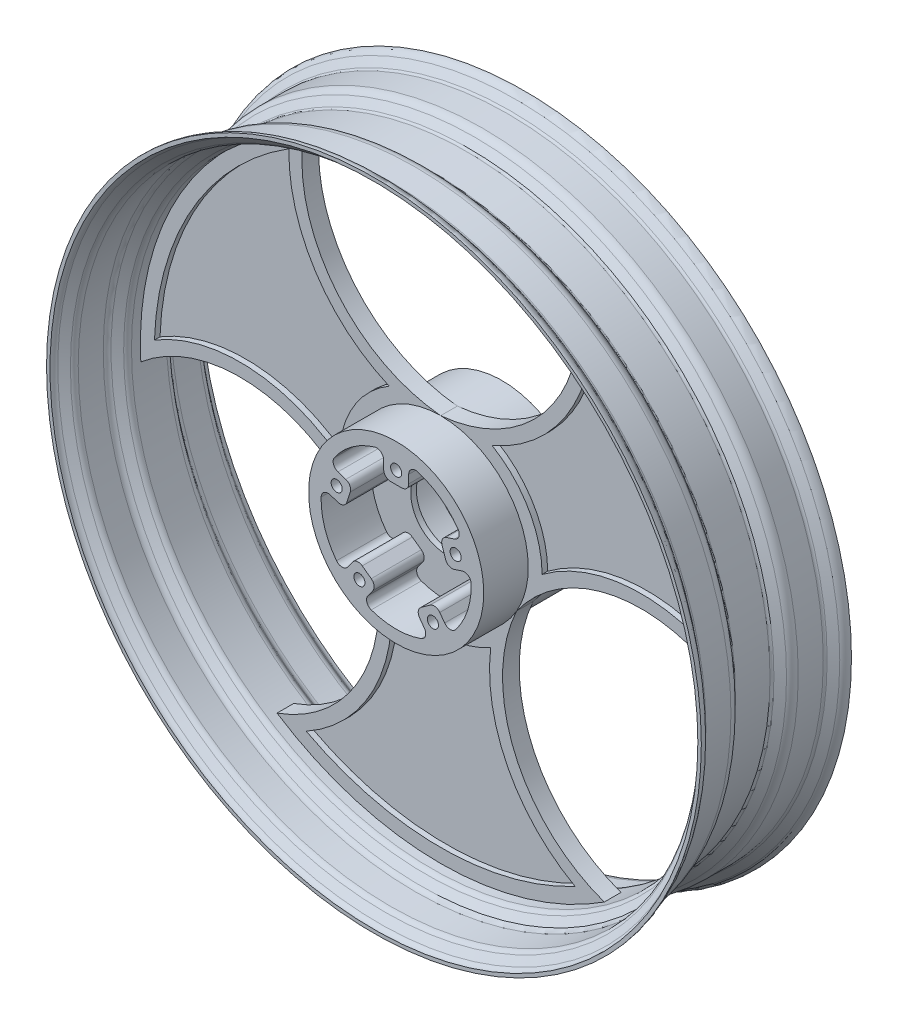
ISO-10303-21;
HEADER;
FILE_DESCRIPTION(('STEP AP214'),'2;1');
FILE_NAME('part.step','',(''),(''),'','','');
FILE_SCHEMA(('AUTOMOTIVE_DESIGN { 1 0 10303 214 1 1 1 1 }'));
ENDSEC;
DATA;
#1=APPLICATION_CONTEXT('core data for automotive mechanical design processes');
#2=APPLICATION_PROTOCOL_DEFINITION('international standard','automotive_design',2000,#1);
#3=PRODUCT_CONTEXT('',#1,'mechanical');
#4=PRODUCT('Part','Part','',(#3));
#5=PRODUCT_RELATED_PRODUCT_CATEGORY('part','',(#4));
#6=PRODUCT_DEFINITION_FORMATION('','',#4);
#7=PRODUCT_DEFINITION_CONTEXT('part definition',#1,'design');
#8=PRODUCT_DEFINITION('design','',#6,#7);
#9=PRODUCT_DEFINITION_SHAPE('','',#8);
#10=(LENGTH_UNIT() NAMED_UNIT(*) SI_UNIT(.MILLI.,.METRE.));
#11=(NAMED_UNIT(*) PLANE_ANGLE_UNIT() SI_UNIT($,.RADIAN.));
#12=(NAMED_UNIT(*) SI_UNIT($,.STERADIAN.) SOLID_ANGLE_UNIT());
#13=UNCERTAINTY_MEASURE_WITH_UNIT(LENGTH_MEASURE(1.E-05),#10,'distance_accuracy_value','');
#14=(GEOMETRIC_REPRESENTATION_CONTEXT(3) GLOBAL_UNCERTAINTY_ASSIGNED_CONTEXT((#13)) GLOBAL_UNIT_ASSIGNED_CONTEXT((#10,
#11,#12)) REPRESENTATION_CONTEXT('',''));
#15=CARTESIAN_POINT('',(0.,0.,0.));
#16=DIRECTION('',(0.,0.,1.));
#17=DIRECTION('',(1.,0.,0.));
#18=AXIS2_PLACEMENT_3D('',#15,#16,#17);
#19=CARTESIAN_POINT('',(0.,0.,-150.735064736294));
#20=DIRECTION('',(0.,0.,1.));
#21=DIRECTION('',(1.,0.,0.));
#22=AXIS2_PLACEMENT_3D('',#19,#20,#21);
#23=CYLINDRICAL_SURFACE('',#22,54.);
#24=CARTESIAN_POINT('',(0.,0.,2.00000000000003));
#25=DIRECTION('',(0.,0.,-1.));
#26=DIRECTION('',(-1.,0.,0.));
#27=AXIS2_PLACEMENT_3D('',#24,#25,#26);
#28=CIRCLE('',#27,54.);
#29=CARTESIAN_POINT('',(-53.9839161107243,1.31787759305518,2.00000000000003));
#30=VERTEX_POINT('',#29);
#31=CARTESIAN_POINT('',(-42.8992765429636,-32.7971351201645,2.00000000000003));
#32=VERTEX_POINT('',#31);
#33=EDGE_CURVE('E1193',#30,#32,#28,.F.);
#34=ORIENTED_EDGE('',*,*,#33,.F.);
#35=DIRECTION('',(0.,0.,1.));
#36=VECTOR('',#35,1.);
#37=CARTESIAN_POINT('',(-53.9839161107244,1.31787759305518,-150.735064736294));
#38=LINE('',#37,#36);
#39=CARTESIAN_POINT('',(-53.9839161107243,1.31787759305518,38.));
#40=VERTEX_POINT('',#39);
#41=EDGE_CURVE('E879',#30,#40,#38,.T.);
#42=ORIENTED_EDGE('',*,*,#41,.T.);
#43=CARTESIAN_POINT('',(0.,0.,38.));
#44=DIRECTION('',(0.,0.,1.));
#45=DIRECTION('',(1.,0.,0.));
#46=AXIS2_PLACEMENT_3D('',#43,#44,#45);
#47=CIRCLE('',#46,54.);
#48=CARTESIAN_POINT('',(-42.8992765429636,-32.7971351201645,38.));
#49=VERTEX_POINT('',#48);
#50=EDGE_CURVE('E1063',#40,#49,#47,.T.);
#51=ORIENTED_EDGE('',*,*,#50,.T.);
#52=DIRECTION('',(0.,0.,1.));
#53=VECTOR('',#52,1.);
#54=CARTESIAN_POINT('',(-42.8992765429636,-32.7971351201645,-150.735064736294));
#55=LINE('',#54,#53);
#56=EDGE_CURVE('E871',#49,#32,#55,.F.);
#57=ORIENTED_EDGE('',*,*,#56,.T.);
#58=EDGE_LOOP('',(#34,#42,#51,#57));
#59=FACE_BOUND('',#58,.T.);
#60=ADVANCED_FACE('F36',(#59),#23,.F.);
#61=CARTESIAN_POINT('',(-17.9353235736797,-50.9345086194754,38.));
#62=VERTEX_POINT('',#61);
#63=CARTESIAN_POINT('',(17.935323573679,-50.9345086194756,38.));
#64=VERTEX_POINT('',#63);
#65=EDGE_CURVE('E1171',#62,#64,#47,.T.);
#66=ORIENTED_EDGE('',*,*,#65,.T.);
#67=DIRECTION('',(0.,0.,1.));
#68=VECTOR('',#67,1.);
#69=CARTESIAN_POINT('',(17.935323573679,-50.9345086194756,-150.735064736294));
#70=LINE('',#69,#68);
#71=CARTESIAN_POINT('',(17.935323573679,-50.9345086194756,2.00000000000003));
#72=VERTEX_POINT('',#71);
#73=EDGE_CURVE('E915',#64,#72,#70,.F.);
#74=ORIENTED_EDGE('',*,*,#73,.T.);
#75=CARTESIAN_POINT('',(-17.9353235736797,-50.9345086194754,2.00000000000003));
#76=VERTEX_POINT('',#75);
#77=EDGE_CURVE('E1221',#76,#72,#28,.F.);
#78=ORIENTED_EDGE('',*,*,#77,.F.);
#79=DIRECTION('',(0.,0.,1.));
#80=VECTOR('',#79,1.);
#81=CARTESIAN_POINT('',(-17.9353235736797,-50.9345086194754,-150.735064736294));
#82=LINE('',#81,#80);
#83=EDGE_CURVE('E912',#76,#62,#82,.T.);
#84=ORIENTED_EDGE('',*,*,#83,.T.);
#85=EDGE_LOOP('',(#66,#74,#78,#84));
#86=FACE_BOUND('',#85,.T.);
#87=ADVANCED_FACE('F1223',(#86),#23,.F.);
#88=CARTESIAN_POINT('',(42.8992765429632,-32.7971351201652,2.00000000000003));
#89=VERTEX_POINT('',#88);
#90=CARTESIAN_POINT('',(53.9839161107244,1.31787759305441,2.00000000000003));
#91=VERTEX_POINT('',#90);
#92=EDGE_CURVE('E1224',#89,#91,#28,.F.);
#93=ORIENTED_EDGE('',*,*,#92,.F.);
#94=DIRECTION('',(0.,0.,1.));
#95=VECTOR('',#94,1.);
#96=CARTESIAN_POINT('',(42.8992765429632,-32.7971351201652,-150.735064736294));
#97=LINE('',#96,#95);
#98=CARTESIAN_POINT('',(42.8992765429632,-32.7971351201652,38.));
#99=VERTEX_POINT('',#98);
#100=EDGE_CURVE('E934',#89,#99,#97,.T.);
#101=ORIENTED_EDGE('',*,*,#100,.T.);
#102=CARTESIAN_POINT('',(53.9839161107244,1.31787759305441,38.));
#103=VERTEX_POINT('',#102);
#104=EDGE_CURVE('E1064',#99,#103,#47,.T.);
#105=ORIENTED_EDGE('',*,*,#104,.T.);
#106=DIRECTION('',(0.,0.,1.));
#107=VECTOR('',#106,1.);
#108=CARTESIAN_POINT('',(53.9839161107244,1.31787759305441,-150.735064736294));
#109=LINE('',#108,#107);
#110=EDGE_CURVE('E932',#103,#91,#109,.F.);
#111=ORIENTED_EDGE('',*,*,#110,.T.);
#112=EDGE_LOOP('',(#93,#101,#105,#111));
#113=FACE_BOUND('',#112,.T.);
#114=ADVANCED_FACE('F1277',(#113),#23,.F.);
#115=CARTESIAN_POINT('',(44.4485345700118,30.6647643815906,38.));
#116=VERTEX_POINT('',#115);
#117=CARTESIAN_POINT('',(15.4285714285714,51.7490017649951,38.));
#118=VERTEX_POINT('',#117);
#119=EDGE_CURVE('E1167',#116,#118,#47,.T.);
#120=ORIENTED_EDGE('',*,*,#119,.T.);
#121=DIRECTION('',(0.,0.,1.));
#122=VECTOR('',#121,1.);
#123=CARTESIAN_POINT('',(15.4285714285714,51.7490017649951,-150.735064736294));
#124=LINE('',#123,#122);
#125=CARTESIAN_POINT('',(15.4285714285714,51.7490017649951,2.00000000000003));
#126=VERTEX_POINT('',#125);
#127=EDGE_CURVE('E925',#118,#126,#124,.F.);
#128=ORIENTED_EDGE('',*,*,#127,.T.);
#129=CARTESIAN_POINT('',(44.4485345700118,30.6647643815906,2.00000000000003));
#130=VERTEX_POINT('',#129);
#131=EDGE_CURVE('E1062',#130,#126,#28,.F.);
#132=ORIENTED_EDGE('',*,*,#131,.F.);
#133=DIRECTION('',(0.,0.,1.));
#134=VECTOR('',#133,1.);
#135=CARTESIAN_POINT('',(44.4485345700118,30.6647643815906,-150.735064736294));
#136=LINE('',#135,#134);
#137=EDGE_CURVE('E922',#130,#116,#136,.T.);
#138=ORIENTED_EDGE('',*,*,#137,.T.);
#139=EDGE_LOOP('',(#120,#128,#132,#138));
#140=FACE_BOUND('',#139,.T.);
#141=ADVANCED_FACE('F1282',(#140),#23,.F.);
#142=CARTESIAN_POINT('',(0.,63.,6.00000000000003));
#143=DIRECTION('',(0.,0.,-1.));
#144=DIRECTION('',(-1.,0.,0.));
#145=AXIS2_PLACEMENT_3D('',#142,#143,#144);
#146=PLANE('',#145);
#147=CARTESIAN_POINT('',(0.,0.,6.00000000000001));
#148=DIRECTION('',(0.,0.,1.));
#149=DIRECTION('',(1.,0.,0.));
#150=AXIS2_PLACEMENT_3D('',#147,#148,#149);
#151=CIRCLE('',#150,63.);
#152=CARTESIAN_POINT('',(54.5596004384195,-31.5000000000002,6.00000000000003));
#153=VERTEX_POINT('',#152);
#154=CARTESIAN_POINT('',(0.,63.,6.00000000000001));
#155=VERTEX_POINT('',#154);
#156=EDGE_CURVE('E866',#153,#155,#151,.T.);
#157=ORIENTED_EDGE('',*,*,#156,.F.);
#158=CARTESIAN_POINT('',(144.327145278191,-95.0750571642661,6.00000000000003));
#159=DIRECTION('',(0.,0.,1.));
#160=DIRECTION('',(0.500000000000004,0.866025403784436,0.));
#161=AXIS2_PLACEMENT_3D('',#158,#159,#160);
#162=CIRCLE('',#161,110.);
#163=CARTESIAN_POINT('',(215.700329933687,-11.3739907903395,6.00000000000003));
#164=VERTEX_POINT('',#163);
#165=EDGE_CURVE('E698',#164,#153,#162,.T.);
#166=ORIENTED_EDGE('',*,*,#165,.F.);
#167=CARTESIAN_POINT('',(0.,0.,6.00000000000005));
#168=DIRECTION('',(0.,0.,1.));
#169=DIRECTION('',(1.,0.,0.));
#170=AXIS2_PLACEMENT_3D('',#167,#168,#169);
#171=CIRCLE('',#170,216.);
#172=CARTESIAN_POINT('',(98.,192.488960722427,6.00000000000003));
#173=VERTEX_POINT('',#172);
#174=EDGE_CURVE('E862',#164,#173,#171,.T.);
#175=ORIENTED_EDGE('',*,*,#174,.T.);
#176=CARTESIAN_POINT('',(-10.173842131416,172.528502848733,6.00000000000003));
#177=DIRECTION('',(0.,0.,1.));
#178=DIRECTION('',(1.,0.,0.));
#179=AXIS2_PLACEMENT_3D('',#176,#177,#178);
#180=CIRCLE('',#179,110.);
#181=EDGE_CURVE('E736',#155,#173,#180,.T.);
#182=ORIENTED_EDGE('',*,*,#181,.F.);
#183=EDGE_LOOP('',(#157,#166,#175,#182));
#184=FACE_BOUND('',#183,.T.);
#185=CARTESIAN_POINT('',(0.,0.,6.00000000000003));
#186=DIRECTION('',(0.,0.,-1.));
#187=DIRECTION('',(0.500000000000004,0.866025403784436,0.));
#188=AXIS2_PLACEMENT_3D('',#185,#186,#187);
#189=CIRCLE('',#188,73.);
#190=CARTESIAN_POINT('',(37.0382810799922,62.9060071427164,6.00000000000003));
#191=VERTEX_POINT('',#190);
#192=CARTESIAN_POINT('',(72.997340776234,0.623088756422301,6.00000000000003));
#193=VERTEX_POINT('',#192);
#194=EDGE_CURVE('E615',#191,#193,#189,.T.);
#195=ORIENTED_EDGE('',*,*,#194,.F.);
#196=CARTESIAN_POINT('',(-10.1738421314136,172.528502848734,6.00000000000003));
#197=DIRECTION('',(0.,0.,-1.));
#198=DIRECTION('',(0.500000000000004,0.866025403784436,0.));
#199=AXIS2_PLACEMENT_3D('',#196,#197,#198);
#200=CIRCLE('',#199,119.356927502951);
#201=CARTESIAN_POINT('',(109.163368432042,174.697907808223,6.00000000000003));
#202=VERTEX_POINT('',#201);
#203=EDGE_CURVE('E613',#202,#191,#200,.T.);
#204=ORIENTED_EDGE('',*,*,#203,.F.);
#205=CARTESIAN_POINT('',(0.,0.,6.00000000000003));
#206=DIRECTION('',(0.,0.,1.));
#207=DIRECTION('',(0.500000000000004,0.866025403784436,0.));
#208=AXIS2_PLACEMENT_3D('',#205,#206,#207);
#209=CIRCLE('',#208,206.);
#210=CARTESIAN_POINT('',(205.874510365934,7.18929632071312,6.00000000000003));
#211=VERTEX_POINT('',#210);
#212=EDGE_CURVE('E603',#211,#202,#209,.T.);
#213=ORIENTED_EDGE('',*,*,#212,.F.);
#214=CARTESIAN_POINT('',(144.327145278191,-95.0750571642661,6.00000000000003));
#215=DIRECTION('',(0.,0.,-1.));
#216=DIRECTION('',(-0.500000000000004,-0.866025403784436,0.));
#217=AXIS2_PLACEMENT_3D('',#214,#215,#216);
#218=CIRCLE('',#217,119.356927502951);
#219=EDGE_CURVE('E619',#193,#211,#218,.T.);
#220=ORIENTED_EDGE('',*,*,#219,.F.);
#221=EDGE_LOOP('',(#195,#204,#213,#220));
#222=FACE_BOUND('',#221,.T.);
#223=ADVANCED_FACE('F1291',(#184,#222),#146,.F.);
#224=CARTESIAN_POINT('',(-117.700329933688,-181.114969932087,6.00000000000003));
#225=VERTEX_POINT('',#224);
#226=CARTESIAN_POINT('',(117.700329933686,-181.114969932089,6.00000000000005));
#227=VERTEX_POINT('',#226);
#228=EDGE_CURVE('E867',#225,#227,#171,.T.);
#229=ORIENTED_EDGE('',*,*,#228,.T.);
#230=CARTESIAN_POINT('',(154.500987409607,-77.4534456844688,6.00000000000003));
#231=DIRECTION('',(0.,0.,1.));
#232=DIRECTION('',(-0.500000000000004,-0.866025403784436,0.));
#233=AXIS2_PLACEMENT_3D('',#230,#231,#232);
#234=CIRCLE('',#233,110.);
#235=EDGE_CURVE('E702',#153,#227,#234,.T.);
#236=ORIENTED_EDGE('',*,*,#235,.F.);
#237=CARTESIAN_POINT('',(-54.5596004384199,-31.4999999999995,6.00000000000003));
#238=VERTEX_POINT('',#237);
#239=EDGE_CURVE('E872',#238,#153,#151,.T.);
#240=ORIENTED_EDGE('',*,*,#239,.F.);
#241=CARTESIAN_POINT('',(-154.500987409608,-77.4534456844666,6.00000000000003));
#242=DIRECTION('',(0.,0.,1.));
#243=DIRECTION('',(0.499999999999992,-0.866025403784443,0.));
#244=AXIS2_PLACEMENT_3D('',#241,#242,#243);
#245=CIRCLE('',#244,110.);
#246=EDGE_CURVE('E717',#225,#238,#245,.T.);
#247=ORIENTED_EDGE('',*,*,#246,.F.);
#248=EDGE_LOOP('',(#229,#236,#240,#247));
#249=FACE_BOUND('',#248,.T.);
#250=CARTESIAN_POINT('',(0.,0.,6.00000000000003));
#251=DIRECTION('',(0.,0.,-1.));
#252=DIRECTION('',(0.499999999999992,-0.866025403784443,0.));
#253=AXIS2_PLACEMENT_3D('',#250,#251,#252);
#254=CIRCLE('',#253,73.);
#255=CARTESIAN_POINT('',(35.9590596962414,-63.5290958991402,6.00000000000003));
#256=VERTEX_POINT('',#255);
#257=CARTESIAN_POINT('',(-35.9590596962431,-63.5290958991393,6.00000000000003));
#258=VERTEX_POINT('',#257);
#259=EDGE_CURVE('E648',#256,#258,#254,.T.);
#260=ORIENTED_EDGE('',*,*,#259,.F.);
#261=CARTESIAN_POINT('',(154.500987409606,-77.4534456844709,6.00000000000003));
#262=DIRECTION('',(0.,0.,-1.));
#263=DIRECTION('',(0.499999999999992,-0.866025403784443,0.));
#264=AXIS2_PLACEMENT_3D('',#261,#262,#263);
#265=CIRCLE('',#264,119.356927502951);
#266=CARTESIAN_POINT('',(96.7111419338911,-181.88720412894,6.00000000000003));
#267=VERTEX_POINT('',#266);
#268=EDGE_CURVE('E592',#267,#256,#265,.T.);
#269=ORIENTED_EDGE('',*,*,#268,.F.);
#270=CARTESIAN_POINT('',(0.,0.,6.00000000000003));
#271=DIRECTION('',(0.,0.,1.));
#272=DIRECTION('',(0.499999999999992,-0.866025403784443,0.));
#273=AXIS2_PLACEMENT_3D('',#270,#271,#272);
#274=CIRCLE('',#273,206.);
#275=CARTESIAN_POINT('',(-96.7111419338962,-181.887204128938,6.00000000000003));
#276=VERTEX_POINT('',#275);
#277=EDGE_CURVE('E637',#276,#267,#274,.T.);
#278=ORIENTED_EDGE('',*,*,#277,.F.);
#279=CARTESIAN_POINT('',(-154.500987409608,-77.4534456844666,6.00000000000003));
#280=DIRECTION('',(0.,0.,-1.));
#281=DIRECTION('',(-0.499999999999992,0.866025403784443,0.));
#282=AXIS2_PLACEMENT_3D('',#279,#280,#281);
#283=CIRCLE('',#282,119.356927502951);
#284=EDGE_CURVE('E651',#258,#276,#283,.T.);
#285=ORIENTED_EDGE('',*,*,#284,.F.);
#286=EDGE_LOOP('',(#260,#269,#278,#285));
#287=FACE_BOUND('',#286,.T.);
#288=ADVANCED_FACE('F1296',(#249,#287),#146,.F.);
#289=CARTESIAN_POINT('',(-98.,192.488960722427,6.00000000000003));
#290=VERTEX_POINT('',#289);
#291=CARTESIAN_POINT('',(-215.700329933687,-11.3739907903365,6.00000000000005));
#292=VERTEX_POINT('',#291);
#293=EDGE_CURVE('E863',#290,#292,#171,.T.);
#294=ORIENTED_EDGE('',*,*,#293,.T.);
#295=CARTESIAN_POINT('',(-144.327145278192,-95.0750571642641,6.00000000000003));
#296=DIRECTION('',(0.,0.,1.));
#297=DIRECTION('',(-0.499999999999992,0.866025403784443,0.));
#298=AXIS2_PLACEMENT_3D('',#295,#296,#297);
#299=CIRCLE('',#298,110.);
#300=EDGE_CURVE('E720',#238,#292,#299,.T.);
#301=ORIENTED_EDGE('',*,*,#300,.F.);
#302=EDGE_CURVE('E868',#155,#238,#151,.T.);
#303=ORIENTED_EDGE('',*,*,#302,.F.);
#304=CARTESIAN_POINT('',(10.173842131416,172.528502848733,6.00000000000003));
#305=DIRECTION('',(0.,0.,1.));
#306=DIRECTION('',(-1.,0.,0.));
#307=AXIS2_PLACEMENT_3D('',#304,#305,#306);
#308=CIRCLE('',#307,110.);
#309=EDGE_CURVE('E733',#290,#155,#308,.T.);
#310=ORIENTED_EDGE('',*,*,#309,.F.);
#311=EDGE_LOOP('',(#294,#301,#303,#310));
#312=FACE_BOUND('',#311,.T.);
#313=CARTESIAN_POINT('',(0.,0.,6.00000000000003));
#314=DIRECTION('',(0.,0.,-1.));
#315=DIRECTION('',(-1.,0.,0.));
#316=AXIS2_PLACEMENT_3D('',#313,#314,#315);
#317=CIRCLE('',#316,73.);
#318=CARTESIAN_POINT('',(-72.9973407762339,0.623088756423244,6.00000000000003));
#319=VERTEX_POINT('',#318);
#320=CARTESIAN_POINT('',(-37.0382810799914,62.906007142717,6.00000000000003));
#321=VERTEX_POINT('',#320);
#322=EDGE_CURVE('E678',#319,#321,#317,.T.);
#323=ORIENTED_EDGE('',*,*,#322,.F.);
#324=CARTESIAN_POINT('',(-144.327145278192,-95.0750571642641,6.00000000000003));
#325=DIRECTION('',(0.,0.,-1.));
#326=DIRECTION('',(-1.,0.,0.));
#327=AXIS2_PLACEMENT_3D('',#324,#325,#326);
#328=CIRCLE('',#327,119.356927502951);
#329=CARTESIAN_POINT('',(-205.874510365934,7.18929632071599,6.00000000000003));
#330=VERTEX_POINT('',#329);
#331=EDGE_CURVE('E626',#330,#319,#328,.T.);
#332=ORIENTED_EDGE('',*,*,#331,.F.);
#333=CARTESIAN_POINT('',(0.,0.,6.00000000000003));
#334=DIRECTION('',(0.,0.,1.));
#335=DIRECTION('',(-1.,0.,0.));
#336=AXIS2_PLACEMENT_3D('',#333,#334,#335);
#337=CIRCLE('',#336,206.);
#338=CARTESIAN_POINT('',(-109.163368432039,174.697907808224,6.00000000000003));
#339=VERTEX_POINT('',#338);
#340=EDGE_CURVE('E667',#339,#330,#337,.T.);
#341=ORIENTED_EDGE('',*,*,#340,.F.);
#342=CARTESIAN_POINT('',(10.173842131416,172.528502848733,6.00000000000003));
#343=DIRECTION('',(0.,0.,-1.));
#344=DIRECTION('',(1.,0.,0.));
#345=AXIS2_PLACEMENT_3D('',#342,#343,#344);
#346=CIRCLE('',#345,119.356927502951);
#347=EDGE_CURVE('E681',#321,#339,#346,.T.);
#348=ORIENTED_EDGE('',*,*,#347,.F.);
#349=EDGE_LOOP('',(#323,#332,#341,#348));
#350=FACE_BOUND('',#349,.T.);
#351=ADVANCED_FACE('F1299',(#312,#350),#146,.F.);
#352=CARTESIAN_POINT('',(0.,63.,-6.00000000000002));
#353=DIRECTION('',(0.,0.,1.));
#354=DIRECTION('',(1.,0.,0.));
#355=AXIS2_PLACEMENT_3D('',#352,#353,#354);
#356=PLANE('',#355);
#357=CARTESIAN_POINT('',(-10.1738421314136,172.528502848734,-6.00000000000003));
#358=DIRECTION('',(0.,0.,-1.));
#359=DIRECTION('',(0.500000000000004,0.866025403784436,0.));
#360=AXIS2_PLACEMENT_3D('',#357,#358,#359);
#361=CIRCLE('',#360,119.356927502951);
#362=CARTESIAN_POINT('',(109.163368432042,174.697907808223,-6.00000000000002));
#363=VERTEX_POINT('',#362);
#364=CARTESIAN_POINT('',(37.0382810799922,62.9060071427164,-6.00000000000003));
#365=VERTEX_POINT('',#364);
#366=EDGE_CURVE('E511',#363,#365,#361,.T.);
#367=ORIENTED_EDGE('',*,*,#366,.T.);
#368=CARTESIAN_POINT('',(0.,0.,-6.00000000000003));
#369=DIRECTION('',(0.,0.,-1.));
#370=DIRECTION('',(0.500000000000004,0.866025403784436,0.));
#371=AXIS2_PLACEMENT_3D('',#368,#369,#370);
#372=CIRCLE('',#371,73.);
#373=CARTESIAN_POINT('',(72.997340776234,0.623088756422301,-6.00000000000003));
#374=VERTEX_POINT('',#373);
#375=EDGE_CURVE('E515',#365,#374,#372,.T.);
#376=ORIENTED_EDGE('',*,*,#375,.T.);
#377=CARTESIAN_POINT('',(144.327145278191,-95.0750571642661,-6.00000000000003));
#378=DIRECTION('',(0.,0.,-1.));
#379=DIRECTION('',(-0.500000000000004,-0.866025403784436,0.));
#380=AXIS2_PLACEMENT_3D('',#377,#378,#379);
#381=CIRCLE('',#380,119.356927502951);
#382=CARTESIAN_POINT('',(205.874510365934,7.18929632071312,-6.00000000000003));
#383=VERTEX_POINT('',#382);
#384=EDGE_CURVE('E518',#374,#383,#381,.T.);
#385=ORIENTED_EDGE('',*,*,#384,.T.);
#386=CARTESIAN_POINT('',(0.,0.,-6.00000000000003));
#387=DIRECTION('',(0.,0.,1.));
#388=DIRECTION('',(0.500000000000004,0.866025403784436,0.));
#389=AXIS2_PLACEMENT_3D('',#386,#387,#388);
#390=CIRCLE('',#389,206.);
#391=EDGE_CURVE('E527',#383,#363,#390,.T.);
#392=ORIENTED_EDGE('',*,*,#391,.T.);
#393=EDGE_LOOP('',(#367,#376,#385,#392));
#394=FACE_BOUND('',#393,.T.);
#395=CARTESIAN_POINT('',(0.,0.,-6.00000000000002));
#396=DIRECTION('',(0.,0.,1.));
#397=DIRECTION('',(1.,0.,0.));
#398=AXIS2_PLACEMENT_3D('',#395,#396,#397);
#399=CIRCLE('',#398,216.);
#400=CARTESIAN_POINT('',(215.700329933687,-11.3739907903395,-6.00000000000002));
#401=VERTEX_POINT('',#400);
#402=CARTESIAN_POINT('',(98.,192.488960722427,-6.00000000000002));
#403=VERTEX_POINT('',#402);
#404=EDGE_CURVE('E760',#401,#403,#399,.T.);
#405=ORIENTED_EDGE('',*,*,#404,.F.);
#406=CARTESIAN_POINT('',(144.327145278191,-95.0750571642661,-6.00000000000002));
#407=DIRECTION('',(0.,0.,1.));
#408=DIRECTION('',(1.,0.,0.));
#409=AXIS2_PLACEMENT_3D('',#406,#407,#408);
#410=CIRCLE('',#409,110.);
#411=CARTESIAN_POINT('',(54.5596004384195,-31.5000000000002,-6.00000000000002));
#412=VERTEX_POINT('',#411);
#413=EDGE_CURVE('E695',#412,#401,#410,.F.);
#414=ORIENTED_EDGE('',*,*,#413,.F.);
#415=CARTESIAN_POINT('',(0.,0.,-6.00000000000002));
#416=DIRECTION('',(0.,0.,1.));
#417=DIRECTION('',(1.,0.,0.));
#418=AXIS2_PLACEMENT_3D('',#415,#416,#417);
#419=CIRCLE('',#418,63.);
#420=CARTESIAN_POINT('',(0.,63.,-6.00000000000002));
#421=VERTEX_POINT('',#420);
#422=EDGE_CURVE('E756',#412,#421,#419,.T.);
#423=ORIENTED_EDGE('',*,*,#422,.T.);
#424=CARTESIAN_POINT('',(-10.173842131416,172.528502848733,-6.00000000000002));
#425=DIRECTION('',(0.,0.,1.));
#426=DIRECTION('',(1.,0.,0.));
#427=AXIS2_PLACEMENT_3D('',#424,#425,#426);
#428=CIRCLE('',#427,110.);
#429=EDGE_CURVE('E742',#403,#421,#428,.F.);
#430=ORIENTED_EDGE('',*,*,#429,.F.);
#431=EDGE_LOOP('',(#405,#414,#423,#430));
#432=FACE_BOUND('',#431,.T.);
#433=ADVANCED_FACE('F1445',(#394,#432),#356,.F.);
#434=CARTESIAN_POINT('',(154.500987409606,-77.4534456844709,-6.00000000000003));
#435=DIRECTION('',(0.,0.,-1.));
#436=DIRECTION('',(0.499999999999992,-0.866025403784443,0.));
#437=AXIS2_PLACEMENT_3D('',#434,#435,#436);
#438=CIRCLE('',#437,119.356927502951);
#439=CARTESIAN_POINT('',(96.7111419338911,-181.88720412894,-6.00000000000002));
#440=VERTEX_POINT('',#439);
#441=CARTESIAN_POINT('',(35.9590596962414,-63.5290958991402,-6.00000000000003));
#442=VERTEX_POINT('',#441);
#443=EDGE_CURVE('E549',#440,#442,#438,.T.);
#444=ORIENTED_EDGE('',*,*,#443,.T.);
#445=CARTESIAN_POINT('',(0.,0.,-6.00000000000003));
#446=DIRECTION('',(0.,0.,-1.));
#447=DIRECTION('',(0.499999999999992,-0.866025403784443,0.));
#448=AXIS2_PLACEMENT_3D('',#445,#446,#447);
#449=CIRCLE('',#448,73.);
#450=CARTESIAN_POINT('',(-35.9590596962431,-63.5290958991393,-6.00000000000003));
#451=VERTEX_POINT('',#450);
#452=EDGE_CURVE('E542',#442,#451,#449,.T.);
#453=ORIENTED_EDGE('',*,*,#452,.T.);
#454=CARTESIAN_POINT('',(-154.500987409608,-77.4534456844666,-6.00000000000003));
#455=DIRECTION('',(0.,0.,-1.));
#456=DIRECTION('',(-0.499999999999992,0.866025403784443,0.));
#457=AXIS2_PLACEMENT_3D('',#454,#455,#456);
#458=CIRCLE('',#457,119.356927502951);
#459=CARTESIAN_POINT('',(-96.7111419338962,-181.887204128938,-6.00000000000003));
#460=VERTEX_POINT('',#459);
#461=EDGE_CURVE('E555',#451,#460,#458,.T.);
#462=ORIENTED_EDGE('',*,*,#461,.T.);
#463=CARTESIAN_POINT('',(0.,0.,-6.00000000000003));
#464=DIRECTION('',(0.,0.,1.));
#465=DIRECTION('',(0.499999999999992,-0.866025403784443,0.));
#466=AXIS2_PLACEMENT_3D('',#463,#464,#465);
#467=CIRCLE('',#466,206.);
#468=EDGE_CURVE('E552',#460,#440,#467,.T.);
#469=ORIENTED_EDGE('',*,*,#468,.T.);
#470=EDGE_LOOP('',(#444,#453,#462,#469));
#471=FACE_BOUND('',#470,.T.);
#472=CARTESIAN_POINT('',(-54.5596004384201,-31.4999999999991,-6.00000000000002));
#473=VERTEX_POINT('',#472);
#474=EDGE_CURVE('E761',#473,#412,#419,.T.);
#475=ORIENTED_EDGE('',*,*,#474,.T.);
#476=CARTESIAN_POINT('',(154.500987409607,-77.4534456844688,-6.00000000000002));
#477=DIRECTION('',(0.,0.,1.));
#478=DIRECTION('',(1.,0.,0.));
#479=AXIS2_PLACEMENT_3D('',#476,#477,#478);
#480=CIRCLE('',#479,110.);
#481=CARTESIAN_POINT('',(117.700329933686,-181.114969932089,-6.00000000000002));
#482=VERTEX_POINT('',#481);
#483=EDGE_CURVE('E707',#482,#412,#480,.F.);
#484=ORIENTED_EDGE('',*,*,#483,.F.);
#485=CARTESIAN_POINT('',(-117.700329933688,-181.114969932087,-6.00000000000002));
#486=VERTEX_POINT('',#485);
#487=EDGE_CURVE('E766',#486,#482,#399,.T.);
#488=ORIENTED_EDGE('',*,*,#487,.F.);
#489=CARTESIAN_POINT('',(-154.500987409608,-77.4534456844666,-6.00000000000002));
#490=DIRECTION('',(0.,0.,1.));
#491=DIRECTION('',(1.,0.,0.));
#492=AXIS2_PLACEMENT_3D('',#489,#490,#491);
#493=CIRCLE('',#492,110.);
#494=EDGE_CURVE('E688',#473,#486,#493,.F.);
#495=ORIENTED_EDGE('',*,*,#494,.F.);
#496=EDGE_LOOP('',(#475,#484,#488,#495));
#497=FACE_BOUND('',#496,.T.);
#498=ADVANCED_FACE('F1446',(#471,#497),#356,.F.);
#499=CARTESIAN_POINT('',(0.,0.,108.105691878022));
#500=DIRECTION('',(0.,0.,1.));
#501=DIRECTION('',(1.,0.,0.));
#502=AXIS2_PLACEMENT_3D('',#499,#500,#501);
#503=CYLINDRICAL_SURFACE('',#502,63.);
#504=CARTESIAN_POINT('',(0.,0.,38.));
#505=DIRECTION('',(0.,0.,1.));
#506=DIRECTION('',(1.,0.,0.));
#507=AXIS2_PLACEMENT_3D('',#504,#505,#506);
#508=CIRCLE('',#507,63.);
#509=CARTESIAN_POINT('',(63.,0.,38.));
#510=VERTEX_POINT('',#509);
#511=EDGE_CURVE('E750',#510,#510,#508,.T.);
#512=ORIENTED_EDGE('',*,*,#511,.F.);
#513=EDGE_LOOP('',(#512));
#514=FACE_BOUND('',#513,.T.);
#515=ORIENTED_EDGE('',*,*,#302,.T.);
#516=ORIENTED_EDGE('',*,*,#239,.T.);
#517=ORIENTED_EDGE('',*,*,#156,.T.);
#518=EDGE_LOOP('',(#515,#516,#517));
#519=FACE_BOUND('',#518,.T.);
#520=ADVANCED_FACE('F1575',(#514,#519),#503,.T.);
#521=CARTESIAN_POINT('',(0.,0.,12.4091531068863));
#522=DIRECTION('',(0.,0.,1.));
#523=DIRECTION('',(1.,0.,0.));
#524=AXIS2_PLACEMENT_3D('',#521,#522,#523);
#525=TOROIDAL_SURFACE('',#524,221.,5.00000000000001);
#526=CARTESIAN_POINT('',(0.,0.,12.4091531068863));
#527=DIRECTION('',(0.,0.,1.));
#528=DIRECTION('',(1.,0.,0.));
#529=AXIS2_PLACEMENT_3D('',#526,#527,#528);
#530=CIRCLE('',#529,216.);
#531=CARTESIAN_POINT('',(216.,0.,12.4091531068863));
#532=VERTEX_POINT('',#531);
#533=EDGE_CURVE('E859',#532,#532,#530,.T.);
#534=ORIENTED_EDGE('',*,*,#533,.F.);
#535=EDGE_LOOP('',(#534));
#536=FACE_BOUND('',#535,.T.);
#537=CARTESIAN_POINT('',(0.,0.,16.2393753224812));
#538=DIRECTION('',(0.,0.,1.));
#539=DIRECTION('',(1.,0.,0.));
#540=AXIS2_PLACEMENT_3D('',#537,#538,#539);
#541=CIRCLE('',#540,217.786061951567);
#542=CARTESIAN_POINT('',(217.786061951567,0.,16.2393753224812));
#543=VERTEX_POINT('',#542);
#544=EDGE_CURVE('E856',#543,#543,#541,.T.);
#545=ORIENTED_EDGE('',*,*,#544,.T.);
#546=EDGE_LOOP('',(#545));
#547=FACE_BOUND('',#546,.T.);
#548=ADVANCED_FACE('F1572',(#536,#547),#525,.T.);
#549=CARTESIAN_POINT('',(0.,0.,20.3743543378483));
#550=DIRECTION('',(0.,0.,1.));
#551=DIRECTION('',(1.,0.,0.));
#552=AXIS2_PLACEMENT_3D('',#549,#550,#551);
#553=CONICAL_SURFACE('',#552,222.713938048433,0.872664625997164);
#554=ORIENTED_EDGE('',*,*,#544,.F.);
#555=EDGE_LOOP('',(#554));
#556=FACE_BOUND('',#555,.T.);
#557=CARTESIAN_POINT('',(0.,0.,20.3743543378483));
#558=DIRECTION('',(0.,0.,1.));
#559=DIRECTION('',(1.,0.,0.));
#560=AXIS2_PLACEMENT_3D('',#557,#558,#559);
#561=CIRCLE('',#560,222.713938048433);
#562=CARTESIAN_POINT('',(222.713938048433,0.,20.3743543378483));
#563=VERTEX_POINT('',#562);
#564=EDGE_CURVE('E853',#563,#563,#561,.T.);
#565=ORIENTED_EDGE('',*,*,#564,.T.);
#566=EDGE_LOOP('',(#565));
#567=FACE_BOUND('',#566,.T.);
#568=ADVANCED_FACE('F1568',(#556,#567),#553,.F.);
#569=CARTESIAN_POINT('',(0.,0.,24.2045765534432));
#570=DIRECTION('',(0.,0.,1.));
#571=DIRECTION('',(1.,0.,0.));
#572=AXIS2_PLACEMENT_3D('',#569,#570,#571);
#573=TOROIDAL_SURFACE('',#572,219.5,4.99999999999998);
#574=ORIENTED_EDGE('',*,*,#564,.F.);
#575=EDGE_LOOP('',(#574));
#576=FACE_BOUND('',#575,.T.);
#577=CARTESIAN_POINT('',(0.,0.,24.2045765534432));
#578=DIRECTION('',(0.,0.,1.));
#579=DIRECTION('',(1.,0.,0.));
#580=AXIS2_PLACEMENT_3D('',#577,#578,#579);
#581=CIRCLE('',#580,224.5);
#582=CARTESIAN_POINT('',(224.5,0.,24.2045765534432));
#583=VERTEX_POINT('',#582);
#584=EDGE_CURVE('E850',#583,#583,#581,.T.);
#585=ORIENTED_EDGE('',*,*,#584,.T.);
#586=EDGE_LOOP('',(#585));
#587=FACE_BOUND('',#586,.T.);
#588=ADVANCED_FACE('F1564',(#576,#587),#573,.F.);
#589=CARTESIAN_POINT('',(0.,0.,108.105691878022));
#590=DIRECTION('',(0.,0.,1.));
#591=DIRECTION('',(1.,0.,0.));
#592=AXIS2_PLACEMENT_3D('',#589,#590,#591);
#593=CYLINDRICAL_SURFACE('',#592,224.5);
#594=ORIENTED_EDGE('',*,*,#584,.F.);
#595=EDGE_LOOP('',(#594));
#596=FACE_BOUND('',#595,.T.);
#597=CARTESIAN_POINT('',(0.,0.,42.2045765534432));
#598=DIRECTION('',(0.,0.,1.));
#599=DIRECTION('',(1.,0.,0.));
#600=AXIS2_PLACEMENT_3D('',#597,#598,#599);
#601=CIRCLE('',#600,224.5);
#602=CARTESIAN_POINT('',(224.5,0.,42.2045765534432));
#603=VERTEX_POINT('',#602);
#604=EDGE_CURVE('E847',#603,#603,#601,.T.);
#605=ORIENTED_EDGE('',*,*,#604,.T.);
#606=EDGE_LOOP('',(#605));
#607=FACE_BOUND('',#606,.T.);
#608=ADVANCED_FACE('F1560',(#596,#607),#593,.F.);
#609=CARTESIAN_POINT('',(0.,0.,42.2045765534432));
#610=DIRECTION('',(0.,0.,1.));
#611=DIRECTION('',(1.,0.,0.));
#612=AXIS2_PLACEMENT_3D('',#609,#610,#611);
#613=TOROIDAL_SURFACE('',#612,229.5,5.00000000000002);
#614=ORIENTED_EDGE('',*,*,#604,.F.);
#615=EDGE_LOOP('',(#614));
#616=FACE_BOUND('',#615,.T.);
#617=CARTESIAN_POINT('',(0.,0.,46.034798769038));
#618=DIRECTION('',(0.,0.,1.));
#619=DIRECTION('',(1.,0.,0.));
#620=AXIS2_PLACEMENT_3D('',#617,#618,#619);
#621=CIRCLE('',#620,226.286061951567);
#622=CARTESIAN_POINT('',(226.286061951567,0.,46.034798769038));
#623=VERTEX_POINT('',#622);
#624=EDGE_CURVE('E844',#623,#623,#621,.T.);
#625=ORIENTED_EDGE('',*,*,#624,.T.);
#626=EDGE_LOOP('',(#625));
#627=FACE_BOUND('',#626,.T.);
#628=ADVANCED_FACE('F1556',(#616,#627),#613,.T.);
#629=CARTESIAN_POINT('',(0.,0.,50.1697777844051));
#630=DIRECTION('',(0.,0.,1.));
#631=DIRECTION('',(1.,0.,0.));
#632=AXIS2_PLACEMENT_3D('',#629,#630,#631);
#633=CONICAL_SURFACE('',#632,231.213938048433,0.872664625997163);
#634=ORIENTED_EDGE('',*,*,#624,.F.);
#635=EDGE_LOOP('',(#634));
#636=FACE_BOUND('',#635,.T.);
#637=CARTESIAN_POINT('',(0.,0.,50.1697777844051));
#638=DIRECTION('',(0.,0.,1.));
#639=DIRECTION('',(1.,0.,0.));
#640=AXIS2_PLACEMENT_3D('',#637,#638,#639);
#641=CIRCLE('',#640,231.213938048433);
#642=CARTESIAN_POINT('',(231.213938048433,0.,50.1697777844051));
#643=VERTEX_POINT('',#642);
#644=EDGE_CURVE('E841',#643,#643,#641,.T.);
#645=ORIENTED_EDGE('',*,*,#644,.T.);
#646=EDGE_LOOP('',(#645));
#647=FACE_BOUND('',#646,.T.);
#648=ADVANCED_FACE('F1552',(#636,#647),#633,.F.);
#649=CARTESIAN_POINT('',(0.,0.,54.));
#650=DIRECTION('',(0.,0.,1.));
#651=DIRECTION('',(1.,0.,0.));
#652=AXIS2_PLACEMENT_3D('',#649,#650,#651);
#653=TOROIDAL_SURFACE('',#652,228.,4.99999999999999);
#654=ORIENTED_EDGE('',*,*,#644,.F.);
#655=EDGE_LOOP('',(#654));
#656=FACE_BOUND('',#655,.T.);
#657=CARTESIAN_POINT('',(0.,0.,54.));
#658=DIRECTION('',(0.,0.,1.));
#659=DIRECTION('',(1.,0.,0.));
#660=AXIS2_PLACEMENT_3D('',#657,#658,#659);
#661=CIRCLE('',#660,233.);
#662=CARTESIAN_POINT('',(233.,0.,54.));
#663=VERTEX_POINT('',#662);
#664=EDGE_CURVE('E838',#663,#663,#661,.T.);
#665=ORIENTED_EDGE('',*,*,#664,.T.);
#666=EDGE_LOOP('',(#665));
#667=FACE_BOUND('',#666,.T.);
#668=ADVANCED_FACE('F1548',(#656,#667),#653,.F.);
#669=CARTESIAN_POINT('',(0.,233.,54.));
#670=DIRECTION('',(0.,0.,-1.));
#671=DIRECTION('',(-1.,0.,0.));
#672=AXIS2_PLACEMENT_3D('',#669,#670,#671);
#673=PLANE('',#672);
#674=ORIENTED_EDGE('',*,*,#664,.F.);
#675=EDGE_LOOP('',(#674));
#676=FACE_BOUND('',#675,.T.);
#677=CARTESIAN_POINT('',(0.,0.,54.));
#678=DIRECTION('',(0.,0.,1.));
#679=DIRECTION('',(1.,0.,0.));
#680=AXIS2_PLACEMENT_3D('',#677,#678,#679);
#681=CIRCLE('',#680,235.5);
#682=CARTESIAN_POINT('',(235.5,0.,54.));
#683=VERTEX_POINT('',#682);
#684=EDGE_CURVE('E835',#683,#683,#681,.T.);
#685=ORIENTED_EDGE('',*,*,#684,.T.);
#686=EDGE_LOOP('',(#685));
#687=FACE_BOUND('',#686,.T.);
#688=ADVANCED_FACE('F1544',(#676,#687),#673,.F.);
#689=CARTESIAN_POINT('',(0.,0.,54.));
#690=DIRECTION('',(0.,0.,1.));
#691=DIRECTION('',(1.,0.,0.));
#692=AXIS2_PLACEMENT_3D('',#689,#690,#691);
#693=TOROIDAL_SURFACE('',#692,228.,7.49999999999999);
#694=ORIENTED_EDGE('',*,*,#684,.F.);
#695=EDGE_LOOP('',(#694));
#696=FACE_BOUND('',#695,.T.);
#697=CARTESIAN_POINT('',(0.,0.,48.2546666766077));
#698=DIRECTION('',(0.,0.,1.));
#699=DIRECTION('',(1.,0.,0.));
#700=AXIS2_PLACEMENT_3D('',#697,#698,#699);
#701=CIRCLE('',#700,232.820907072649);
#702=CARTESIAN_POINT('',(232.820907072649,0.,48.2546666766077));
#703=VERTEX_POINT('',#702);
#704=EDGE_CURVE('E832',#703,#703,#701,.T.);
#705=ORIENTED_EDGE('',*,*,#704,.T.);
#706=EDGE_LOOP('',(#705));
#707=FACE_BOUND('',#706,.T.);
#708=ADVANCED_FACE('F1540',(#696,#707),#693,.T.);
#709=CARTESIAN_POINT('',(0.,0.,44.1196876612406));
#710=DIRECTION('',(0.,0.,1.));
#711=DIRECTION('',(1.,0.,0.));
#712=AXIS2_PLACEMENT_3D('',#709,#710,#711);
#713=CONICAL_SURFACE('',#712,227.893030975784,0.872664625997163);
#714=ORIENTED_EDGE('',*,*,#704,.F.);
#715=EDGE_LOOP('',(#714));
#716=FACE_BOUND('',#715,.T.);
#717=CARTESIAN_POINT('',(0.,0.,44.1196876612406));
#718=DIRECTION('',(0.,0.,1.));
#719=DIRECTION('',(1.,0.,0.));
#720=AXIS2_PLACEMENT_3D('',#717,#718,#719);
#721=CIRCLE('',#720,227.893030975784);
#722=CARTESIAN_POINT('',(227.893030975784,0.,44.1196876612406));
#723=VERTEX_POINT('',#722);
#724=EDGE_CURVE('E829',#723,#723,#721,.T.);
#725=ORIENTED_EDGE('',*,*,#724,.T.);
#726=EDGE_LOOP('',(#725));
#727=FACE_BOUND('',#726,.T.);
#728=ADVANCED_FACE('F1536',(#716,#727),#713,.T.);
#729=CARTESIAN_POINT('',(0.,0.,42.2045765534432));
#730=DIRECTION('',(0.,0.,1.));
#731=DIRECTION('',(1.,0.,0.));
#732=AXIS2_PLACEMENT_3D('',#729,#730,#731);
#733=TOROIDAL_SURFACE('',#732,229.5,2.5);
#734=ORIENTED_EDGE('',*,*,#724,.F.);
#735=EDGE_LOOP('',(#734));
#736=FACE_BOUND('',#735,.T.);
#737=CARTESIAN_POINT('',(0.,0.,42.2045765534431));
#738=DIRECTION('',(0.,0.,1.));
#739=DIRECTION('',(1.,0.,0.));
#740=AXIS2_PLACEMENT_3D('',#737,#738,#739);
#741=CIRCLE('',#740,227.);
#742=CARTESIAN_POINT('',(227.,0.,42.2045765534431));
#743=VERTEX_POINT('',#742);
#744=EDGE_CURVE('E826',#743,#743,#741,.T.);
#745=ORIENTED_EDGE('',*,*,#744,.T.);
#746=EDGE_LOOP('',(#745));
#747=FACE_BOUND('',#746,.T.);
#748=ADVANCED_FACE('F1532',(#736,#747),#733,.F.);
#749=CARTESIAN_POINT('',(0.,0.,108.105691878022));
#750=DIRECTION('',(0.,0.,1.));
#751=DIRECTION('',(1.,0.,0.));
#752=AXIS2_PLACEMENT_3D('',#749,#750,#751);
#753=CYLINDRICAL_SURFACE('',#752,227.);
#754=ORIENTED_EDGE('',*,*,#744,.F.);
#755=EDGE_LOOP('',(#754));
#756=FACE_BOUND('',#755,.T.);
#757=CARTESIAN_POINT('',(0.,0.,24.2045765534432));
#758=DIRECTION('',(0.,0.,1.));
#759=DIRECTION('',(1.,0.,0.));
#760=AXIS2_PLACEMENT_3D('',#757,#758,#759);
#761=CIRCLE('',#760,227.);
#762=CARTESIAN_POINT('',(227.,0.,24.2045765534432));
#763=VERTEX_POINT('',#762);
#764=EDGE_CURVE('E823',#763,#763,#761,.T.);
#765=ORIENTED_EDGE('',*,*,#764,.T.);
#766=EDGE_LOOP('',(#765));
#767=FACE_BOUND('',#766,.T.);
#768=ADVANCED_FACE('F1528',(#756,#767),#753,.T.);
#769=CARTESIAN_POINT('',(0.,0.,24.2045765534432));
#770=DIRECTION('',(0.,0.,1.));
#771=DIRECTION('',(1.,0.,0.));
#772=AXIS2_PLACEMENT_3D('',#769,#770,#771);
#773=TOROIDAL_SURFACE('',#772,219.5,7.49999999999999);
#774=ORIENTED_EDGE('',*,*,#764,.F.);
#775=EDGE_LOOP('',(#774));
#776=FACE_BOUND('',#775,.T.);
#777=CARTESIAN_POINT('',(0.,0.,18.4592432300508));
#778=DIRECTION('',(0.,0.,1.));
#779=DIRECTION('',(1.,0.,0.));
#780=AXIS2_PLACEMENT_3D('',#777,#778,#779);
#781=CIRCLE('',#780,224.320907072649);
#782=CARTESIAN_POINT('',(224.320907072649,0.,18.4592432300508));
#783=VERTEX_POINT('',#782);
#784=EDGE_CURVE('E820',#783,#783,#781,.T.);
#785=ORIENTED_EDGE('',*,*,#784,.T.);
#786=EDGE_LOOP('',(#785));
#787=FACE_BOUND('',#786,.T.);
#788=ADVANCED_FACE('F1524',(#776,#787),#773,.T.);
#789=CARTESIAN_POINT('',(0.,0.,14.3242642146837));
#790=DIRECTION('',(0.,0.,1.));
#791=DIRECTION('',(1.,0.,0.));
#792=AXIS2_PLACEMENT_3D('',#789,#790,#791);
#793=CONICAL_SURFACE('',#792,219.393030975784,0.872664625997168);
#794=ORIENTED_EDGE('',*,*,#784,.F.);
#795=EDGE_LOOP('',(#794));
#796=FACE_BOUND('',#795,.T.);
#797=CARTESIAN_POINT('',(0.,0.,14.3242642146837));
#798=DIRECTION('',(0.,0.,1.));
#799=DIRECTION('',(1.,0.,0.));
#800=AXIS2_PLACEMENT_3D('',#797,#798,#799);
#801=CIRCLE('',#800,219.393030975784);
#802=CARTESIAN_POINT('',(219.393030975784,0.,14.3242642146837));
#803=VERTEX_POINT('',#802);
#804=EDGE_CURVE('E817',#803,#803,#801,.T.);
#805=ORIENTED_EDGE('',*,*,#804,.T.);
#806=EDGE_LOOP('',(#805));
#807=FACE_BOUND('',#806,.T.);
#808=ADVANCED_FACE('F1520',(#796,#807),#793,.T.);
#809=CARTESIAN_POINT('',(0.,0.,12.4091531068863));
#810=DIRECTION('',(0.,0.,1.));
#811=DIRECTION('',(1.,0.,0.));
#812=AXIS2_PLACEMENT_3D('',#809,#810,#811);
#813=TOROIDAL_SURFACE('',#812,221.,2.50000000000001);
#814=ORIENTED_EDGE('',*,*,#804,.F.);
#815=EDGE_LOOP('',(#814));
#816=FACE_BOUND('',#815,.T.);
#817=CARTESIAN_POINT('',(0.,0.,12.4091531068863));
#818=DIRECTION('',(0.,0.,1.));
#819=DIRECTION('',(1.,0.,0.));
#820=AXIS2_PLACEMENT_3D('',#817,#818,#819);
#821=CIRCLE('',#820,218.5);
#822=CARTESIAN_POINT('',(218.5,0.,12.4091531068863));
#823=VERTEX_POINT('',#822);
#824=EDGE_CURVE('E814',#823,#823,#821,.T.);
#825=ORIENTED_EDGE('',*,*,#824,.T.);
#826=EDGE_LOOP('',(#825));
#827=FACE_BOUND('',#826,.T.);
#828=ADVANCED_FACE('F1516',(#816,#827),#813,.F.);
#829=CARTESIAN_POINT('',(0.,0.,108.105691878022));
#830=DIRECTION('',(0.,0.,1.));
#831=DIRECTION('',(1.,0.,0.));
#832=AXIS2_PLACEMENT_3D('',#829,#830,#831);
#833=CYLINDRICAL_SURFACE('',#832,218.5);
#834=ORIENTED_EDGE('',*,*,#824,.F.);
#835=EDGE_LOOP('',(#834));
#836=FACE_BOUND('',#835,.T.);
#837=CARTESIAN_POINT('',(0.,0.,-12.4091531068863));
#838=DIRECTION('',(0.,0.,1.));
#839=DIRECTION('',(1.,0.,0.));
#840=AXIS2_PLACEMENT_3D('',#837,#838,#839);
#841=CIRCLE('',#840,218.5);
#842=CARTESIAN_POINT('',(218.5,0.,-12.4091531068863));
#843=VERTEX_POINT('',#842);
#844=EDGE_CURVE('E811',#843,#843,#841,.T.);
#845=ORIENTED_EDGE('',*,*,#844,.T.);
#846=EDGE_LOOP('',(#845));
#847=FACE_BOUND('',#846,.T.);
#848=ADVANCED_FACE('F1512',(#836,#847),#833,.T.);
#849=CARTESIAN_POINT('',(0.,0.,-12.4091531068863));
#850=DIRECTION('',(0.,0.,1.));
#851=DIRECTION('',(1.,0.,0.));
#852=AXIS2_PLACEMENT_3D('',#849,#850,#851);
#853=TOROIDAL_SURFACE('',#852,221.,2.50000000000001);
#854=ORIENTED_EDGE('',*,*,#844,.F.);
#855=EDGE_LOOP('',(#854));
#856=FACE_BOUND('',#855,.T.);
#857=CARTESIAN_POINT('',(0.,0.,-14.3242642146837));
#858=DIRECTION('',(0.,0.,1.));
#859=DIRECTION('',(1.,0.,0.));
#860=AXIS2_PLACEMENT_3D('',#857,#858,#859);
#861=CIRCLE('',#860,219.393030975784);
#862=CARTESIAN_POINT('',(219.393030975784,0.,-14.3242642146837));
#863=VERTEX_POINT('',#862);
#864=EDGE_CURVE('E808',#863,#863,#861,.T.);
#865=ORIENTED_EDGE('',*,*,#864,.T.);
#866=EDGE_LOOP('',(#865));
#867=FACE_BOUND('',#866,.T.);
#868=ADVANCED_FACE('F1508',(#856,#867),#853,.F.);
#869=CARTESIAN_POINT('',(0.,0.,-18.4592432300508));
#870=DIRECTION('',(0.,0.,-1.));
#871=DIRECTION('',(-1.,0.,0.));
#872=AXIS2_PLACEMENT_3D('',#869,#870,#871);
#873=CONICAL_SURFACE('',#872,224.320907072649,0.872664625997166);
#874=ORIENTED_EDGE('',*,*,#864,.F.);
#875=EDGE_LOOP('',(#874));
#876=FACE_BOUND('',#875,.T.);
#877=CARTESIAN_POINT('',(0.,0.,-18.4592432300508));
#878=DIRECTION('',(0.,0.,1.));
#879=DIRECTION('',(1.,0.,0.));
#880=AXIS2_PLACEMENT_3D('',#877,#878,#879);
#881=CIRCLE('',#880,224.320907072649);
#882=CARTESIAN_POINT('',(224.320907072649,0.,-18.4592432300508));
#883=VERTEX_POINT('',#882);
#884=EDGE_CURVE('E805',#883,#883,#881,.T.);
#885=ORIENTED_EDGE('',*,*,#884,.T.);
#886=EDGE_LOOP('',(#885));
#887=FACE_BOUND('',#886,.T.);
#888=ADVANCED_FACE('F1504',(#876,#887),#873,.T.);
#889=CARTESIAN_POINT('',(0.,0.,-24.2045765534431));
#890=DIRECTION('',(0.,0.,1.));
#891=DIRECTION('',(1.,0.,0.));
#892=AXIS2_PLACEMENT_3D('',#889,#890,#891);
#893=TOROIDAL_SURFACE('',#892,219.5,7.49999999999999);
#894=ORIENTED_EDGE('',*,*,#884,.F.);
#895=EDGE_LOOP('',(#894));
#896=FACE_BOUND('',#895,.T.);
#897=CARTESIAN_POINT('',(0.,0.,-24.2045765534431));
#898=DIRECTION('',(0.,0.,1.));
#899=DIRECTION('',(1.,0.,0.));
#900=AXIS2_PLACEMENT_3D('',#897,#898,#899);
#901=CIRCLE('',#900,227.);
#902=CARTESIAN_POINT('',(227.,0.,-24.2045765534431));
#903=VERTEX_POINT('',#902);
#904=EDGE_CURVE('E802',#903,#903,#901,.T.);
#905=ORIENTED_EDGE('',*,*,#904,.T.);
#906=EDGE_LOOP('',(#905));
#907=FACE_BOUND('',#906,.T.);
#908=ADVANCED_FACE('F1500',(#896,#907),#893,.T.);
#909=CARTESIAN_POINT('',(0.,0.,108.105691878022));
#910=DIRECTION('',(0.,0.,1.));
#911=DIRECTION('',(1.,0.,0.));
#912=AXIS2_PLACEMENT_3D('',#909,#910,#911);
#913=CYLINDRICAL_SURFACE('',#912,227.);
#914=ORIENTED_EDGE('',*,*,#904,.F.);
#915=EDGE_LOOP('',(#914));
#916=FACE_BOUND('',#915,.T.);
#917=CARTESIAN_POINT('',(0.,0.,-42.2045765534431));
#918=DIRECTION('',(0.,0.,1.));
#919=DIRECTION('',(1.,0.,0.));
#920=AXIS2_PLACEMENT_3D('',#917,#918,#919);
#921=CIRCLE('',#920,227.);
#922=CARTESIAN_POINT('',(227.,0.,-42.2045765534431));
#923=VERTEX_POINT('',#922);
#924=EDGE_CURVE('E799',#923,#923,#921,.T.);
#925=ORIENTED_EDGE('',*,*,#924,.T.);
#926=EDGE_LOOP('',(#925));
#927=FACE_BOUND('',#926,.T.);
#928=ADVANCED_FACE('F1496',(#916,#927),#913,.T.);
#929=CARTESIAN_POINT('',(0.,0.,-42.2045765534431));
#930=DIRECTION('',(0.,0.,1.));
#931=DIRECTION('',(1.,0.,0.));
#932=AXIS2_PLACEMENT_3D('',#929,#930,#931);
#933=TOROIDAL_SURFACE('',#932,229.5,2.5);
#934=ORIENTED_EDGE('',*,*,#924,.F.);
#935=EDGE_LOOP('',(#934));
#936=FACE_BOUND('',#935,.T.);
#937=CARTESIAN_POINT('',(0.,0.,-44.1196876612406));
#938=DIRECTION('',(0.,0.,1.));
#939=DIRECTION('',(1.,0.,0.));
#940=AXIS2_PLACEMENT_3D('',#937,#938,#939);
#941=CIRCLE('',#940,227.893030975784);
#942=CARTESIAN_POINT('',(227.893030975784,0.,-44.1196876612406));
#943=VERTEX_POINT('',#942);
#944=EDGE_CURVE('E796',#943,#943,#941,.T.);
#945=ORIENTED_EDGE('',*,*,#944,.T.);
#946=EDGE_LOOP('',(#945));
#947=FACE_BOUND('',#946,.T.);
#948=ADVANCED_FACE('F1492',(#936,#947),#933,.F.);
#949=CARTESIAN_POINT('',(0.,0.,-48.2546666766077));
#950=DIRECTION('',(0.,0.,-1.));
#951=DIRECTION('',(-1.,0.,0.));
#952=AXIS2_PLACEMENT_3D('',#949,#950,#951);
#953=CONICAL_SURFACE('',#952,232.820907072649,0.872664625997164);
#954=ORIENTED_EDGE('',*,*,#944,.F.);
#955=EDGE_LOOP('',(#954));
#956=FACE_BOUND('',#955,.T.);
#957=CARTESIAN_POINT('',(0.,0.,-48.2546666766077));
#958=DIRECTION('',(0.,0.,1.));
#959=DIRECTION('',(1.,0.,0.));
#960=AXIS2_PLACEMENT_3D('',#957,#958,#959);
#961=CIRCLE('',#960,232.820907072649);
#962=CARTESIAN_POINT('',(232.820907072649,0.,-48.2546666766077));
#963=VERTEX_POINT('',#962);
#964=EDGE_CURVE('E793',#963,#963,#961,.T.);
#965=ORIENTED_EDGE('',*,*,#964,.T.);
#966=EDGE_LOOP('',(#965));
#967=FACE_BOUND('',#966,.T.);
#968=ADVANCED_FACE('F1488',(#956,#967),#953,.T.);
#969=CARTESIAN_POINT('',(0.,0.,-54.));
#970=DIRECTION('',(0.,0.,1.));
#971=DIRECTION('',(1.,0.,0.));
#972=AXIS2_PLACEMENT_3D('',#969,#970,#971);
#973=TOROIDAL_SURFACE('',#972,228.,7.49999999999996);
#974=ORIENTED_EDGE('',*,*,#964,.F.);
#975=EDGE_LOOP('',(#974));
#976=FACE_BOUND('',#975,.T.);
#977=CARTESIAN_POINT('',(0.,0.,-54.));
#978=DIRECTION('',(0.,0.,1.));
#979=DIRECTION('',(1.,0.,0.));
#980=AXIS2_PLACEMENT_3D('',#977,#978,#979);
#981=CIRCLE('',#980,235.5);
#982=CARTESIAN_POINT('',(235.5,0.,-54.));
#983=VERTEX_POINT('',#982);
#984=EDGE_CURVE('E790',#983,#983,#981,.T.);
#985=ORIENTED_EDGE('',*,*,#984,.T.);
#986=EDGE_LOOP('',(#985));
#987=FACE_BOUND('',#986,.T.);
#988=ADVANCED_FACE('F1484',(#976,#987),#973,.T.);
#989=CARTESIAN_POINT('',(0.,233.,-54.));
#990=DIRECTION('',(0.,0.,1.));
#991=DIRECTION('',(1.,0.,0.));
#992=AXIS2_PLACEMENT_3D('',#989,#990,#991);
#993=PLANE('',#992);
#994=ORIENTED_EDGE('',*,*,#984,.F.);
#995=EDGE_LOOP('',(#994));
#996=FACE_BOUND('',#995,.T.);
#997=CARTESIAN_POINT('',(0.,0.,-54.));
#998=DIRECTION('',(0.,0.,1.));
#999=DIRECTION('',(1.,0.,0.));
#1000=AXIS2_PLACEMENT_3D('',#997,#998,#999);
#1001=CIRCLE('',#1000,233.);
#1002=CARTESIAN_POINT('',(233.,0.,-54.));
#1003=VERTEX_POINT('',#1002);
#1004=EDGE_CURVE('E787',#1003,#1003,#1001,.T.);
#1005=ORIENTED_EDGE('',*,*,#1004,.T.);
#1006=EDGE_LOOP('',(#1005));
#1007=FACE_BOUND('',#1006,.T.);
#1008=ADVANCED_FACE('F1480',(#996,#1007),#993,.F.);
#1009=CARTESIAN_POINT('',(0.,0.,-54.));
#1010=DIRECTION('',(0.,0.,1.));
#1011=DIRECTION('',(1.,0.,0.));
#1012=AXIS2_PLACEMENT_3D('',#1009,#1010,#1011);
#1013=TOROIDAL_SURFACE('',#1012,228.,4.99999999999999);
#1014=ORIENTED_EDGE('',*,*,#1004,.F.);
#1015=EDGE_LOOP('',(#1014));
#1016=FACE_BOUND('',#1015,.T.);
#1017=CARTESIAN_POINT('',(0.,0.,-50.1697777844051));
#1018=DIRECTION('',(0.,0.,1.));
#1019=DIRECTION('',(1.,0.,0.));
#1020=AXIS2_PLACEMENT_3D('',#1017,#1018,#1019);
#1021=CIRCLE('',#1020,231.213938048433);
#1022=CARTESIAN_POINT('',(231.213938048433,0.,-50.1697777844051));
#1023=VERTEX_POINT('',#1022);
#1024=EDGE_CURVE('E784',#1023,#1023,#1021,.T.);
#1025=ORIENTED_EDGE('',*,*,#1024,.T.);
#1026=EDGE_LOOP('',(#1025));
#1027=FACE_BOUND('',#1026,.T.);
#1028=ADVANCED_FACE('F1476',(#1016,#1027),#1013,.F.);
#1029=CARTESIAN_POINT('',(0.,0.,-46.034798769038));
#1030=DIRECTION('',(0.,0.,-1.));
#1031=DIRECTION('',(-1.,0.,0.));
#1032=AXIS2_PLACEMENT_3D('',#1029,#1030,#1031);
#1033=CONICAL_SURFACE('',#1032,226.286061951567,0.872664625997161);
#1034=ORIENTED_EDGE('',*,*,#1024,.F.);
#1035=EDGE_LOOP('',(#1034));
#1036=FACE_BOUND('',#1035,.T.);
#1037=CARTESIAN_POINT('',(0.,0.,-46.034798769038));
#1038=DIRECTION('',(0.,0.,1.));
#1039=DIRECTION('',(1.,0.,0.));
#1040=AXIS2_PLACEMENT_3D('',#1037,#1038,#1039);
#1041=CIRCLE('',#1040,226.286061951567);
#1042=CARTESIAN_POINT('',(226.286061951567,0.,-46.034798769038));
#1043=VERTEX_POINT('',#1042);
#1044=EDGE_CURVE('E781',#1043,#1043,#1041,.T.);
#1045=ORIENTED_EDGE('',*,*,#1044,.T.);
#1046=EDGE_LOOP('',(#1045));
#1047=FACE_BOUND('',#1046,.T.);
#1048=ADVANCED_FACE('F1472',(#1036,#1047),#1033,.F.);
#1049=CARTESIAN_POINT('',(0.,0.,-42.2045765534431));
#1050=DIRECTION('',(0.,0.,1.));
#1051=DIRECTION('',(1.,0.,0.));
#1052=AXIS2_PLACEMENT_3D('',#1049,#1050,#1051);
#1053=TOROIDAL_SURFACE('',#1052,229.5,5.00000000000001);
#1054=ORIENTED_EDGE('',*,*,#1044,.F.);
#1055=EDGE_LOOP('',(#1054));
#1056=FACE_BOUND('',#1055,.T.);
#1057=CARTESIAN_POINT('',(0.,0.,-42.2045765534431));
#1058=DIRECTION('',(0.,0.,1.));
#1059=DIRECTION('',(1.,0.,0.));
#1060=AXIS2_PLACEMENT_3D('',#1057,#1058,#1059);
#1061=CIRCLE('',#1060,224.5);
#1062=CARTESIAN_POINT('',(224.5,0.,-42.2045765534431));
#1063=VERTEX_POINT('',#1062);
#1064=EDGE_CURVE('E778',#1063,#1063,#1061,.T.);
#1065=ORIENTED_EDGE('',*,*,#1064,.T.);
#1066=EDGE_LOOP('',(#1065));
#1067=FACE_BOUND('',#1066,.T.);
#1068=ADVANCED_FACE('F1468',(#1056,#1067),#1053,.T.);
#1069=CARTESIAN_POINT('',(0.,0.,108.105691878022));
#1070=DIRECTION('',(0.,0.,1.));
#1071=DIRECTION('',(1.,0.,0.));
#1072=AXIS2_PLACEMENT_3D('',#1069,#1070,#1071);
#1073=CYLINDRICAL_SURFACE('',#1072,224.5);
#1074=ORIENTED_EDGE('',*,*,#1064,.F.);
#1075=EDGE_LOOP('',(#1074));
#1076=FACE_BOUND('',#1075,.T.);
#1077=CARTESIAN_POINT('',(0.,0.,-24.2045765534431));
#1078=DIRECTION('',(0.,0.,1.));
#1079=DIRECTION('',(1.,0.,0.));
#1080=AXIS2_PLACEMENT_3D('',#1077,#1078,#1079);
#1081=CIRCLE('',#1080,224.5);
#1082=CARTESIAN_POINT('',(224.5,0.,-24.2045765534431));
#1083=VERTEX_POINT('',#1082);
#1084=EDGE_CURVE('E775',#1083,#1083,#1081,.T.);
#1085=ORIENTED_EDGE('',*,*,#1084,.T.);
#1086=EDGE_LOOP('',(#1085));
#1087=FACE_BOUND('',#1086,.T.);
#1088=ADVANCED_FACE('F1464',(#1076,#1087),#1073,.F.);
#1089=CARTESIAN_POINT('',(0.,0.,-24.2045765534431));
#1090=DIRECTION('',(0.,0.,1.));
#1091=DIRECTION('',(1.,0.,0.));
#1092=AXIS2_PLACEMENT_3D('',#1089,#1090,#1091);
#1093=TOROIDAL_SURFACE('',#1092,219.5,4.99999999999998);
#1094=ORIENTED_EDGE('',*,*,#1084,.F.);
#1095=EDGE_LOOP('',(#1094));
#1096=FACE_BOUND('',#1095,.T.);
#1097=CARTESIAN_POINT('',(0.,0.,-20.3743543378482));
#1098=DIRECTION('',(0.,0.,1.));
#1099=DIRECTION('',(1.,0.,0.));
#1100=AXIS2_PLACEMENT_3D('',#1097,#1098,#1099);
#1101=CIRCLE('',#1100,222.713938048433);
#1102=CARTESIAN_POINT('',(222.713938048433,0.,-20.3743543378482));
#1103=VERTEX_POINT('',#1102);
#1104=EDGE_CURVE('E772',#1103,#1103,#1101,.T.);
#1105=ORIENTED_EDGE('',*,*,#1104,.T.);
#1106=EDGE_LOOP('',(#1105));
#1107=FACE_BOUND('',#1106,.T.);
#1108=ADVANCED_FACE('F1460',(#1096,#1107),#1093,.F.);
#1109=CARTESIAN_POINT('',(0.,0.,-16.2393753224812));
#1110=DIRECTION('',(0.,0.,-1.));
#1111=DIRECTION('',(-1.,0.,0.));
#1112=AXIS2_PLACEMENT_3D('',#1109,#1110,#1111);
#1113=CONICAL_SURFACE('',#1112,217.786061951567,0.872664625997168);
#1114=ORIENTED_EDGE('',*,*,#1104,.F.);
#1115=EDGE_LOOP('',(#1114));
#1116=FACE_BOUND('',#1115,.T.);
#1117=CARTESIAN_POINT('',(0.,0.,-16.2393753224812));
#1118=DIRECTION('',(0.,0.,1.));
#1119=DIRECTION('',(1.,0.,0.));
#1120=AXIS2_PLACEMENT_3D('',#1117,#1118,#1119);
#1121=CIRCLE('',#1120,217.786061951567);
#1122=CARTESIAN_POINT('',(217.786061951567,0.,-16.2393753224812));
#1123=VERTEX_POINT('',#1122);
#1124=EDGE_CURVE('E769',#1123,#1123,#1121,.T.);
#1125=ORIENTED_EDGE('',*,*,#1124,.T.);
#1126=EDGE_LOOP('',(#1125));
#1127=FACE_BOUND('',#1126,.T.);
#1128=ADVANCED_FACE('F1456',(#1116,#1127),#1113,.F.);
#1129=CARTESIAN_POINT('',(0.,0.,-12.4091531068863));
#1130=DIRECTION('',(0.,0.,1.));
#1131=DIRECTION('',(1.,0.,0.));
#1132=AXIS2_PLACEMENT_3D('',#1129,#1130,#1131);
#1133=TOROIDAL_SURFACE('',#1132,221.,5.00000000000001);
#1134=ORIENTED_EDGE('',*,*,#1124,.F.);
#1135=EDGE_LOOP('',(#1134));
#1136=FACE_BOUND('',#1135,.T.);
#1137=CARTESIAN_POINT('',(0.,0.,-12.4091531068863));
#1138=DIRECTION('',(0.,0.,1.));
#1139=DIRECTION('',(1.,0.,0.));
#1140=AXIS2_PLACEMENT_3D('',#1137,#1138,#1139);
#1141=CIRCLE('',#1140,216.);
#1142=CARTESIAN_POINT('',(216.,0.,-12.4091531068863));
#1143=VERTEX_POINT('',#1142);
#1144=EDGE_CURVE('E765',#1143,#1143,#1141,.T.);
#1145=ORIENTED_EDGE('',*,*,#1144,.T.);
#1146=EDGE_LOOP('',(#1145));
#1147=FACE_BOUND('',#1146,.T.);
#1148=ADVANCED_FACE('F1452',(#1136,#1147),#1133,.T.);
#1149=CARTESIAN_POINT('',(0.,0.,108.105691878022));
#1150=DIRECTION('',(0.,0.,1.));
#1151=DIRECTION('',(1.,0.,0.));
#1152=AXIS2_PLACEMENT_3D('',#1149,#1150,#1151);
#1153=CYLINDRICAL_SURFACE('',#1152,216.);
#1154=ORIENTED_EDGE('',*,*,#174,.F.);
#1155=DIRECTION('',(0.,0.,1.));
#1156=VECTOR('',#1155,1.);
#1157=CARTESIAN_POINT('',(215.700329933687,-11.3739907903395,-54.001));
#1158=LINE('',#1157,#1156);
#1159=EDGE_CURVE('E705',#401,#164,#1158,.T.);
#1160=ORIENTED_EDGE('',*,*,#1159,.F.);
#1161=ORIENTED_EDGE('',*,*,#404,.T.);
#1162=DIRECTION('',(0.,0.,1.));
#1163=VECTOR('',#1162,1.);
#1164=CARTESIAN_POINT('',(98.,192.488960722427,-54.001));
#1165=LINE('',#1164,#1163);
#1166=EDGE_CURVE('E743',#403,#173,#1165,.T.);
#1167=ORIENTED_EDGE('',*,*,#1166,.T.);
#1168=EDGE_LOOP('',(#1154,#1160,#1161,#1167));
#1169=FACE_BOUND('',#1168,.T.);
#1170=ORIENTED_EDGE('',*,*,#228,.F.);
#1171=DIRECTION('',(0.,0.,1.));
#1172=VECTOR('',#1171,1.);
#1173=CARTESIAN_POINT('',(-117.700329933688,-181.114969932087,-54.001));
#1174=LINE('',#1173,#1172);
#1175=EDGE_CURVE('E723',#486,#225,#1174,.T.);
#1176=ORIENTED_EDGE('',*,*,#1175,.F.);
#1177=ORIENTED_EDGE('',*,*,#487,.T.);
#1178=DIRECTION('',(0.,0.,1.));
#1179=VECTOR('',#1178,1.);
#1180=CARTESIAN_POINT('',(117.700329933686,-181.114969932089,-54.001));
#1181=LINE('',#1180,#1179);
#1182=EDGE_CURVE('E708',#482,#227,#1181,.T.);
#1183=ORIENTED_EDGE('',*,*,#1182,.T.);
#1184=EDGE_LOOP('',(#1170,#1176,#1177,#1183));
#1185=FACE_BOUND('',#1184,.T.);
#1186=ORIENTED_EDGE('',*,*,#1144,.F.);
#1187=EDGE_LOOP('',(#1186));
#1188=FACE_BOUND('',#1187,.T.);
#1189=CARTESIAN_POINT('',(-98.,192.488960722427,-6.00000000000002));
#1190=VERTEX_POINT('',#1189);
#1191=CARTESIAN_POINT('',(-215.700329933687,-11.3739907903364,-6.00000000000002));
#1192=VERTEX_POINT('',#1191);
#1193=EDGE_CURVE('E762',#1190,#1192,#399,.T.);
#1194=ORIENTED_EDGE('',*,*,#1193,.T.);
#1195=DIRECTION('',(0.,0.,1.));
#1196=VECTOR('',#1195,1.);
#1197=CARTESIAN_POINT('',(-215.700329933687,-11.3739907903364,-54.001));
#1198=LINE('',#1197,#1196);
#1199=EDGE_CURVE('E725',#1192,#292,#1198,.T.);
#1200=ORIENTED_EDGE('',*,*,#1199,.T.);
#1201=ORIENTED_EDGE('',*,*,#293,.F.);
#1202=DIRECTION('',(0.,0.,1.));
#1203=VECTOR('',#1202,1.);
#1204=CARTESIAN_POINT('',(-98.,192.488960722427,-54.001));
#1205=LINE('',#1204,#1203);
#1206=EDGE_CURVE('E740',#1190,#290,#1205,.T.);
#1207=ORIENTED_EDGE('',*,*,#1206,.F.);
#1208=EDGE_LOOP('',(#1194,#1200,#1201,#1207));
#1209=FACE_BOUND('',#1208,.T.);
#1210=ORIENTED_EDGE('',*,*,#533,.T.);
#1211=EDGE_LOOP('',(#1210));
#1212=FACE_BOUND('',#1211,.T.);
#1213=ADVANCED_FACE('F1442',(#1169,#1185,#1188,#1209,#1212),#1153,.F.);
#1214=CARTESIAN_POINT('',(-144.327145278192,-95.0750571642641,-6.00000000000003));
#1215=DIRECTION('',(0.,0.,-1.));
#1216=DIRECTION('',(-1.,0.,0.));
#1217=AXIS2_PLACEMENT_3D('',#1214,#1215,#1216);
#1218=CIRCLE('',#1217,119.356927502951);
#1219=CARTESIAN_POINT('',(-205.874510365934,7.18929632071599,-6.00000000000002));
#1220=VERTEX_POINT('',#1219);
#1221=CARTESIAN_POINT('',(-72.9973407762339,0.623088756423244,-6.00000000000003));
#1222=VERTEX_POINT('',#1221);
#1223=EDGE_CURVE('E534',#1220,#1222,#1218,.T.);
#1224=ORIENTED_EDGE('',*,*,#1223,.T.);
#1225=CARTESIAN_POINT('',(0.,0.,-6.00000000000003));
#1226=DIRECTION('',(0.,0.,-1.));
#1227=DIRECTION('',(-1.,0.,0.));
#1228=AXIS2_PLACEMENT_3D('',#1225,#1226,#1227);
#1229=CIRCLE('',#1228,73.);
#1230=CARTESIAN_POINT('',(-37.0382810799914,62.906007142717,-6.00000000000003));
#1231=VERTEX_POINT('',#1230);
#1232=EDGE_CURVE('E572',#1222,#1231,#1229,.T.);
#1233=ORIENTED_EDGE('',*,*,#1232,.T.);
#1234=CARTESIAN_POINT('',(10.173842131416,172.528502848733,-6.00000000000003));
#1235=DIRECTION('',(0.,0.,-1.));
#1236=DIRECTION('',(1.,0.,0.));
#1237=AXIS2_PLACEMENT_3D('',#1234,#1235,#1236);
#1238=CIRCLE('',#1237,119.356927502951);
#1239=CARTESIAN_POINT('',(-109.163368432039,174.697907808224,-6.00000000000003));
#1240=VERTEX_POINT('',#1239);
#1241=EDGE_CURVE('E584',#1231,#1240,#1238,.T.);
#1242=ORIENTED_EDGE('',*,*,#1241,.T.);
#1243=CARTESIAN_POINT('',(0.,0.,-6.00000000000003));
#1244=DIRECTION('',(0.,0.,1.));
#1245=DIRECTION('',(-1.,0.,0.));
#1246=AXIS2_PLACEMENT_3D('',#1243,#1244,#1245);
#1247=CIRCLE('',#1246,206.);
#1248=EDGE_CURVE('E581',#1240,#1220,#1247,.T.);
#1249=ORIENTED_EDGE('',*,*,#1248,.T.);
#1250=EDGE_LOOP('',(#1224,#1233,#1242,#1249));
#1251=FACE_BOUND('',#1250,.T.);
#1252=EDGE_CURVE('E757',#421,#473,#419,.T.);
#1253=ORIENTED_EDGE('',*,*,#1252,.T.);
#1254=CARTESIAN_POINT('',(-144.327145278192,-95.0750571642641,-6.00000000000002));
#1255=DIRECTION('',(0.,0.,1.));
#1256=DIRECTION('',(1.,0.,0.));
#1257=AXIS2_PLACEMENT_3D('',#1254,#1255,#1256);
#1258=CIRCLE('',#1257,110.);
#1259=EDGE_CURVE('E699',#1192,#473,#1258,.F.);
#1260=ORIENTED_EDGE('',*,*,#1259,.F.);
#1261=ORIENTED_EDGE('',*,*,#1193,.F.);
#1262=CARTESIAN_POINT('',(10.173842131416,172.528502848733,-6.00000000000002));
#1263=DIRECTION('',(0.,0.,1.));
#1264=DIRECTION('',(1.,0.,0.));
#1265=AXIS2_PLACEMENT_3D('',#1262,#1263,#1264);
#1266=CIRCLE('',#1265,110.);
#1267=EDGE_CURVE('E714',#421,#1190,#1266,.F.);
#1268=ORIENTED_EDGE('',*,*,#1267,.F.);
#1269=EDGE_LOOP('',(#1253,#1260,#1261,#1268));
#1270=FACE_BOUND('',#1269,.T.);
#1271=ADVANCED_FACE('F1436',(#1251,#1270),#356,.F.);
#1272=CARTESIAN_POINT('',(0.,0.,108.105691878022));
#1273=DIRECTION('',(0.,0.,1.));
#1274=DIRECTION('',(1.,0.,0.));
#1275=AXIS2_PLACEMENT_3D('',#1272,#1273,#1274);
#1276=CYLINDRICAL_SURFACE('',#1275,63.);
#1277=ORIENTED_EDGE('',*,*,#1252,.F.);
#1278=ORIENTED_EDGE('',*,*,#422,.F.);
#1279=ORIENTED_EDGE('',*,*,#474,.F.);
#1280=EDGE_LOOP('',(#1277,#1278,#1279));
#1281=FACE_BOUND('',#1280,.T.);
#1282=CARTESIAN_POINT('',(0.,0.,-38.));
#1283=DIRECTION('',(0.,0.,1.));
#1284=DIRECTION('',(1.,0.,0.));
#1285=AXIS2_PLACEMENT_3D('',#1282,#1283,#1284);
#1286=CIRCLE('',#1285,63.);
#1287=CARTESIAN_POINT('',(63.,0.,-38.));
#1288=VERTEX_POINT('',#1287);
#1289=EDGE_CURVE('E753',#1288,#1288,#1286,.T.);
#1290=ORIENTED_EDGE('',*,*,#1289,.T.);
#1291=EDGE_LOOP('',(#1290));
#1292=FACE_BOUND('',#1291,.T.);
#1293=ADVANCED_FACE('F1431',(#1281,#1292),#1276,.T.);
#1294=CARTESIAN_POINT('',(0.,0.,-38.));
#1295=DIRECTION('',(0.,0.,1.));
#1296=DIRECTION('',(1.,0.,0.));
#1297=AXIS2_PLACEMENT_3D('',#1294,#1295,#1296);
#1298=PLANE('',#1297);
#1299=CARTESIAN_POINT('',(0.,0.,-38.));
#1300=DIRECTION('',(0.,0.,1.));
#1301=DIRECTION('',(1.,0.,0.));
#1302=AXIS2_PLACEMENT_3D('',#1299,#1300,#1301);
#1303=CIRCLE('',#1302,54.);
#1304=CARTESIAN_POINT('',(54.,0.,-38.));
#1305=VERTEX_POINT('',#1304);
#1306=EDGE_CURVE('E876',#1305,#1305,#1303,.T.);
#1307=ORIENTED_EDGE('',*,*,#1306,.T.);
#1308=EDGE_LOOP('',(#1307));
#1309=FACE_BOUND('',#1308,.T.);
#1310=ORIENTED_EDGE('',*,*,#1289,.F.);
#1311=EDGE_LOOP('',(#1310));
#1312=FACE_BOUND('',#1311,.T.);
#1313=ADVANCED_FACE('F1428',(#1309,#1312),#1298,.F.);
#1314=CARTESIAN_POINT('',(0.,0.,38.));
#1315=DIRECTION('',(0.,0.,-1.));
#1316=DIRECTION('',(-1.,0.,0.));
#1317=AXIS2_PLACEMENT_3D('',#1314,#1315,#1316);
#1318=PLANE('',#1317);
#1319=CARTESIAN_POINT('',(42.797543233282,13.9057647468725,38.));
#1320=DIRECTION('',(0.,0.,1.));
#1321=DIRECTION('',(0.309016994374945,-0.951056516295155,0.));
#1322=AXIS2_PLACEMENT_3D('',#1319,#1320,#1321);
#1323=CIRCLE('',#1322,4.);
#1324=CARTESIAN_POINT('',(44.0336112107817,10.1015386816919,38.));
#1325=VERTEX_POINT('',#1324);
#1326=EDGE_CURVE('E1722',#1325,#1325,#1323,.T.);
#1327=ORIENTED_EDGE('',*,*,#1326,.F.);
#1328=EDGE_LOOP('',(#1327));
#1329=FACE_BOUND('',#1328,.T.);
#1330=CARTESIAN_POINT('',(26.4503363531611,-36.4057647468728,38.));
#1331=DIRECTION('',(0.,0.,1.));
#1332=DIRECTION('',(-0.809016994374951,-0.587785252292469,0.));
#1333=AXIS2_PLACEMENT_3D('',#1330,#1331,#1332);
#1334=CIRCLE('',#1333,4.);
#1335=CARTESIAN_POINT('',(23.2142683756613,-38.7569057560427,38.));
#1336=VERTEX_POINT('',#1335);
#1337=EDGE_CURVE('E1726',#1336,#1336,#1334,.T.);
#1338=ORIENTED_EDGE('',*,*,#1337,.F.);
#1339=EDGE_LOOP('',(#1338));
#1340=FACE_BOUND('',#1339,.T.);
#1341=CARTESIAN_POINT('',(-26.4503363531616,-36.4057647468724,38.));
#1342=DIRECTION('',(0.,0.,1.));
#1343=DIRECTION('',(-0.809016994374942,0.58778525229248,0.));
#1344=AXIS2_PLACEMENT_3D('',#1341,#1342,#1343);
#1345=CIRCLE('',#1344,4.);
#1346=CARTESIAN_POINT('',(-29.6864043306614,-34.0546237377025,38.));
#1347=VERTEX_POINT('',#1346);
#1348=EDGE_CURVE('E1730',#1347,#1347,#1345,.T.);
#1349=ORIENTED_EDGE('',*,*,#1348,.F.);
#1350=EDGE_LOOP('',(#1349));
#1351=FACE_BOUND('',#1350,.T.);
#1352=CARTESIAN_POINT('',(-42.7975432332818,13.9057647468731,38.));
#1353=DIRECTION('',(0.,0.,1.));
#1354=DIRECTION('',(0.309016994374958,0.95105651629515,0.));
#1355=AXIS2_PLACEMENT_3D('',#1352,#1353,#1354);
#1356=CIRCLE('',#1355,4.);
#1357=CARTESIAN_POINT('',(-41.5614752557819,17.7099908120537,38.));
#1358=VERTEX_POINT('',#1357);
#1359=EDGE_CURVE('E1734',#1358,#1358,#1356,.T.);
#1360=ORIENTED_EDGE('',*,*,#1359,.F.);
#1361=EDGE_LOOP('',(#1360));
#1362=FACE_BOUND('',#1361,.T.);
#1363=CARTESIAN_POINT('',(0.,45.,38.));
#1364=DIRECTION('',(0.,0.,1.));
#1365=DIRECTION('',(1.,0.,0.));
#1366=AXIS2_PLACEMENT_3D('',#1363,#1364,#1365);
#1367=CIRCLE('',#1366,4.);
#1368=CARTESIAN_POINT('',(4.,45.,38.));
#1369=VERTEX_POINT('',#1368);
#1370=EDGE_CURVE('E1137',#1369,#1369,#1367,.T.);
#1371=ORIENTED_EDGE('',*,*,#1370,.F.);
#1372=EDGE_LOOP('',(#1371));
#1373=FACE_BOUND('',#1372,.T.);
#1374=DIRECTION('',(-0.587785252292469,0.809016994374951,0.));
#1375=VECTOR('',#1374,1.);
#1376=CARTESIAN_POINT('',(28.4414220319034,-23.834544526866,38.));
#1377=LINE('',#1376,#1375);
#1378=CARTESIAN_POINT('',(34.8820363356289,-32.6992896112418,38.));
#1379=VERTEX_POINT('',#1378);
#1380=CARTESIAN_POINT('',(31.3803482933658,-27.8796294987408,38.));
#1381=VERTEX_POINT('',#1380);
#1382=EDGE_CURVE('E1107',#1379,#1381,#1377,.T.);
#1383=ORIENTED_EDGE('',*,*,#1382,.T.);
#1384=CARTESIAN_POINT('',(27.335263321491,-30.8185557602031,38.));
#1385=DIRECTION('',(0.,0.,-1.));
#1386=DIRECTION('',(-1.,0.,0.));
#1387=AXIS2_PLACEMENT_3D('',#1384,#1385,#1386);
#1388=CIRCLE('',#1387,5.);
#1389=CARTESIAN_POINT('',(24.3963370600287,-26.7734707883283,38.));
#1390=VERTEX_POINT('',#1389);
#1391=EDGE_CURVE('E959',#1381,#1390,#1388,.F.);
#1392=ORIENTED_EDGE('',*,*,#1391,.T.);
#1393=DIRECTION('',(-0.809016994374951,-0.587785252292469,0.));
#1394=VECTOR('',#1393,1.);
#1395=CARTESIAN_POINT('',(28.4414220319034,-23.834544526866,38.));
#1396=LINE('',#1395,#1394);
#1397=CARTESIAN_POINT('',(17.9242011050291,-31.4757528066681,38.));
#1398=VERTEX_POINT('',#1397);
#1399=EDGE_CURVE('E1103',#1390,#1398,#1396,.T.);
#1400=ORIENTED_EDGE('',*,*,#1399,.T.);
#1401=CARTESIAN_POINT('',(20.8631273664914,-35.5208377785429,38.));
#1402=DIRECTION('',(0.,0.,-1.));
#1403=DIRECTION('',(-1.,0.,0.));
#1404=AXIS2_PLACEMENT_3D('',#1401,#1402,#1403);
#1405=CIRCLE('',#1404,5.);
#1406=CARTESIAN_POINT('',(16.8180423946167,-38.4597640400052,38.));
#1407=VERTEX_POINT('',#1406);
#1408=EDGE_CURVE('E957',#1398,#1407,#1405,.F.);
#1409=ORIENTED_EDGE('',*,*,#1408,.T.);
#1410=DIRECTION('',(0.587785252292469,-0.809016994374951,0.));
#1411=VECTOR('',#1410,1.);
#1412=CARTESIAN_POINT('',(13.8791161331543,-34.4146790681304,38.));
#1413=LINE('',#1412,#1411);
#1414=CARTESIAN_POINT('',(20.3197304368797,-43.2794241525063,38.));
#1415=VERTEX_POINT('',#1414);
#1416=EDGE_CURVE('E1102',#1407,#1415,#1413,.T.);
#1417=ORIENTED_EDGE('',*,*,#1416,.T.);
#1418=CARTESIAN_POINT('',(16.274645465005,-46.2183504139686,38.));
#1419=DIRECTION('',(0.,0.,-1.));
#1420=DIRECTION('',(-1.,0.,0.));
#1421=AXIS2_PLACEMENT_3D('',#1418,#1419,#1420);
#1422=CIRCLE('',#1421,5.);
#1423=EDGE_CURVE('E1017',#1415,#64,#1422,.T.);
#1424=ORIENTED_EDGE('',*,*,#1423,.T.);
#1425=ORIENTED_EDGE('',*,*,#65,.F.);
#1426=CARTESIAN_POINT('',(-16.2746454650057,-46.2183504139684,38.));
#1427=DIRECTION('',(0.,0.,-1.));
#1428=DIRECTION('',(-1.,0.,0.));
#1429=AXIS2_PLACEMENT_3D('',#1426,#1427,#1428);
#1430=CIRCLE('',#1429,5.);
#1431=CARTESIAN_POINT('',(-20.3197304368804,-43.279424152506,38.));
#1432=VERTEX_POINT('',#1431);
#1433=EDGE_CURVE('E1043',#62,#1432,#1430,.T.);
#1434=ORIENTED_EDGE('',*,*,#1433,.T.);
#1435=DIRECTION('',(0.58778525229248,0.809016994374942,0.));
#1436=VECTOR('',#1435,1.);
#1437=CARTESIAN_POINT('',(-13.8791161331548,-34.4146790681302,38.));
#1438=LINE('',#1437,#1436);
#1439=CARTESIAN_POINT('',(-16.8180423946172,-38.4597640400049,38.));
#1440=VERTEX_POINT('',#1439);
#1441=EDGE_CURVE('E1081',#1432,#1440,#1438,.T.);
#1442=ORIENTED_EDGE('',*,*,#1441,.T.);
#1443=CARTESIAN_POINT('',(-20.8631273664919,-35.5208377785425,38.));
#1444=DIRECTION('',(0.,0.,-1.));
#1445=DIRECTION('',(-1.,0.,0.));
#1446=AXIS2_PLACEMENT_3D('',#1443,#1444,#1445);
#1447=CIRCLE('',#1446,5.);
#1448=CARTESIAN_POINT('',(-17.9242011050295,-31.4757528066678,38.));
#1449=VERTEX_POINT('',#1448);
#1450=EDGE_CURVE('E947',#1440,#1449,#1447,.F.);
#1451=ORIENTED_EDGE('',*,*,#1450,.T.);
#1452=DIRECTION('',(-0.809016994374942,0.58778525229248,0.));
#1453=VECTOR('',#1452,1.);
#1454=CARTESIAN_POINT('',(-13.8791161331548,-34.4146790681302,38.));
#1455=LINE('',#1454,#1453);
#1456=CARTESIAN_POINT('',(-24.3963370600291,-26.773470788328,38.));
#1457=VERTEX_POINT('',#1456);
#1458=EDGE_CURVE('E1088',#1449,#1457,#1455,.T.);
#1459=ORIENTED_EDGE('',*,*,#1458,.T.);
#1460=CARTESIAN_POINT('',(-27.3352633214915,-30.8185557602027,38.));
#1461=DIRECTION('',(0.,0.,-1.));
#1462=DIRECTION('',(-1.,0.,0.));
#1463=AXIS2_PLACEMENT_3D('',#1460,#1461,#1462);
#1464=CIRCLE('',#1463,5.);
#1465=CARTESIAN_POINT('',(-31.3803482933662,-27.8796294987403,38.));
#1466=VERTEX_POINT('',#1465);
#1467=EDGE_CURVE('E945',#1457,#1466,#1464,.F.);
#1468=ORIENTED_EDGE('',*,*,#1467,.T.);
#1469=DIRECTION('',(-0.58778525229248,-0.809016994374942,0.));
#1470=VECTOR('',#1469,1.);
#1471=CARTESIAN_POINT('',(-28.4414220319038,-23.8345445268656,38.));
#1472=LINE('',#1471,#1470);
#1473=CARTESIAN_POINT('',(-34.8820363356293,-32.6992896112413,38.));
#1474=VERTEX_POINT('',#1473);
#1475=EDGE_CURVE('E1077',#1466,#1474,#1472,.T.);
#1476=ORIENTED_EDGE('',*,*,#1475,.T.);
#1477=CARTESIAN_POINT('',(-38.927121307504,-29.7603633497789,38.));
#1478=DIRECTION('',(0.,0.,-1.));
#1479=DIRECTION('',(-1.,0.,0.));
#1480=AXIS2_PLACEMENT_3D('',#1477,#1478,#1479);
#1481=CIRCLE('',#1480,5.);
#1482=EDGE_CURVE('E1021',#1474,#49,#1481,.T.);
#1483=ORIENTED_EDGE('',*,*,#1482,.T.);
#1484=ORIENTED_EDGE('',*,*,#50,.F.);
#1485=CARTESIAN_POINT('',(-48.9854053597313,1.19585188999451,38.));
#1486=DIRECTION('',(0.,0.,-1.));
#1487=DIRECTION('',(-1.,0.,0.));
#1488=AXIS2_PLACEMENT_3D('',#1485,#1486,#1487);
#1489=CIRCLE('',#1488,5.);
#1490=CARTESIAN_POINT('',(-47.4403203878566,5.95113447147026,38.));
#1491=VERTEX_POINT('',#1490);
#1492=EDGE_CURVE('E1015',#40,#1491,#1489,.T.);
#1493=ORIENTED_EDGE('',*,*,#1492,.T.);
#1494=DIRECTION('',(0.95105651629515,-0.309016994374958,0.));
#1495=VECTOR('',#1494,1.);
#1496=CARTESIAN_POINT('',(-37.019187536,2.56510315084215,38.));
#1497=LINE('',#1496,#1495);
#1498=CARTESIAN_POINT('',(-41.7744701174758,4.11018812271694,38.));
#1499=VERTEX_POINT('',#1498);
#1500=EDGE_CURVE('E1746',#1491,#1499,#1497,.T.);
#1501=ORIENTED_EDGE('',*,*,#1500,.T.);
#1502=CARTESIAN_POINT('',(-40.229385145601,8.86547070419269,38.));
#1503=DIRECTION('',(0.,0.,-1.));
#1504=DIRECTION('',(-1.,0.,0.));
#1505=AXIS2_PLACEMENT_3D('',#1502,#1503,#1504);
#1506=CIRCLE('',#1505,5.);
#1507=CARTESIAN_POINT('',(-35.4741025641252,7.3203857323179,38.));
#1508=VERTEX_POINT('',#1507);
#1509=EDGE_CURVE('E943',#1499,#1508,#1506,.F.);
#1510=ORIENTED_EDGE('',*,*,#1509,.T.);
#1511=DIRECTION('',(0.309016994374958,0.95105651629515,0.));
#1512=VECTOR('',#1511,1.);
#1513=CARTESIAN_POINT('',(-37.019187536,2.56510315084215,38.));
#1514=LINE('',#1513,#1512);
#1515=CARTESIAN_POINT('',(-33.0019666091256,14.9288378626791,38.));
#1516=VERTEX_POINT('',#1515);
#1517=EDGE_CURVE('E1744',#1508,#1516,#1514,.T.);
#1518=ORIENTED_EDGE('',*,*,#1517,.T.);
#1519=CARTESIAN_POINT('',(-37.7572491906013,16.4739228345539,38.));
#1520=DIRECTION('',(0.,0.,-1.));
#1521=DIRECTION('',(-1.,0.,0.));
#1522=AXIS2_PLACEMENT_3D('',#1519,#1520,#1521);
#1523=CIRCLE('',#1522,5.);
#1524=CARTESIAN_POINT('',(-36.2121642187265,21.2292054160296,38.));
#1525=VERTEX_POINT('',#1524);
#1526=EDGE_CURVE('E58',#1516,#1525,#1523,.F.);
#1527=ORIENTED_EDGE('',*,*,#1526,.T.);
#1528=DIRECTION('',(-0.95105651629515,0.309016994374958,0.));
#1529=VECTOR('',#1528,1.);
#1530=CARTESIAN_POINT('',(-31.4568816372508,19.6841204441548,38.));
#1531=LINE('',#1530,#1529);
#1532=CARTESIAN_POINT('',(-41.8780144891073,23.070151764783,38.));
#1533=VERTEX_POINT('',#1532);
#1534=EDGE_CURVE('E1056',#1525,#1533,#1531,.T.);
#1535=ORIENTED_EDGE('',*,*,#1534,.T.);
#1536=CARTESIAN_POINT('',(-40.3329295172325,27.8254343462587,38.));
#1537=DIRECTION('',(0.,0.,-1.));
#1538=DIRECTION('',(-1.,0.,0.));
#1539=AXIS2_PLACEMENT_3D('',#1536,#1537,#1538);
#1540=CIRCLE('',#1539,5.);
#1541=CARTESIAN_POINT('',(-44.4485345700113,30.6647643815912,38.));
#1542=VERTEX_POINT('',#1541);
#1543=EDGE_CURVE('E44',#1533,#1542,#1540,.T.);
#1544=ORIENTED_EDGE('',*,*,#1543,.T.);
#1545=CARTESIAN_POINT('',(-15.4285714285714,51.7490017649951,38.));
#1546=VERTEX_POINT('',#1545);
#1547=EDGE_CURVE('E1055',#1546,#1542,#47,.T.);
#1548=ORIENTED_EDGE('',*,*,#1547,.F.);
#1549=CARTESIAN_POINT('',(-14.,46.9574275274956,38.));
#1550=DIRECTION('',(0.,0.,-1.));
#1551=DIRECTION('',(-1.,0.,0.));
#1552=AXIS2_PLACEMENT_3D('',#1549,#1550,#1551);
#1553=CIRCLE('',#1552,5.);
#1554=CARTESIAN_POINT('',(-9.,46.9574275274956,38.));
#1555=VERTEX_POINT('',#1554);
#1556=EDGE_CURVE('E1039',#1546,#1555,#1553,.T.);
#1557=ORIENTED_EDGE('',*,*,#1556,.T.);
#1558=DIRECTION('',(0.,-1.,0.));
#1559=VECTOR('',#1558,1.);
#1560=CARTESIAN_POINT('',(-9.,36.,38.));
#1561=LINE('',#1560,#1559);
#1562=CARTESIAN_POINT('',(-9.,41.,38.));
#1563=VERTEX_POINT('',#1562);
#1564=EDGE_CURVE('E1148',#1555,#1563,#1561,.T.);
#1565=ORIENTED_EDGE('',*,*,#1564,.T.);
#1566=CARTESIAN_POINT('',(-4.,41.,38.));
#1567=DIRECTION('',(0.,0.,-1.));
#1568=DIRECTION('',(-1.,0.,0.));
#1569=AXIS2_PLACEMENT_3D('',#1566,#1567,#1568);
#1570=CIRCLE('',#1569,5.);
#1571=CARTESIAN_POINT('',(-4.,36.,38.));
#1572=VERTEX_POINT('',#1571);
#1573=EDGE_CURVE('E949',#1563,#1572,#1570,.F.);
#1574=ORIENTED_EDGE('',*,*,#1573,.T.);
#1575=DIRECTION('',(1.,0.,0.));
#1576=VECTOR('',#1575,1.);
#1577=CARTESIAN_POINT('',(-9.,36.,38.));
#1578=LINE('',#1577,#1576);
#1579=CARTESIAN_POINT('',(4.,36.,38.));
#1580=VERTEX_POINT('',#1579);
#1581=EDGE_CURVE('E1144',#1572,#1580,#1578,.T.);
#1582=ORIENTED_EDGE('',*,*,#1581,.T.);
#1583=CARTESIAN_POINT('',(4.,41.,38.));
#1584=DIRECTION('',(0.,0.,-1.));
#1585=DIRECTION('',(-1.,0.,0.));
#1586=AXIS2_PLACEMENT_3D('',#1583,#1584,#1585);
#1587=CIRCLE('',#1586,5.);
#1588=CARTESIAN_POINT('',(9.,41.,38.));
#1589=VERTEX_POINT('',#1588);
#1590=EDGE_CURVE('E951',#1580,#1589,#1587,.F.);
#1591=ORIENTED_EDGE('',*,*,#1590,.T.);
#1592=DIRECTION('',(0.,1.,0.));
#1593=VECTOR('',#1592,1.);
#1594=CARTESIAN_POINT('',(9.,36.,38.));
#1595=LINE('',#1594,#1593);
#1596=CARTESIAN_POINT('',(9.,46.9574275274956,38.));
#1597=VERTEX_POINT('',#1596);
#1598=EDGE_CURVE('E1141',#1589,#1597,#1595,.T.);
#1599=ORIENTED_EDGE('',*,*,#1598,.T.);
#1600=CARTESIAN_POINT('',(14.,46.9574275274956,38.));
#1601=DIRECTION('',(0.,0.,-1.));
#1602=DIRECTION('',(-1.,0.,0.));
#1603=AXIS2_PLACEMENT_3D('',#1600,#1601,#1602);
#1604=CIRCLE('',#1603,5.);
#1605=EDGE_CURVE('E1019',#1597,#118,#1604,.T.);
#1606=ORIENTED_EDGE('',*,*,#1605,.T.);
#1607=ORIENTED_EDGE('',*,*,#119,.F.);
#1608=CARTESIAN_POINT('',(40.3329295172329,27.8254343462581,38.));
#1609=DIRECTION('',(0.,0.,-1.));
#1610=DIRECTION('',(-1.,0.,0.));
#1611=AXIS2_PLACEMENT_3D('',#1608,#1609,#1610);
#1612=CIRCLE('',#1611,5.);
#1613=CARTESIAN_POINT('',(41.8780144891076,23.0701517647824,38.));
#1614=VERTEX_POINT('',#1613);
#1615=EDGE_CURVE('E1027',#116,#1614,#1612,.T.);
#1616=ORIENTED_EDGE('',*,*,#1615,.T.);
#1617=DIRECTION('',(-0.951056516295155,-0.309016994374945,0.));
#1618=VECTOR('',#1617,1.);
#1619=CARTESIAN_POINT('',(31.4568816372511,19.6841204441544,38.));
#1620=LINE('',#1619,#1618);
#1621=CARTESIAN_POINT('',(36.2121642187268,21.2292054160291,38.));
#1622=VERTEX_POINT('',#1621);
#1623=EDGE_CURVE('E1124',#1614,#1622,#1620,.T.);
#1624=ORIENTED_EDGE('',*,*,#1623,.T.);
#1625=CARTESIAN_POINT('',(37.7572491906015,16.4739228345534,38.));
#1626=DIRECTION('',(0.,0.,-1.));
#1627=DIRECTION('',(-1.,0.,0.));
#1628=AXIS2_PLACEMENT_3D('',#1625,#1626,#1627);
#1629=CIRCLE('',#1628,5.);
#1630=CARTESIAN_POINT('',(33.0019666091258,14.9288378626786,38.));
#1631=VERTEX_POINT('',#1630);
#1632=EDGE_CURVE('E955',#1622,#1631,#1629,.F.);
#1633=ORIENTED_EDGE('',*,*,#1632,.T.);
#1634=DIRECTION('',(0.309016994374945,-0.951056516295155,0.));
#1635=VECTOR('',#1634,1.);
#1636=CARTESIAN_POINT('',(31.4568816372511,19.6841204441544,38.));
#1637=LINE('',#1636,#1635);
#1638=CARTESIAN_POINT('',(35.4741025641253,7.32038573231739,38.));
#1639=VERTEX_POINT('',#1638);
#1640=EDGE_CURVE('E1120',#1631,#1639,#1637,.T.);
#1641=ORIENTED_EDGE('',*,*,#1640,.T.);
#1642=CARTESIAN_POINT('',(40.2293851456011,8.86547070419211,38.));
#1643=DIRECTION('',(0.,0.,-1.));
#1644=DIRECTION('',(-1.,0.,0.));
#1645=AXIS2_PLACEMENT_3D('',#1642,#1643,#1644);
#1646=CIRCLE('',#1645,5.);
#1647=CARTESIAN_POINT('',(41.7744701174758,4.11018812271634,38.));
#1648=VERTEX_POINT('',#1647);
#1649=EDGE_CURVE('E953',#1639,#1648,#1646,.F.);
#1650=ORIENTED_EDGE('',*,*,#1649,.T.);
#1651=DIRECTION('',(0.951056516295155,0.309016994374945,0.));
#1652=VECTOR('',#1651,1.);
#1653=CARTESIAN_POINT('',(37.0191875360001,2.56510315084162,38.));
#1654=LINE('',#1653,#1652);
#1655=CARTESIAN_POINT('',(47.4403203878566,5.95113447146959,38.));
#1656=VERTEX_POINT('',#1655);
#1657=EDGE_CURVE('E1119',#1648,#1656,#1654,.T.);
#1658=ORIENTED_EDGE('',*,*,#1657,.T.);
#1659=CARTESIAN_POINT('',(48.9854053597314,1.19585188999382,38.));
#1660=DIRECTION('',(0.,0.,-1.));
#1661=DIRECTION('',(-1.,0.,0.));
#1662=AXIS2_PLACEMENT_3D('',#1659,#1660,#1661);
#1663=CIRCLE('',#1662,5.);
#1664=EDGE_CURVE('E1029',#1656,#103,#1663,.T.);
#1665=ORIENTED_EDGE('',*,*,#1664,.T.);
#1666=ORIENTED_EDGE('',*,*,#104,.F.);
#1667=CARTESIAN_POINT('',(38.9271213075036,-29.7603633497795,38.));
#1668=DIRECTION('',(0.,0.,-1.));
#1669=DIRECTION('',(-1.,0.,0.));
#1670=AXIS2_PLACEMENT_3D('',#1667,#1668,#1669);
#1671=CIRCLE('',#1670,5.);
#1672=EDGE_CURVE('E1023',#99,#1379,#1671,.T.);
#1673=ORIENTED_EDGE('',*,*,#1672,.T.);
#1674=EDGE_LOOP('',(#1383,#1392,#1400,#1409,#1417,#1424,#1425,#1434,#1442,#1451,#1459,#1468,
#1476,#1483,#1484,#1493,#1501,#1510,#1518,#1527,#1535,#1544,#1548,#1557,#1565,#1574,#1582,#1591,
#1599,#1606,#1607,#1616,#1624,#1633,#1641,#1650,#1658,#1665,#1666,#1673));
#1675=FACE_BOUND('',#1674,.T.);
#1676=ORIENTED_EDGE('',*,*,#511,.T.);
#1677=EDGE_LOOP('',(#1676));
#1678=FACE_BOUND('',#1677,.T.);
#1679=ADVANCED_FACE('F1053',(#1329,#1340,#1351,#1362,#1373,#1675,#1678),#1318,.F.);
#1680=CARTESIAN_POINT('',(10.173842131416,172.528502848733,-54.001));
#1681=DIRECTION('',(0.,0.,1.));
#1682=DIRECTION('',(1.,0.,0.));
#1683=AXIS2_PLACEMENT_3D('',#1680,#1681,#1682);
#1684=CYLINDRICAL_SURFACE('',#1683,110.);
#1685=ORIENTED_EDGE('',*,*,#1267,.T.);
#1686=ORIENTED_EDGE('',*,*,#1206,.T.);
#1687=ORIENTED_EDGE('',*,*,#309,.T.);
#1688=DIRECTION('',(0.,0.,1.));
#1689=VECTOR('',#1688,1.);
#1690=CARTESIAN_POINT('',(0.,63.,-54.001));
#1691=LINE('',#1690,#1689);
#1692=EDGE_CURVE('E739',#421,#155,#1691,.T.);
#1693=ORIENTED_EDGE('',*,*,#1692,.F.);
#1694=EDGE_LOOP('',(#1685,#1686,#1687,#1693));
#1695=FACE_BOUND('',#1694,.T.);
#1696=ADVANCED_FACE('F1614',(#1695),#1684,.F.);
#1697=CARTESIAN_POINT('',(-10.173842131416,172.528502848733,-54.001));
#1698=DIRECTION('',(0.,0.,1.));
#1699=DIRECTION('',(1.,0.,0.));
#1700=AXIS2_PLACEMENT_3D('',#1697,#1698,#1699);
#1701=CYLINDRICAL_SURFACE('',#1700,110.);
#1702=ORIENTED_EDGE('',*,*,#429,.T.);
#1703=ORIENTED_EDGE('',*,*,#1692,.T.);
#1704=ORIENTED_EDGE('',*,*,#181,.T.);
#1705=ORIENTED_EDGE('',*,*,#1166,.F.);
#1706=EDGE_LOOP('',(#1702,#1703,#1704,#1705));
#1707=FACE_BOUND('',#1706,.T.);
#1708=ADVANCED_FACE('F1609',(#1707),#1701,.F.);
#1709=CARTESIAN_POINT('',(-154.500987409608,-77.4534456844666,-54.001));
#1710=DIRECTION('',(0.,0.,1.));
#1711=DIRECTION('',(1.,0.,0.));
#1712=AXIS2_PLACEMENT_3D('',#1709,#1710,#1711);
#1713=CYLINDRICAL_SURFACE('',#1712,110.);
#1714=ORIENTED_EDGE('',*,*,#494,.T.);
#1715=ORIENTED_EDGE('',*,*,#1175,.T.);
#1716=ORIENTED_EDGE('',*,*,#246,.T.);
#1717=DIRECTION('',(0.,0.,1.));
#1718=VECTOR('',#1717,1.);
#1719=CARTESIAN_POINT('',(-54.5596004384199,-31.4999999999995,-54.001));
#1720=LINE('',#1719,#1718);
#1721=EDGE_CURVE('E722',#473,#238,#1720,.T.);
#1722=ORIENTED_EDGE('',*,*,#1721,.F.);
#1723=EDGE_LOOP('',(#1714,#1715,#1716,#1722));
#1724=FACE_BOUND('',#1723,.T.);
#1725=ADVANCED_FACE('F1635',(#1724),#1713,.F.);
#1726=CARTESIAN_POINT('',(-144.327145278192,-95.0750571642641,-54.001));
#1727=DIRECTION('',(0.,0.,1.));
#1728=DIRECTION('',(1.,0.,0.));
#1729=AXIS2_PLACEMENT_3D('',#1726,#1727,#1728);
#1730=CYLINDRICAL_SURFACE('',#1729,110.);
#1731=ORIENTED_EDGE('',*,*,#1259,.T.);
#1732=ORIENTED_EDGE('',*,*,#1721,.T.);
#1733=ORIENTED_EDGE('',*,*,#300,.T.);
#1734=ORIENTED_EDGE('',*,*,#1199,.F.);
#1735=EDGE_LOOP('',(#1731,#1732,#1733,#1734));
#1736=FACE_BOUND('',#1735,.T.);
#1737=ADVANCED_FACE('F1636',(#1736),#1730,.F.);
#1738=CARTESIAN_POINT('',(144.327145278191,-95.0750571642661,-54.001));
#1739=DIRECTION('',(0.,0.,1.));
#1740=DIRECTION('',(1.,0.,0.));
#1741=AXIS2_PLACEMENT_3D('',#1738,#1739,#1740);
#1742=CYLINDRICAL_SURFACE('',#1741,110.);
#1743=ORIENTED_EDGE('',*,*,#413,.T.);
#1744=ORIENTED_EDGE('',*,*,#1159,.T.);
#1745=ORIENTED_EDGE('',*,*,#165,.T.);
#1746=DIRECTION('',(0.,0.,1.));
#1747=VECTOR('',#1746,1.);
#1748=CARTESIAN_POINT('',(54.5596004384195,-31.5000000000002,-54.001));
#1749=LINE('',#1748,#1747);
#1750=EDGE_CURVE('E704',#412,#153,#1749,.T.);
#1751=ORIENTED_EDGE('',*,*,#1750,.F.);
#1752=EDGE_LOOP('',(#1743,#1744,#1745,#1751));
#1753=FACE_BOUND('',#1752,.T.);
#1754=ADVANCED_FACE('F1628',(#1753),#1742,.F.);
#1755=CARTESIAN_POINT('',(154.500987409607,-77.4534456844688,-54.001));
#1756=DIRECTION('',(0.,0.,1.));
#1757=DIRECTION('',(1.,0.,0.));
#1758=AXIS2_PLACEMENT_3D('',#1755,#1756,#1757);
#1759=CYLINDRICAL_SURFACE('',#1758,110.);
#1760=ORIENTED_EDGE('',*,*,#483,.T.);
#1761=ORIENTED_EDGE('',*,*,#1750,.T.);
#1762=ORIENTED_EDGE('',*,*,#235,.T.);
#1763=ORIENTED_EDGE('',*,*,#1182,.F.);
#1764=EDGE_LOOP('',(#1760,#1761,#1762,#1763));
#1765=FACE_BOUND('',#1764,.T.);
#1766=ADVANCED_FACE('F1629',(#1765),#1759,.F.);
#1767=CARTESIAN_POINT('',(-144.327145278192,-95.0750571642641,2.00000000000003));
#1768=DIRECTION('',(0.,0.,1.));
#1769=DIRECTION('',(1.,0.,0.));
#1770=AXIS2_PLACEMENT_3D('',#1767,#1768,#1769);
#1771=CYLINDRICAL_SURFACE('',#1770,119.356927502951);
#1772=ORIENTED_EDGE('',*,*,#331,.T.);
#1773=DIRECTION('',(0.,0.,1.));
#1774=VECTOR('',#1773,1.);
#1775=CARTESIAN_POINT('',(-72.9973407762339,0.623088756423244,2.00000000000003));
#1776=LINE('',#1775,#1774);
#1777=CARTESIAN_POINT('',(-72.9973407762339,0.623088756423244,2.00000000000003));
#1778=VERTEX_POINT('',#1777);
#1779=EDGE_CURVE('E676',#1778,#319,#1776,.T.);
#1780=ORIENTED_EDGE('',*,*,#1779,.F.);
#1781=CARTESIAN_POINT('',(-144.327145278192,-95.0750571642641,2.00000000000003));
#1782=DIRECTION('',(0.,0.,-1.));
#1783=DIRECTION('',(-1.,0.,0.));
#1784=AXIS2_PLACEMENT_3D('',#1781,#1782,#1783);
#1785=CIRCLE('',#1784,119.356927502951);
#1786=CARTESIAN_POINT('',(-205.874510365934,7.18929632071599,2.00000000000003));
#1787=VERTEX_POINT('',#1786);
#1788=EDGE_CURVE('E663',#1787,#1778,#1785,.T.);
#1789=ORIENTED_EDGE('',*,*,#1788,.F.);
#1790=DIRECTION('',(0.,0.,1.));
#1791=VECTOR('',#1790,1.);
#1792=CARTESIAN_POINT('',(-205.874510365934,7.18929632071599,2.00000000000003));
#1793=LINE('',#1792,#1791);
#1794=EDGE_CURVE('E686',#1787,#330,#1793,.T.);
#1795=ORIENTED_EDGE('',*,*,#1794,.T.);
#1796=EDGE_LOOP('',(#1772,#1780,#1789,#1795));
#1797=FACE_BOUND('',#1796,.T.);
#1798=ADVANCED_FACE('F2436',(#1797),#1771,.T.);
#1799=CARTESIAN_POINT('',(0.,0.,2.00000000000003));
#1800=DIRECTION('',(0.,0.,1.));
#1801=DIRECTION('',(1.,0.,0.));
#1802=AXIS2_PLACEMENT_3D('',#1799,#1800,#1801);
#1803=CYLINDRICAL_SURFACE('',#1802,206.);
#1804=ORIENTED_EDGE('',*,*,#340,.T.);
#1805=ORIENTED_EDGE('',*,*,#1794,.F.);
#1806=CARTESIAN_POINT('',(0.,0.,2.00000000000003));
#1807=DIRECTION('',(0.,0.,1.));
#1808=DIRECTION('',(-1.,0.,0.));
#1809=AXIS2_PLACEMENT_3D('',#1806,#1807,#1808);
#1810=CIRCLE('',#1809,206.);
#1811=CARTESIAN_POINT('',(-109.163368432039,174.697907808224,2.00000000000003));
#1812=VERTEX_POINT('',#1811);
#1813=EDGE_CURVE('E673',#1812,#1787,#1810,.T.);
#1814=ORIENTED_EDGE('',*,*,#1813,.F.);
#1815=DIRECTION('',(0.,0.,1.));
#1816=VECTOR('',#1815,1.);
#1817=CARTESIAN_POINT('',(-109.163368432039,174.697907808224,2.00000000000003));
#1818=LINE('',#1817,#1816);
#1819=EDGE_CURVE('E689',#1812,#339,#1818,.T.);
#1820=ORIENTED_EDGE('',*,*,#1819,.T.);
#1821=EDGE_LOOP('',(#1804,#1805,#1814,#1820));
#1822=FACE_BOUND('',#1821,.T.);
#1823=ADVANCED_FACE('F2426',(#1822),#1803,.F.);
#1824=CARTESIAN_POINT('',(10.173842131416,172.528502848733,2.00000000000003));
#1825=DIRECTION('',(0.,0.,1.));
#1826=DIRECTION('',(1.,0.,0.));
#1827=AXIS2_PLACEMENT_3D('',#1824,#1825,#1826);
#1828=CYLINDRICAL_SURFACE('',#1827,119.356927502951);
#1829=ORIENTED_EDGE('',*,*,#347,.T.);
#1830=ORIENTED_EDGE('',*,*,#1819,.F.);
#1831=CARTESIAN_POINT('',(10.173842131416,172.528502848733,2.00000000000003));
#1832=DIRECTION('',(0.,0.,-1.));
#1833=DIRECTION('',(1.,0.,0.));
#1834=AXIS2_PLACEMENT_3D('',#1831,#1832,#1833);
#1835=CIRCLE('',#1834,119.356927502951);
#1836=CARTESIAN_POINT('',(-37.0382810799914,62.906007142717,2.00000000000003));
#1837=VERTEX_POINT('',#1836);
#1838=EDGE_CURVE('E670',#1837,#1812,#1835,.T.);
#1839=ORIENTED_EDGE('',*,*,#1838,.F.);
#1840=DIRECTION('',(0.,0.,1.));
#1841=VECTOR('',#1840,1.);
#1842=CARTESIAN_POINT('',(-37.0382810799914,62.906007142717,2.00000000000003));
#1843=LINE('',#1842,#1841);
#1844=EDGE_CURVE('E691',#1837,#321,#1843,.T.);
#1845=ORIENTED_EDGE('',*,*,#1844,.T.);
#1846=EDGE_LOOP('',(#1829,#1830,#1839,#1845));
#1847=FACE_BOUND('',#1846,.T.);
#1848=ADVANCED_FACE('F2416',(#1847),#1828,.T.);
#1849=CARTESIAN_POINT('',(0.,0.,2.00000000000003));
#1850=DIRECTION('',(0.,0.,1.));
#1851=DIRECTION('',(1.,0.,0.));
#1852=AXIS2_PLACEMENT_3D('',#1849,#1850,#1851);
#1853=CYLINDRICAL_SURFACE('',#1852,73.);
#1854=ORIENTED_EDGE('',*,*,#322,.T.);
#1855=ORIENTED_EDGE('',*,*,#1844,.F.);
#1856=CARTESIAN_POINT('',(0.,0.,2.00000000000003));
#1857=DIRECTION('',(0.,0.,-1.));
#1858=DIRECTION('',(-1.,0.,0.));
#1859=AXIS2_PLACEMENT_3D('',#1856,#1857,#1858);
#1860=CIRCLE('',#1859,73.);
#1861=EDGE_CURVE('E666',#1778,#1837,#1860,.T.);
#1862=ORIENTED_EDGE('',*,*,#1861,.F.);
#1863=ORIENTED_EDGE('',*,*,#1779,.T.);
#1864=EDGE_LOOP('',(#1854,#1855,#1862,#1863));
#1865=FACE_BOUND('',#1864,.T.);
#1866=ADVANCED_FACE('F2406',(#1865),#1853,.T.);
#1867=CARTESIAN_POINT('',(-72.163572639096,-47.537528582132,2.00000000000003));
#1868=DIRECTION('',(0.,0.,-1.));
#1869=DIRECTION('',(-1.,0.,0.));
#1870=AXIS2_PLACEMENT_3D('',#1867,#1868,#1869);
#1871=PLANE('',#1870);
#1872=ORIENTED_EDGE('',*,*,#1788,.T.);
#1873=ORIENTED_EDGE('',*,*,#1861,.T.);
#1874=ORIENTED_EDGE('',*,*,#1838,.T.);
#1875=ORIENTED_EDGE('',*,*,#1813,.T.);
#1876=EDGE_LOOP('',(#1872,#1873,#1874,#1875));
#1877=FACE_BOUND('',#1876,.T.);
#1878=ADVANCED_FACE('F2383',(#1877),#1871,.F.);
#1879=CARTESIAN_POINT('',(154.500987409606,-77.4534456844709,2.00000000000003));
#1880=DIRECTION('',(0.,0.,1.));
#1881=DIRECTION('',(1.,0.,0.));
#1882=AXIS2_PLACEMENT_3D('',#1879,#1880,#1881);
#1883=CYLINDRICAL_SURFACE('',#1882,119.356927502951);
#1884=ORIENTED_EDGE('',*,*,#268,.T.);
#1885=DIRECTION('',(0.,0.,1.));
#1886=VECTOR('',#1885,1.);
#1887=CARTESIAN_POINT('',(35.9590596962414,-63.5290958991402,2.00000000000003));
#1888=LINE('',#1887,#1886);
#1889=CARTESIAN_POINT('',(35.9590596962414,-63.5290958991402,2.00000000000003));
#1890=VERTEX_POINT('',#1889);
#1891=EDGE_CURVE('E646',#1890,#256,#1888,.T.);
#1892=ORIENTED_EDGE('',*,*,#1891,.F.);
#1893=CARTESIAN_POINT('',(154.500987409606,-77.4534456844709,2.00000000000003));
#1894=DIRECTION('',(0.,0.,-1.));
#1895=DIRECTION('',(0.499999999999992,-0.866025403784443,0.));
#1896=AXIS2_PLACEMENT_3D('',#1893,#1894,#1895);
#1897=CIRCLE('',#1896,119.356927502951);
#1898=CARTESIAN_POINT('',(96.7111419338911,-181.88720412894,2.00000000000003));
#1899=VERTEX_POINT('',#1898);
#1900=EDGE_CURVE('E633',#1899,#1890,#1897,.T.);
#1901=ORIENTED_EDGE('',*,*,#1900,.F.);
#1902=DIRECTION('',(0.,0.,1.));
#1903=VECTOR('',#1902,1.);
#1904=CARTESIAN_POINT('',(96.7111419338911,-181.88720412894,2.00000000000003));
#1905=LINE('',#1904,#1903);
#1906=EDGE_CURVE('E616',#1899,#267,#1905,.T.);
#1907=ORIENTED_EDGE('',*,*,#1906,.T.);
#1908=EDGE_LOOP('',(#1884,#1892,#1901,#1907));
#1909=FACE_BOUND('',#1908,.T.);
#1910=ADVANCED_FACE('F2373',(#1909),#1883,.T.);
#1911=CARTESIAN_POINT('',(0.,0.,2.00000000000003));
#1912=DIRECTION('',(0.,0.,1.));
#1913=DIRECTION('',(1.,0.,0.));
#1914=AXIS2_PLACEMENT_3D('',#1911,#1912,#1913);
#1915=CYLINDRICAL_SURFACE('',#1914,206.);
#1916=ORIENTED_EDGE('',*,*,#277,.T.);
#1917=ORIENTED_EDGE('',*,*,#1906,.F.);
#1918=CARTESIAN_POINT('',(0.,0.,2.00000000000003));
#1919=DIRECTION('',(0.,0.,1.));
#1920=DIRECTION('',(0.499999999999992,-0.866025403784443,0.));
#1921=AXIS2_PLACEMENT_3D('',#1918,#1919,#1920);
#1922=CIRCLE('',#1921,206.);
#1923=CARTESIAN_POINT('',(-96.7111419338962,-181.887204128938,2.00000000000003));
#1924=VERTEX_POINT('',#1923);
#1925=EDGE_CURVE('E643',#1924,#1899,#1922,.T.);
#1926=ORIENTED_EDGE('',*,*,#1925,.F.);
#1927=DIRECTION('',(0.,0.,1.));
#1928=VECTOR('',#1927,1.);
#1929=CARTESIAN_POINT('',(-96.7111419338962,-181.887204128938,2.00000000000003));
#1930=LINE('',#1929,#1928);
#1931=EDGE_CURVE('E657',#1924,#276,#1930,.T.);
#1932=ORIENTED_EDGE('',*,*,#1931,.T.);
#1933=EDGE_LOOP('',(#1916,#1917,#1926,#1932));
#1934=FACE_BOUND('',#1933,.T.);
#1935=ADVANCED_FACE('F2363',(#1934),#1915,.F.);
#1936=CARTESIAN_POINT('',(-154.500987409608,-77.4534456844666,2.00000000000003));
#1937=DIRECTION('',(0.,0.,1.));
#1938=DIRECTION('',(1.,0.,0.));
#1939=AXIS2_PLACEMENT_3D('',#1936,#1937,#1938);
#1940=CYLINDRICAL_SURFACE('',#1939,119.356927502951);
#1941=ORIENTED_EDGE('',*,*,#284,.T.);
#1942=ORIENTED_EDGE('',*,*,#1931,.F.);
#1943=CARTESIAN_POINT('',(-154.500987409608,-77.4534456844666,2.00000000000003));
#1944=DIRECTION('',(0.,0.,-1.));
#1945=DIRECTION('',(-0.499999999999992,0.866025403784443,0.));
#1946=AXIS2_PLACEMENT_3D('',#1943,#1944,#1945);
#1947=CIRCLE('',#1946,119.356927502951);
#1948=CARTESIAN_POINT('',(-35.9590596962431,-63.5290958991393,2.00000000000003));
#1949=VERTEX_POINT('',#1948);
#1950=EDGE_CURVE('E640',#1949,#1924,#1947,.T.);
#1951=ORIENTED_EDGE('',*,*,#1950,.F.);
#1952=DIRECTION('',(0.,0.,1.));
#1953=VECTOR('',#1952,1.);
#1954=CARTESIAN_POINT('',(-35.9590596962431,-63.5290958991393,2.00000000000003));
#1955=LINE('',#1954,#1953);
#1956=EDGE_CURVE('E659',#1949,#258,#1955,.T.);
#1957=ORIENTED_EDGE('',*,*,#1956,.T.);
#1958=EDGE_LOOP('',(#1941,#1942,#1951,#1957));
#1959=FACE_BOUND('',#1958,.T.);
#1960=ADVANCED_FACE('F2353',(#1959),#1940,.T.);
#1961=CARTESIAN_POINT('',(0.,0.,2.00000000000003));
#1962=DIRECTION('',(0.,0.,1.));
#1963=DIRECTION('',(1.,0.,0.));
#1964=AXIS2_PLACEMENT_3D('',#1961,#1962,#1963);
#1965=CYLINDRICAL_SURFACE('',#1964,73.);
#1966=ORIENTED_EDGE('',*,*,#259,.T.);
#1967=ORIENTED_EDGE('',*,*,#1956,.F.);
#1968=CARTESIAN_POINT('',(0.,0.,2.00000000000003));
#1969=DIRECTION('',(0.,0.,-1.));
#1970=DIRECTION('',(0.499999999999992,-0.866025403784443,0.));
#1971=AXIS2_PLACEMENT_3D('',#1968,#1969,#1970);
#1972=CIRCLE('',#1971,73.);
#1973=EDGE_CURVE('E636',#1890,#1949,#1972,.T.);
#1974=ORIENTED_EDGE('',*,*,#1973,.F.);
#1975=ORIENTED_EDGE('',*,*,#1891,.T.);
#1976=EDGE_LOOP('',(#1966,#1967,#1974,#1975));
#1977=FACE_BOUND('',#1976,.T.);
#1978=ADVANCED_FACE('F2343',(#1977),#1965,.T.);
#1979=CARTESIAN_POINT('',(77.2504937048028,-38.7267228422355,2.00000000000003));
#1980=DIRECTION('',(0.,0.,-1.));
#1981=DIRECTION('',(0.499999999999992,-0.866025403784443,0.));
#1982=AXIS2_PLACEMENT_3D('',#1979,#1980,#1981);
#1983=PLANE('',#1982);
#1984=ORIENTED_EDGE('',*,*,#1900,.T.);
#1985=ORIENTED_EDGE('',*,*,#1973,.T.);
#1986=ORIENTED_EDGE('',*,*,#1950,.T.);
#1987=ORIENTED_EDGE('',*,*,#1925,.T.);
#1988=EDGE_LOOP('',(#1984,#1985,#1986,#1987));
#1989=FACE_BOUND('',#1988,.T.);
#1990=ADVANCED_FACE('F2333',(#1989),#1983,.F.);
#1991=CARTESIAN_POINT('',(-10.1738421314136,172.528502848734,2.00000000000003));
#1992=DIRECTION('',(0.,0.,1.));
#1993=DIRECTION('',(1.,0.,0.));
#1994=AXIS2_PLACEMENT_3D('',#1991,#1992,#1993);
#1995=CYLINDRICAL_SURFACE('',#1994,119.356927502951);
#1996=ORIENTED_EDGE('',*,*,#203,.T.);
#1997=DIRECTION('',(0.,0.,1.));
#1998=VECTOR('',#1997,1.);
#1999=CARTESIAN_POINT('',(37.0382810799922,62.9060071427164,2.00000000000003));
#2000=LINE('',#1999,#1998);
#2001=CARTESIAN_POINT('',(37.0382810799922,62.9060071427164,2.00000000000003));
#2002=VERTEX_POINT('',#2001);
#2003=EDGE_CURVE('E612',#2002,#191,#2000,.T.);
#2004=ORIENTED_EDGE('',*,*,#2003,.F.);
#2005=CARTESIAN_POINT('',(-10.1738421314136,172.528502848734,2.00000000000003));
#2006=DIRECTION('',(0.,0.,-1.));
#2007=DIRECTION('',(0.500000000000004,0.866025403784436,0.));
#2008=AXIS2_PLACEMENT_3D('',#2005,#2006,#2007);
#2009=CIRCLE('',#2008,119.356927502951);
#2010=CARTESIAN_POINT('',(109.163368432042,174.697907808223,2.00000000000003));
#2011=VERTEX_POINT('',#2010);
#2012=EDGE_CURVE('E599',#2011,#2002,#2009,.T.);
#2013=ORIENTED_EDGE('',*,*,#2012,.F.);
#2014=DIRECTION('',(0.,0.,1.));
#2015=VECTOR('',#2014,1.);
#2016=CARTESIAN_POINT('',(109.163368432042,174.697907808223,2.00000000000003));
#2017=LINE('',#2016,#2015);
#2018=EDGE_CURVE('E624',#2011,#202,#2017,.T.);
#2019=ORIENTED_EDGE('',*,*,#2018,.T.);
#2020=EDGE_LOOP('',(#1996,#2004,#2013,#2019));
#2021=FACE_BOUND('',#2020,.T.);
#2022=ADVANCED_FACE('F2323',(#2021),#1995,.T.);
#2023=CARTESIAN_POINT('',(0.,0.,2.00000000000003));
#2024=DIRECTION('',(0.,0.,1.));
#2025=DIRECTION('',(1.,0.,0.));
#2026=AXIS2_PLACEMENT_3D('',#2023,#2024,#2025);
#2027=CYLINDRICAL_SURFACE('',#2026,206.);
#2028=ORIENTED_EDGE('',*,*,#212,.T.);
#2029=ORIENTED_EDGE('',*,*,#2018,.F.);
#2030=CARTESIAN_POINT('',(0.,0.,2.00000000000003));
#2031=DIRECTION('',(0.,0.,1.));
#2032=DIRECTION('',(0.500000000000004,0.866025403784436,0.));
#2033=AXIS2_PLACEMENT_3D('',#2030,#2031,#2032);
#2034=CIRCLE('',#2033,206.);
#2035=CARTESIAN_POINT('',(205.874510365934,7.18929632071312,2.00000000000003));
#2036=VERTEX_POINT('',#2035);
#2037=EDGE_CURVE('E609',#2036,#2011,#2034,.T.);
#2038=ORIENTED_EDGE('',*,*,#2037,.F.);
#2039=DIRECTION('',(0.,0.,1.));
#2040=VECTOR('',#2039,1.);
#2041=CARTESIAN_POINT('',(205.874510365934,7.18929632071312,2.00000000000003));
#2042=LINE('',#2041,#2040);
#2043=EDGE_CURVE('E627',#2036,#211,#2042,.T.);
#2044=ORIENTED_EDGE('',*,*,#2043,.T.);
#2045=EDGE_LOOP('',(#2028,#2029,#2038,#2044));
#2046=FACE_BOUND('',#2045,.T.);
#2047=ADVANCED_FACE('F2313',(#2046),#2027,.F.);
#2048=CARTESIAN_POINT('',(144.327145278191,-95.0750571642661,2.00000000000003));
#2049=DIRECTION('',(0.,0.,1.));
#2050=DIRECTION('',(1.,0.,0.));
#2051=AXIS2_PLACEMENT_3D('',#2048,#2049,#2050);
#2052=CYLINDRICAL_SURFACE('',#2051,119.356927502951);
#2053=ORIENTED_EDGE('',*,*,#219,.T.);
#2054=ORIENTED_EDGE('',*,*,#2043,.F.);
#2055=CARTESIAN_POINT('',(144.327145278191,-95.0750571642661,2.00000000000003));
#2056=DIRECTION('',(0.,0.,-1.));
#2057=DIRECTION('',(-0.500000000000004,-0.866025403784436,0.));
#2058=AXIS2_PLACEMENT_3D('',#2055,#2056,#2057);
#2059=CIRCLE('',#2058,119.356927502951);
#2060=CARTESIAN_POINT('',(72.997340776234,0.623088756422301,2.00000000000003));
#2061=VERTEX_POINT('',#2060);
#2062=EDGE_CURVE('E606',#2061,#2036,#2059,.T.);
#2063=ORIENTED_EDGE('',*,*,#2062,.F.);
#2064=DIRECTION('',(0.,0.,1.));
#2065=VECTOR('',#2064,1.);
#2066=CARTESIAN_POINT('',(72.997340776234,0.623088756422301,2.00000000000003));
#2067=LINE('',#2066,#2065);
#2068=EDGE_CURVE('E629',#2061,#193,#2067,.T.);
#2069=ORIENTED_EDGE('',*,*,#2068,.T.);
#2070=EDGE_LOOP('',(#2053,#2054,#2063,#2069));
#2071=FACE_BOUND('',#2070,.T.);
#2072=ADVANCED_FACE('F2303',(#2071),#2052,.T.);
#2073=CARTESIAN_POINT('',(0.,0.,2.00000000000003));
#2074=DIRECTION('',(0.,0.,1.));
#2075=DIRECTION('',(1.,0.,0.));
#2076=AXIS2_PLACEMENT_3D('',#2073,#2074,#2075);
#2077=CYLINDRICAL_SURFACE('',#2076,73.);
#2078=ORIENTED_EDGE('',*,*,#194,.T.);
#2079=ORIENTED_EDGE('',*,*,#2068,.F.);
#2080=CARTESIAN_POINT('',(0.,0.,2.00000000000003));
#2081=DIRECTION('',(0.,0.,-1.));
#2082=DIRECTION('',(0.500000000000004,0.866025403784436,0.));
#2083=AXIS2_PLACEMENT_3D('',#2080,#2081,#2082);
#2084=CIRCLE('',#2083,73.);
#2085=EDGE_CURVE('E602',#2002,#2061,#2084,.T.);
#2086=ORIENTED_EDGE('',*,*,#2085,.F.);
#2087=ORIENTED_EDGE('',*,*,#2003,.T.);
#2088=EDGE_LOOP('',(#2078,#2079,#2086,#2087));
#2089=FACE_BOUND('',#2088,.T.);
#2090=ADVANCED_FACE('F2293',(#2089),#2077,.T.);
#2091=CARTESIAN_POINT('',(-5.08692106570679,86.2642514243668,2.00000000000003));
#2092=DIRECTION('',(0.,0.,-1.));
#2093=DIRECTION('',(0.500000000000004,0.866025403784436,0.));
#2094=AXIS2_PLACEMENT_3D('',#2091,#2092,#2093);
#2095=PLANE('',#2094);
#2096=ORIENTED_EDGE('',*,*,#2012,.T.);
#2097=ORIENTED_EDGE('',*,*,#2085,.T.);
#2098=ORIENTED_EDGE('',*,*,#2062,.T.);
#2099=ORIENTED_EDGE('',*,*,#2037,.T.);
#2100=EDGE_LOOP('',(#2096,#2097,#2098,#2099));
#2101=FACE_BOUND('',#2100,.T.);
#2102=ADVANCED_FACE('F2260',(#2101),#2095,.F.);
#2103=CARTESIAN_POINT('',(-144.327145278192,-95.0750571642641,-2.00000000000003));
#2104=DIRECTION('',(0.,0.,-1.));
#2105=DIRECTION('',(-1.,0.,0.));
#2106=AXIS2_PLACEMENT_3D('',#2103,#2104,#2105);
#2107=CYLINDRICAL_SURFACE('',#2106,119.356927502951);
#2108=ORIENTED_EDGE('',*,*,#1223,.F.);
#2109=DIRECTION('',(0.,0.,-1.));
#2110=VECTOR('',#2109,1.);
#2111=CARTESIAN_POINT('',(-205.874510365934,7.18929632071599,-2.00000000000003));
#2112=LINE('',#2111,#2110);
#2113=CARTESIAN_POINT('',(-205.874510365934,7.18929632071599,-2.00000000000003));
#2114=VERTEX_POINT('',#2113);
#2115=EDGE_CURVE('E578',#2114,#1220,#2112,.T.);
#2116=ORIENTED_EDGE('',*,*,#2115,.F.);
#2117=CARTESIAN_POINT('',(-144.327145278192,-95.0750571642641,-2.00000000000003));
#2118=DIRECTION('',(0.,0.,-1.));
#2119=DIRECTION('',(-1.,0.,0.));
#2120=AXIS2_PLACEMENT_3D('',#2117,#2118,#2119);
#2121=CIRCLE('',#2120,119.356927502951);
#2122=CARTESIAN_POINT('',(-72.9973407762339,0.623088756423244,-2.00000000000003));
#2123=VERTEX_POINT('',#2122);
#2124=EDGE_CURVE('E568',#2114,#2123,#2121,.T.);
#2125=ORIENTED_EDGE('',*,*,#2124,.T.);
#2126=DIRECTION('',(0.,0.,-1.));
#2127=VECTOR('',#2126,1.);
#2128=CARTESIAN_POINT('',(-72.9973407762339,0.623088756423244,-2.00000000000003));
#2129=LINE('',#2128,#2127);
#2130=EDGE_CURVE('E589',#2123,#1222,#2129,.T.);
#2131=ORIENTED_EDGE('',*,*,#2130,.T.);
#2132=EDGE_LOOP('',(#2108,#2116,#2125,#2131));
#2133=FACE_BOUND('',#2132,.T.);
#2134=ADVANCED_FACE('F2250',(#2133),#2107,.T.);
#2135=CARTESIAN_POINT('',(0.,0.,-2.00000000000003));
#2136=DIRECTION('',(0.,0.,-1.));
#2137=DIRECTION('',(-1.,0.,0.));
#2138=AXIS2_PLACEMENT_3D('',#2135,#2136,#2137);
#2139=CYLINDRICAL_SURFACE('',#2138,73.);
#2140=ORIENTED_EDGE('',*,*,#1232,.F.);
#2141=ORIENTED_EDGE('',*,*,#2130,.F.);
#2142=CARTESIAN_POINT('',(0.,0.,-2.00000000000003));
#2143=DIRECTION('',(0.,0.,-1.));
#2144=DIRECTION('',(-1.,0.,0.));
#2145=AXIS2_PLACEMENT_3D('',#2142,#2143,#2144);
#2146=CIRCLE('',#2145,73.);
#2147=CARTESIAN_POINT('',(-37.0382810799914,62.906007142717,-2.00000000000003));
#2148=VERTEX_POINT('',#2147);
#2149=EDGE_CURVE('E576',#2123,#2148,#2146,.T.);
#2150=ORIENTED_EDGE('',*,*,#2149,.T.);
#2151=DIRECTION('',(0.,0.,-1.));
#2152=VECTOR('',#2151,1.);
#2153=CARTESIAN_POINT('',(-37.0382810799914,62.906007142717,-2.00000000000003));
#2154=LINE('',#2153,#2152);
#2155=EDGE_CURVE('E593',#2148,#1231,#2154,.T.);
#2156=ORIENTED_EDGE('',*,*,#2155,.T.);
#2157=EDGE_LOOP('',(#2140,#2141,#2150,#2156));
#2158=FACE_BOUND('',#2157,.T.);
#2159=ADVANCED_FACE('F2240',(#2158),#2139,.T.);
#2160=CARTESIAN_POINT('',(10.173842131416,172.528502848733,-2.00000000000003));
#2161=DIRECTION('',(0.,0.,-1.));
#2162=DIRECTION('',(-1.,0.,0.));
#2163=AXIS2_PLACEMENT_3D('',#2160,#2161,#2162);
#2164=CYLINDRICAL_SURFACE('',#2163,119.356927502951);
#2165=ORIENTED_EDGE('',*,*,#1241,.F.);
#2166=ORIENTED_EDGE('',*,*,#2155,.F.);
#2167=CARTESIAN_POINT('',(10.173842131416,172.528502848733,-2.00000000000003));
#2168=DIRECTION('',(0.,0.,-1.));
#2169=DIRECTION('',(1.,0.,0.));
#2170=AXIS2_PLACEMENT_3D('',#2167,#2168,#2169);
#2171=CIRCLE('',#2170,119.356927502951);
#2172=CARTESIAN_POINT('',(-109.163368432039,174.697907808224,-2.00000000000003));
#2173=VERTEX_POINT('',#2172);
#2174=EDGE_CURVE('E574',#2148,#2173,#2171,.T.);
#2175=ORIENTED_EDGE('',*,*,#2174,.T.);
#2176=DIRECTION('',(0.,0.,-1.));
#2177=VECTOR('',#2176,1.);
#2178=CARTESIAN_POINT('',(-109.163368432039,174.697907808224,-2.00000000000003));
#2179=LINE('',#2178,#2177);
#2180=EDGE_CURVE('E595',#2173,#1240,#2179,.T.);
#2181=ORIENTED_EDGE('',*,*,#2180,.T.);
#2182=EDGE_LOOP('',(#2165,#2166,#2175,#2181));
#2183=FACE_BOUND('',#2182,.T.);
#2184=ADVANCED_FACE('F2230',(#2183),#2164,.T.);
#2185=CARTESIAN_POINT('',(0.,0.,-2.00000000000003));
#2186=DIRECTION('',(0.,0.,-1.));
#2187=DIRECTION('',(-1.,0.,0.));
#2188=AXIS2_PLACEMENT_3D('',#2185,#2186,#2187);
#2189=CYLINDRICAL_SURFACE('',#2188,206.);
#2190=ORIENTED_EDGE('',*,*,#1248,.F.);
#2191=ORIENTED_EDGE('',*,*,#2180,.F.);
#2192=CARTESIAN_POINT('',(0.,0.,-2.00000000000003));
#2193=DIRECTION('',(0.,0.,1.));
#2194=DIRECTION('',(-1.,0.,0.));
#2195=AXIS2_PLACEMENT_3D('',#2192,#2193,#2194);
#2196=CIRCLE('',#2195,206.);
#2197=EDGE_CURVE('E571',#2173,#2114,#2196,.T.);
#2198=ORIENTED_EDGE('',*,*,#2197,.T.);
#2199=ORIENTED_EDGE('',*,*,#2115,.T.);
#2200=EDGE_LOOP('',(#2190,#2191,#2198,#2199));
#2201=FACE_BOUND('',#2200,.T.);
#2202=ADVANCED_FACE('F2220',(#2201),#2189,.F.);
#2203=CARTESIAN_POINT('',(-72.163572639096,-47.537528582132,-2.00000000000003));
#2204=DIRECTION('',(0.,0.,1.));
#2205=DIRECTION('',(-1.,0.,0.));
#2206=AXIS2_PLACEMENT_3D('',#2203,#2204,#2205);
#2207=PLANE('',#2206);
#2208=ORIENTED_EDGE('',*,*,#2124,.F.);
#2209=ORIENTED_EDGE('',*,*,#2197,.F.);
#2210=ORIENTED_EDGE('',*,*,#2174,.F.);
#2211=ORIENTED_EDGE('',*,*,#2149,.F.);
#2212=EDGE_LOOP('',(#2208,#2209,#2210,#2211));
#2213=FACE_BOUND('',#2212,.T.);
#2214=ADVANCED_FACE('F2210',(#2213),#2207,.F.);
#2215=CARTESIAN_POINT('',(154.500987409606,-77.4534456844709,-2.00000000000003));
#2216=DIRECTION('',(0.,0.,-1.));
#2217=DIRECTION('',(-1.,0.,0.));
#2218=AXIS2_PLACEMENT_3D('',#2215,#2216,#2217);
#2219=CYLINDRICAL_SURFACE('',#2218,119.356927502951);
#2220=ORIENTED_EDGE('',*,*,#443,.F.);
#2221=DIRECTION('',(0.,0.,-1.));
#2222=VECTOR('',#2221,1.);
#2223=CARTESIAN_POINT('',(96.7111419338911,-181.88720412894,-2.00000000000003));
#2224=LINE('',#2223,#2222);
#2225=CARTESIAN_POINT('',(96.7111419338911,-181.88720412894,-2.00000000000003));
#2226=VERTEX_POINT('',#2225);
#2227=EDGE_CURVE('E548',#2226,#440,#2224,.T.);
#2228=ORIENTED_EDGE('',*,*,#2227,.F.);
#2229=CARTESIAN_POINT('',(154.500987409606,-77.4534456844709,-2.00000000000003));
#2230=DIRECTION('',(0.,0.,-1.));
#2231=DIRECTION('',(0.499999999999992,-0.866025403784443,0.));
#2232=AXIS2_PLACEMENT_3D('',#2229,#2230,#2231);
#2233=CIRCLE('',#2232,119.356927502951);
#2234=CARTESIAN_POINT('',(35.9590596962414,-63.5290958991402,-2.00000000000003));
#2235=VERTEX_POINT('',#2234);
#2236=EDGE_CURVE('E538',#2226,#2235,#2233,.T.);
#2237=ORIENTED_EDGE('',*,*,#2236,.T.);
#2238=DIRECTION('',(0.,0.,-1.));
#2239=VECTOR('',#2238,1.);
#2240=CARTESIAN_POINT('',(35.9590596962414,-63.5290958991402,-2.00000000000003));
#2241=LINE('',#2240,#2239);
#2242=EDGE_CURVE('E528',#2235,#442,#2241,.T.);
#2243=ORIENTED_EDGE('',*,*,#2242,.T.);
#2244=EDGE_LOOP('',(#2220,#2228,#2237,#2243));
#2245=FACE_BOUND('',#2244,.T.);
#2246=ADVANCED_FACE('F2200',(#2245),#2219,.T.);
#2247=CARTESIAN_POINT('',(0.,0.,-2.00000000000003));
#2248=DIRECTION('',(0.,0.,-1.));
#2249=DIRECTION('',(-1.,0.,0.));
#2250=AXIS2_PLACEMENT_3D('',#2247,#2248,#2249);
#2251=CYLINDRICAL_SURFACE('',#2250,73.);
#2252=ORIENTED_EDGE('',*,*,#452,.F.);
#2253=ORIENTED_EDGE('',*,*,#2242,.F.);
#2254=CARTESIAN_POINT('',(0.,0.,-2.00000000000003));
#2255=DIRECTION('',(0.,0.,-1.));
#2256=DIRECTION('',(0.499999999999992,-0.866025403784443,0.));
#2257=AXIS2_PLACEMENT_3D('',#2254,#2255,#2256);
#2258=CIRCLE('',#2257,73.);
#2259=CARTESIAN_POINT('',(-35.9590596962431,-63.5290958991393,-2.00000000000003));
#2260=VERTEX_POINT('',#2259);
#2261=EDGE_CURVE('E546',#2235,#2260,#2258,.T.);
#2262=ORIENTED_EDGE('',*,*,#2261,.T.);
#2263=DIRECTION('',(0.,0.,-1.));
#2264=VECTOR('',#2263,1.);
#2265=CARTESIAN_POINT('',(-35.9590596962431,-63.5290958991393,-2.00000000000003));
#2266=LINE('',#2265,#2264);
#2267=EDGE_CURVE('E562',#2260,#451,#2266,.T.);
#2268=ORIENTED_EDGE('',*,*,#2267,.T.);
#2269=EDGE_LOOP('',(#2252,#2253,#2262,#2268));
#2270=FACE_BOUND('',#2269,.T.);
#2271=ADVANCED_FACE('F2190',(#2270),#2251,.T.);
#2272=CARTESIAN_POINT('',(-154.500987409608,-77.4534456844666,-2.00000000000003));
#2273=DIRECTION('',(0.,0.,-1.));
#2274=DIRECTION('',(-1.,0.,0.));
#2275=AXIS2_PLACEMENT_3D('',#2272,#2273,#2274);
#2276=CYLINDRICAL_SURFACE('',#2275,119.356927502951);
#2277=ORIENTED_EDGE('',*,*,#461,.F.);
#2278=ORIENTED_EDGE('',*,*,#2267,.F.);
#2279=CARTESIAN_POINT('',(-154.500987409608,-77.4534456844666,-2.00000000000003));
#2280=DIRECTION('',(0.,0.,-1.));
#2281=DIRECTION('',(-0.499999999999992,0.866025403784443,0.));
#2282=AXIS2_PLACEMENT_3D('',#2279,#2280,#2281);
#2283=CIRCLE('',#2282,119.356927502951);
#2284=CARTESIAN_POINT('',(-96.7111419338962,-181.887204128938,-2.00000000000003));
#2285=VERTEX_POINT('',#2284);
#2286=EDGE_CURVE('E544',#2260,#2285,#2283,.T.);
#2287=ORIENTED_EDGE('',*,*,#2286,.T.);
#2288=DIRECTION('',(0.,0.,-1.));
#2289=VECTOR('',#2288,1.);
#2290=CARTESIAN_POINT('',(-96.7111419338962,-181.887204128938,-2.00000000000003));
#2291=LINE('',#2290,#2289);
#2292=EDGE_CURVE('E564',#2285,#460,#2291,.T.);
#2293=ORIENTED_EDGE('',*,*,#2292,.T.);
#2294=EDGE_LOOP('',(#2277,#2278,#2287,#2293));
#2295=FACE_BOUND('',#2294,.T.);
#2296=ADVANCED_FACE('F2180',(#2295),#2276,.T.);
#2297=CARTESIAN_POINT('',(0.,0.,-2.00000000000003));
#2298=DIRECTION('',(0.,0.,-1.));
#2299=DIRECTION('',(-1.,0.,0.));
#2300=AXIS2_PLACEMENT_3D('',#2297,#2298,#2299);
#2301=CYLINDRICAL_SURFACE('',#2300,206.);
#2302=ORIENTED_EDGE('',*,*,#468,.F.);
#2303=ORIENTED_EDGE('',*,*,#2292,.F.);
#2304=CARTESIAN_POINT('',(0.,0.,-2.00000000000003));
#2305=DIRECTION('',(0.,0.,1.));
#2306=DIRECTION('',(0.499999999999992,-0.866025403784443,0.));
#2307=AXIS2_PLACEMENT_3D('',#2304,#2305,#2306);
#2308=CIRCLE('',#2307,206.);
#2309=EDGE_CURVE('E541',#2285,#2226,#2308,.T.);
#2310=ORIENTED_EDGE('',*,*,#2309,.T.);
#2311=ORIENTED_EDGE('',*,*,#2227,.T.);
#2312=EDGE_LOOP('',(#2302,#2303,#2310,#2311));
#2313=FACE_BOUND('',#2312,.T.);
#2314=ADVANCED_FACE('F2170',(#2313),#2301,.F.);
#2315=CARTESIAN_POINT('',(77.2504937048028,-38.7267228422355,-2.00000000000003));
#2316=DIRECTION('',(0.,0.,1.));
#2317=DIRECTION('',(0.499999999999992,-0.866025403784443,0.));
#2318=AXIS2_PLACEMENT_3D('',#2315,#2316,#2317);
#2319=PLANE('',#2318);
#2320=ORIENTED_EDGE('',*,*,#2236,.F.);
#2321=ORIENTED_EDGE('',*,*,#2309,.F.);
#2322=ORIENTED_EDGE('',*,*,#2286,.F.);
#2323=ORIENTED_EDGE('',*,*,#2261,.F.);
#2324=EDGE_LOOP('',(#2320,#2321,#2322,#2323));
#2325=FACE_BOUND('',#2324,.T.);
#2326=ADVANCED_FACE('F2161',(#2325),#2319,.F.);
#2327=CARTESIAN_POINT('',(-10.1738421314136,172.528502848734,-2.00000000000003));
#2328=DIRECTION('',(0.,0.,-1.));
#2329=DIRECTION('',(-1.,0.,0.));
#2330=AXIS2_PLACEMENT_3D('',#2327,#2328,#2329);
#2331=CYLINDRICAL_SURFACE('',#2330,119.356927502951);
#2332=ORIENTED_EDGE('',*,*,#366,.F.);
#2333=DIRECTION('',(0.,0.,-1.));
#2334=VECTOR('',#2333,1.);
#2335=CARTESIAN_POINT('',(109.163368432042,174.697907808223,-2.00000000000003));
#2336=LINE('',#2335,#2334);
#2337=CARTESIAN_POINT('',(109.163368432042,174.697907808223,-2.00000000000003));
#2338=VERTEX_POINT('',#2337);
#2339=EDGE_CURVE('E496',#2338,#363,#2336,.T.);
#2340=ORIENTED_EDGE('',*,*,#2339,.F.);
#2341=CARTESIAN_POINT('',(-10.1738421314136,172.528502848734,-2.00000000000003));
#2342=DIRECTION('',(0.,0.,-1.));
#2343=DIRECTION('',(0.500000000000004,0.866025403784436,0.));
#2344=AXIS2_PLACEMENT_3D('',#2341,#2342,#2343);
#2345=CIRCLE('',#2344,119.356927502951);
#2346=CARTESIAN_POINT('',(37.0382810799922,62.9060071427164,-2.00000000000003));
#2347=VERTEX_POINT('',#2346);
#2348=EDGE_CURVE('E503',#2338,#2347,#2345,.T.);
#2349=ORIENTED_EDGE('',*,*,#2348,.T.);
#2350=DIRECTION('',(0.,0.,-1.));
#2351=VECTOR('',#2350,1.);
#2352=CARTESIAN_POINT('',(37.0382810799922,62.9060071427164,-2.00000000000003));
#2353=LINE('',#2352,#2351);
#2354=EDGE_CURVE('E532',#2347,#365,#2353,.T.);
#2355=ORIENTED_EDGE('',*,*,#2354,.T.);
#2356=EDGE_LOOP('',(#2332,#2340,#2349,#2355));
#2357=FACE_BOUND('',#2356,.T.);
#2358=ADVANCED_FACE('F507',(#2357),#2331,.T.);
#2359=CARTESIAN_POINT('',(0.,0.,-2.00000000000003));
#2360=DIRECTION('',(0.,0.,-1.));
#2361=DIRECTION('',(-1.,0.,0.));
#2362=AXIS2_PLACEMENT_3D('',#2359,#2360,#2361);
#2363=CYLINDRICAL_SURFACE('',#2362,73.);
#2364=ORIENTED_EDGE('',*,*,#375,.F.);
#2365=ORIENTED_EDGE('',*,*,#2354,.F.);
#2366=CARTESIAN_POINT('',(0.,0.,-2.00000000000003));
#2367=DIRECTION('',(0.,0.,-1.));
#2368=DIRECTION('',(0.500000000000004,0.866025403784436,0.));
#2369=AXIS2_PLACEMENT_3D('',#2366,#2367,#2368);
#2370=CIRCLE('',#2369,73.);
#2371=CARTESIAN_POINT('',(72.997340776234,0.623088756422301,-2.00000000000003));
#2372=VERTEX_POINT('',#2371);
#2373=EDGE_CURVE('E512',#2347,#2372,#2370,.T.);
#2374=ORIENTED_EDGE('',*,*,#2373,.T.);
#2375=DIRECTION('',(0.,0.,-1.));
#2376=VECTOR('',#2375,1.);
#2377=CARTESIAN_POINT('',(72.997340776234,0.623088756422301,-2.00000000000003));
#2378=LINE('',#2377,#2376);
#2379=EDGE_CURVE('E535',#2372,#374,#2378,.T.);
#2380=ORIENTED_EDGE('',*,*,#2379,.T.);
#2381=EDGE_LOOP('',(#2364,#2365,#2374,#2380));
#2382=FACE_BOUND('',#2381,.T.);
#2383=ADVANCED_FACE('F2142',(#2382),#2363,.T.);
#2384=CARTESIAN_POINT('',(144.327145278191,-95.0750571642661,-2.00000000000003));
#2385=DIRECTION('',(0.,0.,-1.));
#2386=DIRECTION('',(-1.,0.,0.));
#2387=AXIS2_PLACEMENT_3D('',#2384,#2385,#2386);
#2388=CYLINDRICAL_SURFACE('',#2387,119.356927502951);
#2389=ORIENTED_EDGE('',*,*,#384,.F.);
#2390=ORIENTED_EDGE('',*,*,#2379,.F.);
#2391=CARTESIAN_POINT('',(144.327145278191,-95.0750571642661,-2.00000000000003));
#2392=DIRECTION('',(0.,0.,-1.));
#2393=DIRECTION('',(-0.500000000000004,-0.866025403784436,0.));
#2394=AXIS2_PLACEMENT_3D('',#2391,#2392,#2393);
#2395=CIRCLE('',#2394,119.356927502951);
#2396=CARTESIAN_POINT('',(205.874510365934,7.18929632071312,-2.00000000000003));
#2397=VERTEX_POINT('',#2396);
#2398=EDGE_CURVE('E502',#2372,#2397,#2395,.T.);
#2399=ORIENTED_EDGE('',*,*,#2398,.T.);
#2400=DIRECTION('',(0.,0.,-1.));
#2401=VECTOR('',#2400,1.);
#2402=CARTESIAN_POINT('',(205.874510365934,7.18929632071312,-2.00000000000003));
#2403=LINE('',#2402,#2401);
#2404=EDGE_CURVE('E498',#2397,#383,#2403,.T.);
#2405=ORIENTED_EDGE('',*,*,#2404,.T.);
#2406=EDGE_LOOP('',(#2389,#2390,#2399,#2405));
#2407=FACE_BOUND('',#2406,.T.);
#2408=ADVANCED_FACE('F2133',(#2407),#2388,.T.);
#2409=CARTESIAN_POINT('',(0.,0.,-2.00000000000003));
#2410=DIRECTION('',(0.,0.,-1.));
#2411=DIRECTION('',(-1.,0.,0.));
#2412=AXIS2_PLACEMENT_3D('',#2409,#2410,#2411);
#2413=CYLINDRICAL_SURFACE('',#2412,206.);
#2414=ORIENTED_EDGE('',*,*,#391,.F.);
#2415=ORIENTED_EDGE('',*,*,#2404,.F.);
#2416=CARTESIAN_POINT('',(0.,0.,-2.00000000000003));
#2417=DIRECTION('',(0.,0.,1.));
#2418=DIRECTION('',(0.500000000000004,0.866025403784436,0.));
#2419=AXIS2_PLACEMENT_3D('',#2416,#2417,#2418);
#2420=CIRCLE('',#2419,206.);
#2421=EDGE_CURVE('E492',#2397,#2338,#2420,.T.);
#2422=ORIENTED_EDGE('',*,*,#2421,.T.);
#2423=ORIENTED_EDGE('',*,*,#2339,.T.);
#2424=EDGE_LOOP('',(#2414,#2415,#2422,#2423));
#2425=FACE_BOUND('',#2424,.T.);
#2426=ADVANCED_FACE('F495',(#2425),#2413,.F.);
#2427=CARTESIAN_POINT('',(-5.08692106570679,86.2642514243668,-2.00000000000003));
#2428=DIRECTION('',(0.,0.,1.));
#2429=DIRECTION('',(0.500000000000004,0.866025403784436,0.));
#2430=AXIS2_PLACEMENT_3D('',#2427,#2428,#2429);
#2431=PLANE('',#2430);
#2432=ORIENTED_EDGE('',*,*,#2348,.F.);
#2433=ORIENTED_EDGE('',*,*,#2421,.F.);
#2434=ORIENTED_EDGE('',*,*,#2398,.F.);
#2435=ORIENTED_EDGE('',*,*,#2373,.F.);
#2436=EDGE_LOOP('',(#2432,#2433,#2434,#2435));
#2437=FACE_BOUND('',#2436,.T.);
#2438=ADVANCED_FACE('F514',(#2437),#2431,.F.);
#2439=CARTESIAN_POINT('',(-72.163572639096,-47.537528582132,2.00000000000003));
#2440=DIRECTION('',(0.,0.,-1.));
#2441=DIRECTION('',(-1.,0.,0.));
#2442=AXIS2_PLACEMENT_3D('',#2439,#2440,#2441);
#2443=PLANE('',#2442);
#2444=CARTESIAN_POINT('',(0.,0.,2.00000000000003));
#2445=DIRECTION('',(0.,0.,1.));
#2446=DIRECTION('',(1.,0.,0.));
#2447=AXIS2_PLACEMENT_3D('',#2444,#2445,#2446);
#2448=CIRCLE('',#2447,25.5);
#2449=CARTESIAN_POINT('',(25.5,0.,2.00000000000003));
#2450=VERTEX_POINT('',#2449);
#2451=EDGE_CURVE('E877',#2450,#2450,#2448,.T.);
#2452=ORIENTED_EDGE('',*,*,#2451,.F.);
#2453=EDGE_LOOP('',(#2452));
#2454=FACE_BOUND('',#2453,.T.);
#2455=DIRECTION('',(0.95105651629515,-0.309016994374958,0.));
#2456=VECTOR('',#2455,1.);
#2457=CARTESIAN_POINT('',(-37.019187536,2.56510315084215,2.00000000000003));
#2458=LINE('',#2457,#2456);
#2459=CARTESIAN_POINT('',(-47.4403203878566,5.95113447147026,2.00000000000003));
#2460=VERTEX_POINT('',#2459);
#2461=CARTESIAN_POINT('',(-41.7744701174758,4.11018812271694,2.00000000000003));
#2462=VERTEX_POINT('',#2461);
#2463=EDGE_CURVE('E1078',#2460,#2462,#2458,.T.);
#2464=ORIENTED_EDGE('',*,*,#2463,.F.);
#2465=CARTESIAN_POINT('',(-48.9854053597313,1.19585188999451,2.00000000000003));
#2466=DIRECTION('',(0.,0.,-1.));
#2467=DIRECTION('',(-1.,0.,0.));
#2468=AXIS2_PLACEMENT_3D('',#2465,#2466,#2467);
#2469=CIRCLE('',#2468,5.);
#2470=EDGE_CURVE('E905',#2460,#30,#2469,.F.);
#2471=ORIENTED_EDGE('',*,*,#2470,.T.);
#2472=ORIENTED_EDGE('',*,*,#33,.T.);
#2473=CARTESIAN_POINT('',(-38.927121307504,-29.7603633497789,2.00000000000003));
#2474=DIRECTION('',(0.,0.,-1.));
#2475=DIRECTION('',(-1.,0.,0.));
#2476=AXIS2_PLACEMENT_3D('',#2473,#2474,#2475);
#2477=CIRCLE('',#2476,5.);
#2478=CARTESIAN_POINT('',(-34.8820363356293,-32.6992896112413,2.00000000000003));
#2479=VERTEX_POINT('',#2478);
#2480=EDGE_CURVE('E899',#32,#2479,#2477,.F.);
#2481=ORIENTED_EDGE('',*,*,#2480,.T.);
#2482=DIRECTION('',(-0.58778525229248,-0.809016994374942,0.));
#2483=VECTOR('',#2482,1.);
#2484=CARTESIAN_POINT('',(-28.4414220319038,-23.8345445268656,2.00000000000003));
#2485=LINE('',#2484,#2483);
#2486=CARTESIAN_POINT('',(-31.3803482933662,-27.8796294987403,2.00000000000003));
#2487=VERTEX_POINT('',#2486);
#2488=EDGE_CURVE('E1099',#2487,#2479,#2485,.T.);
#2489=ORIENTED_EDGE('',*,*,#2488,.F.);
#2490=CARTESIAN_POINT('',(-27.3352633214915,-30.8185557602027,2.00000000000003));
#2491=DIRECTION('',(0.,0.,-1.));
#2492=DIRECTION('',(-1.,0.,0.));
#2493=AXIS2_PLACEMENT_3D('',#2490,#2491,#2492);
#2494=CIRCLE('',#2493,5.);
#2495=CARTESIAN_POINT('',(-24.3963370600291,-26.773470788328,2.00000000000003));
#2496=VERTEX_POINT('',#2495);
#2497=EDGE_CURVE('E1047',#2487,#2496,#2494,.T.);
#2498=ORIENTED_EDGE('',*,*,#2497,.T.);
#2499=DIRECTION('',(-0.809016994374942,0.58778525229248,0.));
#2500=VECTOR('',#2499,1.);
#2501=CARTESIAN_POINT('',(-13.8791161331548,-34.4146790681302,2.00000000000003));
#2502=LINE('',#2501,#2500);
#2503=CARTESIAN_POINT('',(-17.9242011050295,-31.4757528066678,2.00000000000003));
#2504=VERTEX_POINT('',#2503);
#2505=EDGE_CURVE('E1090',#2504,#2496,#2502,.T.);
#2506=ORIENTED_EDGE('',*,*,#2505,.F.);
#2507=CARTESIAN_POINT('',(-20.8631273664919,-35.5208377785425,2.00000000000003));
#2508=DIRECTION('',(0.,0.,-1.));
#2509=DIRECTION('',(-1.,0.,0.));
#2510=AXIS2_PLACEMENT_3D('',#2507,#2508,#2509);
#2511=CIRCLE('',#2510,5.);
#2512=CARTESIAN_POINT('',(-16.8180423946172,-38.4597640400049,2.00000000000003));
#2513=VERTEX_POINT('',#2512);
#2514=EDGE_CURVE('E1045',#2504,#2513,#2511,.T.);
#2515=ORIENTED_EDGE('',*,*,#2514,.T.);
#2516=DIRECTION('',(0.58778525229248,0.809016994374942,0.));
#2517=VECTOR('',#2516,1.);
#2518=CARTESIAN_POINT('',(-13.8791161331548,-34.4146790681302,2.00000000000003));
#2519=LINE('',#2518,#2517);
#2520=CARTESIAN_POINT('',(-20.3197304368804,-43.279424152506,2.00000000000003));
#2521=VERTEX_POINT('',#2520);
#2522=EDGE_CURVE('E1096',#2521,#2513,#2519,.T.);
#2523=ORIENTED_EDGE('',*,*,#2522,.F.);
#2524=CARTESIAN_POINT('',(-16.2746454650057,-46.2183504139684,2.00000000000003));
#2525=DIRECTION('',(0.,0.,-1.));
#2526=DIRECTION('',(-1.,0.,0.));
#2527=AXIS2_PLACEMENT_3D('',#2524,#2525,#2526);
#2528=CIRCLE('',#2527,5.);
#2529=EDGE_CURVE('E889',#2521,#76,#2528,.F.);
#2530=ORIENTED_EDGE('',*,*,#2529,.T.);
#2531=ORIENTED_EDGE('',*,*,#77,.T.);
#2532=CARTESIAN_POINT('',(16.274645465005,-46.2183504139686,2.00000000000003));
#2533=DIRECTION('',(0.,0.,-1.));
#2534=DIRECTION('',(-1.,0.,0.));
#2535=AXIS2_PLACEMENT_3D('',#2532,#2533,#2534);
#2536=CIRCLE('',#2535,5.);
#2537=CARTESIAN_POINT('',(20.3197304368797,-43.2794241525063,2.00000000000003));
#2538=VERTEX_POINT('',#2537);
#2539=EDGE_CURVE('E903',#72,#2538,#2536,.F.);
#2540=ORIENTED_EDGE('',*,*,#2539,.T.);
#2541=DIRECTION('',(0.587785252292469,-0.809016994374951,0.));
#2542=VECTOR('',#2541,1.);
#2543=CARTESIAN_POINT('',(13.8791161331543,-34.4146790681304,2.00000000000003));
#2544=LINE('',#2543,#2542);
#2545=CARTESIAN_POINT('',(16.8180423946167,-38.4597640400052,2.00000000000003));
#2546=VERTEX_POINT('',#2545);
#2547=EDGE_CURVE('E1116',#2546,#2538,#2544,.T.);
#2548=ORIENTED_EDGE('',*,*,#2547,.F.);
#2549=CARTESIAN_POINT('',(20.8631273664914,-35.5208377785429,2.00000000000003));
#2550=DIRECTION('',(0.,0.,-1.));
#2551=DIRECTION('',(-1.,0.,0.));
#2552=AXIS2_PLACEMENT_3D('',#2549,#2550,#2551);
#2553=CIRCLE('',#2552,5.);
#2554=CARTESIAN_POINT('',(17.9242011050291,-31.4757528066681,2.00000000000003));
#2555=VERTEX_POINT('',#2554);
#2556=EDGE_CURVE('E1031',#2546,#2555,#2553,.T.);
#2557=ORIENTED_EDGE('',*,*,#2556,.T.);
#2558=DIRECTION('',(-0.809016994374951,-0.587785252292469,0.));
#2559=VECTOR('',#2558,1.);
#2560=CARTESIAN_POINT('',(28.4414220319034,-23.834544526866,2.00000000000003));
#2561=LINE('',#2560,#2559);
#2562=CARTESIAN_POINT('',(24.3963370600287,-26.7734707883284,2.00000000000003));
#2563=VERTEX_POINT('',#2562);
#2564=EDGE_CURVE('E1106',#2563,#2555,#2561,.T.);
#2565=ORIENTED_EDGE('',*,*,#2564,.F.);
#2566=CARTESIAN_POINT('',(27.335263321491,-30.8185557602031,2.00000000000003));
#2567=DIRECTION('',(0.,0.,-1.));
#2568=DIRECTION('',(-1.,0.,0.));
#2569=AXIS2_PLACEMENT_3D('',#2566,#2567,#2568);
#2570=CIRCLE('',#2569,5.);
#2571=CARTESIAN_POINT('',(31.3803482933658,-27.8796294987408,2.00000000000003));
#2572=VERTEX_POINT('',#2571);
#2573=EDGE_CURVE('E1025',#2563,#2572,#2570,.T.);
#2574=ORIENTED_EDGE('',*,*,#2573,.T.);
#2575=DIRECTION('',(-0.587785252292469,0.809016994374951,0.));
#2576=VECTOR('',#2575,1.);
#2577=CARTESIAN_POINT('',(28.4414220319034,-23.834544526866,2.00000000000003));
#2578=LINE('',#2577,#2576);
#2579=CARTESIAN_POINT('',(34.8820363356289,-32.6992896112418,2.00000000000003));
#2580=VERTEX_POINT('',#2579);
#2581=EDGE_CURVE('E1113',#2580,#2572,#2578,.T.);
#2582=ORIENTED_EDGE('',*,*,#2581,.F.);
#2583=CARTESIAN_POINT('',(38.9271213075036,-29.7603633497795,2.00000000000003));
#2584=DIRECTION('',(0.,0.,-1.));
#2585=DIRECTION('',(-1.,0.,0.));
#2586=AXIS2_PLACEMENT_3D('',#2583,#2584,#2585);
#2587=CIRCLE('',#2586,5.);
#2588=EDGE_CURVE('E897',#2580,#89,#2587,.F.);
#2589=ORIENTED_EDGE('',*,*,#2588,.T.);
#2590=ORIENTED_EDGE('',*,*,#92,.T.);
#2591=CARTESIAN_POINT('',(48.9854053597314,1.19585188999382,2.00000000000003));
#2592=DIRECTION('',(0.,0.,-1.));
#2593=DIRECTION('',(-1.,0.,0.));
#2594=AXIS2_PLACEMENT_3D('',#2591,#2592,#2593);
#2595=CIRCLE('',#2594,5.);
#2596=CARTESIAN_POINT('',(47.4403203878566,5.95113447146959,2.00000000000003));
#2597=VERTEX_POINT('',#2596);
#2598=EDGE_CURVE('E893',#91,#2597,#2595,.F.);
#2599=ORIENTED_EDGE('',*,*,#2598,.T.);
#2600=DIRECTION('',(0.951056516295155,0.309016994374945,0.));
#2601=VECTOR('',#2600,1.);
#2602=CARTESIAN_POINT('',(37.0191875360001,2.56510315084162,2.00000000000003));
#2603=LINE('',#2602,#2601);
#2604=CARTESIAN_POINT('',(41.7744701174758,4.11018812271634,2.00000000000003));
#2605=VERTEX_POINT('',#2604);
#2606=EDGE_CURVE('E1134',#2605,#2597,#2603,.T.);
#2607=ORIENTED_EDGE('',*,*,#2606,.F.);
#2608=CARTESIAN_POINT('',(40.2293851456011,8.86547070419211,2.00000000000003));
#2609=DIRECTION('',(0.,0.,-1.));
#2610=DIRECTION('',(-1.,0.,0.));
#2611=AXIS2_PLACEMENT_3D('',#2608,#2609,#2610);
#2612=CIRCLE('',#2611,5.);
#2613=CARTESIAN_POINT('',(35.4741025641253,7.32038573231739,2.00000000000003));
#2614=VERTEX_POINT('',#2613);
#2615=EDGE_CURVE('E1035',#2605,#2614,#2612,.T.);
#2616=ORIENTED_EDGE('',*,*,#2615,.T.);
#2617=DIRECTION('',(0.309016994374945,-0.951056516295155,0.));
#2618=VECTOR('',#2617,1.);
#2619=CARTESIAN_POINT('',(31.4568816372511,19.6841204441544,2.00000000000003));
#2620=LINE('',#2619,#2618);
#2621=CARTESIAN_POINT('',(33.0019666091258,14.9288378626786,2.00000000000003));
#2622=VERTEX_POINT('',#2621);
#2623=EDGE_CURVE('E1123',#2622,#2614,#2620,.T.);
#2624=ORIENTED_EDGE('',*,*,#2623,.F.);
#2625=CARTESIAN_POINT('',(37.7572491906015,16.4739228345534,2.00000000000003));
#2626=DIRECTION('',(0.,0.,-1.));
#2627=DIRECTION('',(-1.,0.,0.));
#2628=AXIS2_PLACEMENT_3D('',#2625,#2626,#2627);
#2629=CIRCLE('',#2628,5.);
#2630=CARTESIAN_POINT('',(36.2121642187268,21.2292054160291,2.00000000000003));
#2631=VERTEX_POINT('',#2630);
#2632=EDGE_CURVE('E1033',#2622,#2631,#2629,.T.);
#2633=ORIENTED_EDGE('',*,*,#2632,.T.);
#2634=DIRECTION('',(-0.951056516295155,-0.309016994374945,0.));
#2635=VECTOR('',#2634,1.);
#2636=CARTESIAN_POINT('',(31.4568816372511,19.6841204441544,2.00000000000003));
#2637=LINE('',#2636,#2635);
#2638=CARTESIAN_POINT('',(41.8780144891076,23.0701517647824,2.00000000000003));
#2639=VERTEX_POINT('',#2638);
#2640=EDGE_CURVE('E1131',#2639,#2631,#2637,.T.);
#2641=ORIENTED_EDGE('',*,*,#2640,.F.);
#2642=CARTESIAN_POINT('',(40.3329295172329,27.8254343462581,2.00000000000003));
#2643=DIRECTION('',(0.,0.,-1.));
#2644=DIRECTION('',(-1.,0.,0.));
#2645=AXIS2_PLACEMENT_3D('',#2642,#2643,#2644);
#2646=CIRCLE('',#2645,5.);
#2647=EDGE_CURVE('E895',#2639,#130,#2646,.F.);
#2648=ORIENTED_EDGE('',*,*,#2647,.T.);
#2649=ORIENTED_EDGE('',*,*,#131,.T.);
#2650=CARTESIAN_POINT('',(14.,46.9574275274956,2.00000000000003));
#2651=DIRECTION('',(0.,0.,-1.));
#2652=DIRECTION('',(-1.,0.,0.));
#2653=AXIS2_PLACEMENT_3D('',#2650,#2651,#2652);
#2654=CIRCLE('',#2653,5.);
#2655=CARTESIAN_POINT('',(9.,46.9574275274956,2.00000000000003));
#2656=VERTEX_POINT('',#2655);
#2657=EDGE_CURVE('E901',#126,#2656,#2654,.F.);
#2658=ORIENTED_EDGE('',*,*,#2657,.T.);
#2659=DIRECTION('',(0.,1.,0.));
#2660=VECTOR('',#2659,1.);
#2661=CARTESIAN_POINT('',(9.,36.,2.00000000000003));
#2662=LINE('',#2661,#2660);
#2663=CARTESIAN_POINT('',(9.,41.,2.00000000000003));
#2664=VERTEX_POINT('',#2663);
#2665=EDGE_CURVE('E1158',#2664,#2656,#2662,.T.);
#2666=ORIENTED_EDGE('',*,*,#2665,.F.);
#2667=CARTESIAN_POINT('',(4.,41.,2.00000000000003));
#2668=DIRECTION('',(0.,0.,-1.));
#2669=DIRECTION('',(-1.,0.,0.));
#2670=AXIS2_PLACEMENT_3D('',#2667,#2668,#2669);
#2671=CIRCLE('',#2670,5.);
#2672=CARTESIAN_POINT('',(4.,36.,2.00000000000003));
#2673=VERTEX_POINT('',#2672);
#2674=EDGE_CURVE('E1037',#2664,#2673,#2671,.T.);
#2675=ORIENTED_EDGE('',*,*,#2674,.T.);
#2676=DIRECTION('',(1.,0.,0.));
#2677=VECTOR('',#2676,1.);
#2678=CARTESIAN_POINT('',(-9.,36.,2.00000000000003));
#2679=LINE('',#2678,#2677);
#2680=CARTESIAN_POINT('',(-4.,36.,2.00000000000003));
#2681=VERTEX_POINT('',#2680);
#2682=EDGE_CURVE('E1147',#2681,#2673,#2679,.T.);
#2683=ORIENTED_EDGE('',*,*,#2682,.F.);
#2684=CARTESIAN_POINT('',(-4.,41.,2.00000000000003));
#2685=DIRECTION('',(0.,0.,-1.));
#2686=DIRECTION('',(-1.,0.,0.));
#2687=AXIS2_PLACEMENT_3D('',#2684,#2685,#2686);
#2688=CIRCLE('',#2687,5.);
#2689=CARTESIAN_POINT('',(-9.,41.,2.00000000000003));
#2690=VERTEX_POINT('',#2689);
#2691=EDGE_CURVE('E1041',#2681,#2690,#2688,.T.);
#2692=ORIENTED_EDGE('',*,*,#2691,.T.);
#2693=DIRECTION('',(0.,-1.,0.));
#2694=VECTOR('',#2693,1.);
#2695=CARTESIAN_POINT('',(-9.,36.,2.00000000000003));
#2696=LINE('',#2695,#2694);
#2697=CARTESIAN_POINT('',(-9.,46.9574275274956,2.00000000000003));
#2698=VERTEX_POINT('',#2697);
#2699=EDGE_CURVE('E1155',#2698,#2690,#2696,.T.);
#2700=ORIENTED_EDGE('',*,*,#2699,.F.);
#2701=CARTESIAN_POINT('',(-14.,46.9574275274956,2.00000000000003));
#2702=DIRECTION('',(0.,0.,-1.));
#2703=DIRECTION('',(-1.,0.,0.));
#2704=AXIS2_PLACEMENT_3D('',#2701,#2702,#2703);
#2705=CIRCLE('',#2704,5.);
#2706=CARTESIAN_POINT('',(-15.4285714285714,51.7490017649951,2.00000000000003));
#2707=VERTEX_POINT('',#2706);
#2708=EDGE_CURVE('E891',#2698,#2707,#2705,.F.);
#2709=ORIENTED_EDGE('',*,*,#2708,.T.);
#2710=CARTESIAN_POINT('',(-44.4485345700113,30.6647643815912,2.00000000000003));
#2711=VERTEX_POINT('',#2710);
#2712=EDGE_CURVE('E521',#2707,#2711,#28,.F.);
#2713=ORIENTED_EDGE('',*,*,#2712,.T.);
#2714=CARTESIAN_POINT('',(-40.3329295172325,27.8254343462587,2.00000000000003));
#2715=DIRECTION('',(0.,0.,-1.));
#2716=DIRECTION('',(-1.,0.,0.));
#2717=AXIS2_PLACEMENT_3D('',#2714,#2715,#2716);
#2718=CIRCLE('',#2717,5.);
#2719=CARTESIAN_POINT('',(-41.8780144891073,23.070151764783,2.00000000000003));
#2720=VERTEX_POINT('',#2719);
#2721=EDGE_CURVE('E887',#2711,#2720,#2718,.F.);
#2722=ORIENTED_EDGE('',*,*,#2721,.T.);
#2723=DIRECTION('',(-0.95105651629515,0.309016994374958,0.));
#2724=VECTOR('',#2723,1.);
#2725=CARTESIAN_POINT('',(-31.4568816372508,19.6841204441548,2.00000000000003));
#2726=LINE('',#2725,#2724);
#2727=CARTESIAN_POINT('',(-36.2121642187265,21.2292054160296,2.00000000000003));
#2728=VERTEX_POINT('',#2727);
#2729=EDGE_CURVE('E1072',#2728,#2720,#2726,.T.);
#2730=ORIENTED_EDGE('',*,*,#2729,.F.);
#2731=CARTESIAN_POINT('',(-37.7572491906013,16.4739228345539,2.00000000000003));
#2732=DIRECTION('',(0.,0.,-1.));
#2733=DIRECTION('',(-1.,0.,0.));
#2734=AXIS2_PLACEMENT_3D('',#2731,#2732,#2733);
#2735=CIRCLE('',#2734,5.);
#2736=CARTESIAN_POINT('',(-33.0019666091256,14.9288378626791,2.00000000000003));
#2737=VERTEX_POINT('',#2736);
#2738=EDGE_CURVE('E11',#2728,#2737,#2735,.T.);
#2739=ORIENTED_EDGE('',*,*,#2738,.T.);
#2740=DIRECTION('',(0.309016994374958,0.95105651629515,0.));
#2741=VECTOR('',#2740,1.);
#2742=CARTESIAN_POINT('',(-37.019187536,2.56510315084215,2.00000000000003));
#2743=LINE('',#2742,#2741);
#2744=CARTESIAN_POINT('',(-35.4741025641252,7.3203857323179,2.00000000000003));
#2745=VERTEX_POINT('',#2744);
#2746=EDGE_CURVE('E1084',#2745,#2737,#2743,.T.);
#2747=ORIENTED_EDGE('',*,*,#2746,.F.);
#2748=CARTESIAN_POINT('',(-40.229385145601,8.86547070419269,2.00000000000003));
#2749=DIRECTION('',(0.,0.,-1.));
#2750=DIRECTION('',(-1.,0.,0.));
#2751=AXIS2_PLACEMENT_3D('',#2748,#2749,#2750);
#2752=CIRCLE('',#2751,5.);
#2753=EDGE_CURVE('E1049',#2745,#2462,#2752,.T.);
#2754=ORIENTED_EDGE('',*,*,#2753,.T.);
#2755=EDGE_LOOP('',(#2464,#2471,#2472,#2481,#2489,#2498,#2506,#2515,#2523,#2530,#2531,#2540,
#2548,#2557,#2565,#2574,#2582,#2589,#2590,#2599,#2607,#2616,#2624,#2633,#2641,#2648,#2649,#2658,
#2666,#2675,#2683,#2692,#2700,#2709,#2713,#2722,#2730,#2739,#2747,#2754));
#2756=FACE_BOUND('',#2755,.T.);
#2757=ADVANCED_FACE('F1071',(#2454,#2756),#2443,.F.);
#2758=ORIENTED_EDGE('',*,*,#2712,.F.);
#2759=DIRECTION('',(0.,0.,1.));
#2760=VECTOR('',#2759,1.);
#2761=CARTESIAN_POINT('',(-15.4285714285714,51.7490017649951,-150.735064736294));
#2762=LINE('',#2761,#2760);
#2763=EDGE_CURVE('E988',#2707,#1546,#2762,.T.);
#2764=ORIENTED_EDGE('',*,*,#2763,.T.);
#2765=ORIENTED_EDGE('',*,*,#1547,.T.);
#2766=DIRECTION('',(0.,0.,1.));
#2767=VECTOR('',#2766,1.);
#2768=CARTESIAN_POINT('',(-44.4485345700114,30.6647643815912,-150.735064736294));
#2769=LINE('',#2768,#2767);
#2770=EDGE_CURVE('E986',#1542,#2711,#2769,.F.);
#2771=ORIENTED_EDGE('',*,*,#2770,.T.);
#2772=EDGE_LOOP('',(#2758,#2764,#2765,#2771));
#2773=FACE_BOUND('',#2772,.T.);
#2774=ADVANCED_FACE('F1059',(#2773),#23,.F.);
#2775=CARTESIAN_POINT('',(-72.163572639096,-47.537528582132,-2.00000000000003));
#2776=DIRECTION('',(0.,0.,1.));
#2777=DIRECTION('',(-1.,0.,0.));
#2778=AXIS2_PLACEMENT_3D('',#2775,#2776,#2777);
#2779=PLANE('',#2778);
#2780=CARTESIAN_POINT('',(0.,0.,-2.00000000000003));
#2781=DIRECTION('',(0.,0.,1.));
#2782=DIRECTION('',(1.,0.,0.));
#2783=AXIS2_PLACEMENT_3D('',#2780,#2781,#2782);
#2784=CIRCLE('',#2783,25.5);
#2785=CARTESIAN_POINT('',(25.5,0.,-2.00000000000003));
#2786=VERTEX_POINT('',#2785);
#2787=EDGE_CURVE('E873',#2786,#2786,#2784,.T.);
#2788=ORIENTED_EDGE('',*,*,#2787,.T.);
#2789=EDGE_LOOP('',(#2788));
#2790=FACE_BOUND('',#2789,.T.);
#2791=CARTESIAN_POINT('',(0.,0.,-2.00000000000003));
#2792=DIRECTION('',(0.,0.,-1.));
#2793=DIRECTION('',(-1.,0.,0.));
#2794=AXIS2_PLACEMENT_3D('',#2791,#2792,#2793);
#2795=CIRCLE('',#2794,54.);
#2796=CARTESIAN_POINT('',(-54.,0.,-2.00000000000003));
#2797=VERTEX_POINT('',#2796);
#2798=EDGE_CURVE('E1165',#2797,#2797,#2795,.F.);
#2799=ORIENTED_EDGE('',*,*,#2798,.F.);
#2800=EDGE_LOOP('',(#2799));
#2801=FACE_BOUND('',#2800,.T.);
#2802=ADVANCED_FACE('F1281',(#2790,#2801),#2779,.F.);
#2803=CARTESIAN_POINT('',(0.,0.,150.735064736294));
#2804=DIRECTION('',(0.,0.,-1.));
#2805=DIRECTION('',(1.,0.,0.));
#2806=AXIS2_PLACEMENT_3D('',#2803,#2804,#2805);
#2807=CYLINDRICAL_SURFACE('',#2806,54.);
#2808=ORIENTED_EDGE('',*,*,#1306,.F.);
#2809=EDGE_LOOP('',(#2808));
#2810=FACE_BOUND('',#2809,.T.);
#2811=ORIENTED_EDGE('',*,*,#2798,.T.);
#2812=EDGE_LOOP('',(#2811));
#2813=FACE_BOUND('',#2812,.T.);
#2814=ADVANCED_FACE('F1287',(#2810,#2813),#2807,.F.);
#2815=CARTESIAN_POINT('',(0.,0.,-239.));
#2816=DIRECTION('',(0.,0.,1.));
#2817=DIRECTION('',(1.,0.,0.));
#2818=AXIS2_PLACEMENT_3D('',#2815,#2816,#2817);
#2819=CYLINDRICAL_SURFACE('',#2818,25.5);
#2820=ORIENTED_EDGE('',*,*,#2451,.T.);
#2821=EDGE_LOOP('',(#2820));
#2822=FACE_BOUND('',#2821,.T.);
#2823=ORIENTED_EDGE('',*,*,#2787,.F.);
#2824=EDGE_LOOP('',(#2823));
#2825=FACE_BOUND('',#2824,.T.);
#2826=ADVANCED_FACE('F1414',(#2822,#2825),#2819,.F.);
#2827=CARTESIAN_POINT('',(-9.,36.,-54.002));
#2828=DIRECTION('',(0.,-1.,0.));
#2829=DIRECTION('',(0.,0.,-1.));
#2830=AXIS2_PLACEMENT_3D('',#2827,#2828,#2829);
#2831=PLANE('',#2830);
#2832=ORIENTED_EDGE('',*,*,#2682,.T.);
#2833=DIRECTION('',(0.,0.,1.));
#2834=VECTOR('',#2833,1.);
#2835=CARTESIAN_POINT('',(4.,36.,-54.002));
#2836=LINE('',#2835,#2834);
#2837=EDGE_CURVE('E983',#2673,#1580,#2836,.T.);
#2838=ORIENTED_EDGE('',*,*,#2837,.T.);
#2839=ORIENTED_EDGE('',*,*,#1581,.F.);
#2840=DIRECTION('',(0.,0.,1.));
#2841=VECTOR('',#2840,1.);
#2842=CARTESIAN_POINT('',(-4.,36.,-54.002));
#2843=LINE('',#2842,#2841);
#2844=EDGE_CURVE('E981',#1572,#2681,#2843,.F.);
#2845=ORIENTED_EDGE('',*,*,#2844,.T.);
#2846=EDGE_LOOP('',(#2832,#2838,#2839,#2845));
#2847=FACE_BOUND('',#2846,.T.);
#2848=ADVANCED_FACE('F1248',(#2847),#2831,.T.);
#2849=CARTESIAN_POINT('',(-9.,36.,-54.002));
#2850=DIRECTION('',(-1.,0.,0.));
#2851=DIRECTION('',(0.,0.,1.));
#2852=AXIS2_PLACEMENT_3D('',#2849,#2850,#2851);
#2853=PLANE('',#2852);
#2854=ORIENTED_EDGE('',*,*,#1564,.F.);
#2855=DIRECTION('',(0.,0.,1.));
#2856=VECTOR('',#2855,1.);
#2857=CARTESIAN_POINT('',(-9.,46.9574275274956,-54.002));
#2858=LINE('',#2857,#2856);
#2859=EDGE_CURVE('E994',#1555,#2698,#2858,.F.);
#2860=ORIENTED_EDGE('',*,*,#2859,.T.);
#2861=ORIENTED_EDGE('',*,*,#2699,.T.);
#2862=DIRECTION('',(0.,0.,1.));
#2863=VECTOR('',#2862,1.);
#2864=CARTESIAN_POINT('',(-9.,41.,-54.002));
#2865=LINE('',#2864,#2863);
#2866=EDGE_CURVE('E991',#2690,#1563,#2865,.T.);
#2867=ORIENTED_EDGE('',*,*,#2866,.T.);
#2868=EDGE_LOOP('',(#2854,#2860,#2861,#2867));
#2869=FACE_BOUND('',#2868,.T.);
#2870=ADVANCED_FACE('F1258',(#2869),#2853,.T.);
#2871=CARTESIAN_POINT('',(9.,36.,-54.002));
#2872=DIRECTION('',(1.,0.,0.));
#2873=DIRECTION('',(0.,1.,0.));
#2874=AXIS2_PLACEMENT_3D('',#2871,#2872,#2873);
#2875=PLANE('',#2874);
#2876=ORIENTED_EDGE('',*,*,#2665,.T.);
#2877=DIRECTION('',(0.,0.,1.));
#2878=VECTOR('',#2877,1.);
#2879=CARTESIAN_POINT('',(9.,46.9574275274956,-54.002));
#2880=LINE('',#2879,#2878);
#2881=EDGE_CURVE('E919',#2656,#1597,#2880,.T.);
#2882=ORIENTED_EDGE('',*,*,#2881,.T.);
#2883=ORIENTED_EDGE('',*,*,#1598,.F.);
#2884=DIRECTION('',(0.,0.,1.));
#2885=VECTOR('',#2884,1.);
#2886=CARTESIAN_POINT('',(9.,41.,-54.002));
#2887=LINE('',#2886,#2885);
#2888=EDGE_CURVE('E917',#1589,#2664,#2887,.F.);
#2889=ORIENTED_EDGE('',*,*,#2888,.T.);
#2890=EDGE_LOOP('',(#2876,#2882,#2883,#2889));
#2891=FACE_BOUND('',#2890,.T.);
#2892=ADVANCED_FACE('F1240',(#2891),#2875,.T.);
#2893=CARTESIAN_POINT('',(0.,45.,13.));
#2894=DIRECTION('',(0.,0.,1.));
#2895=DIRECTION('',(1.,0.,0.));
#2896=AXIS2_PLACEMENT_3D('',#2893,#2894,#2895);
#2897=CYLINDRICAL_SURFACE('',#2896,4.);
#2898=CARTESIAN_POINT('',(0.,45.,13.));
#2899=DIRECTION('',(0.,0.,1.));
#2900=DIRECTION('',(1.,0.,0.));
#2901=AXIS2_PLACEMENT_3D('',#2898,#2899,#2900);
#2902=CIRCLE('',#2901,4.);
#2903=CARTESIAN_POINT('',(4.,45.,13.));
#2904=VERTEX_POINT('',#2903);
#2905=EDGE_CURVE('E1138',#2904,#2904,#2902,.T.);
#2906=ORIENTED_EDGE('',*,*,#2905,.F.);
#2907=EDGE_LOOP('',(#2906));
#2908=FACE_BOUND('',#2907,.T.);
#2909=ORIENTED_EDGE('',*,*,#1370,.T.);
#2910=EDGE_LOOP('',(#2909));
#2911=FACE_BOUND('',#2910,.T.);
#2912=ADVANCED_FACE('F1402',(#2908,#2911),#2897,.F.);
#2913=CARTESIAN_POINT('',(0.,45.,13.));
#2914=DIRECTION('',(0.,0.,1.));
#2915=DIRECTION('',(1.,0.,0.));
#2916=AXIS2_PLACEMENT_3D('',#2913,#2914,#2915);
#2917=PLANE('',#2916);
#2918=ORIENTED_EDGE('',*,*,#2905,.T.);
#2919=EDGE_LOOP('',(#2918));
#2920=FACE_BOUND('',#2919,.T.);
#2921=ADVANCED_FACE('F1393',(#2920),#2917,.T.);
#2922=CARTESIAN_POINT('',(31.4568816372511,19.6841204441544,-54.002));
#2923=DIRECTION('',(-0.951056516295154,-0.309016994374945,0.));
#2924=DIRECTION('',(0.309016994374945,-0.951056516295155,0.));
#2925=AXIS2_PLACEMENT_3D('',#2922,#2923,#2924);
#2926=PLANE('',#2925);
#2927=ORIENTED_EDGE('',*,*,#1640,.F.);
#2928=DIRECTION('',(0.,0.,1.));
#2929=VECTOR('',#2928,1.);
#2930=CARTESIAN_POINT('',(33.0019666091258,14.9288378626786,-54.002));
#2931=LINE('',#2930,#2929);
#2932=EDGE_CURVE('E979',#1631,#2622,#2931,.F.);
#2933=ORIENTED_EDGE('',*,*,#2932,.T.);
#2934=ORIENTED_EDGE('',*,*,#2623,.T.);
#2935=DIRECTION('',(0.,0.,1.));
#2936=VECTOR('',#2935,1.);
#2937=CARTESIAN_POINT('',(35.4741025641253,7.32038573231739,-54.002));
#2938=LINE('',#2937,#2936);
#2939=EDGE_CURVE('E976',#2614,#1639,#2938,.T.);
#2940=ORIENTED_EDGE('',*,*,#2939,.T.);
#2941=EDGE_LOOP('',(#2927,#2933,#2934,#2940));
#2942=FACE_BOUND('',#2941,.T.);
#2943=ADVANCED_FACE('F1380',(#2942),#2926,.T.);
#2944=CARTESIAN_POINT('',(31.4568816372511,19.6841204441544,-54.002));
#2945=DIRECTION('',(-0.309016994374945,0.951056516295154,0.));
#2946=DIRECTION('',(-0.951056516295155,-0.309016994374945,0.));
#2947=AXIS2_PLACEMENT_3D('',#2944,#2945,#2946);
#2948=PLANE('',#2947);
#2949=ORIENTED_EDGE('',*,*,#1623,.F.);
#2950=DIRECTION('',(0.,0.,1.));
#2951=VECTOR('',#2950,1.);
#2952=CARTESIAN_POINT('',(41.8780144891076,23.0701517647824,-54.002));
#2953=LINE('',#2952,#2951);
#2954=EDGE_CURVE('E969',#1614,#2639,#2953,.F.);
#2955=ORIENTED_EDGE('',*,*,#2954,.T.);
#2956=ORIENTED_EDGE('',*,*,#2640,.T.);
#2957=DIRECTION('',(0.,0.,1.));
#2958=VECTOR('',#2957,1.);
#2959=CARTESIAN_POINT('',(36.2121642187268,21.2292054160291,-54.002));
#2960=LINE('',#2959,#2958);
#2961=EDGE_CURVE('E966',#2631,#1622,#2960,.T.);
#2962=ORIENTED_EDGE('',*,*,#2961,.T.);
#2963=EDGE_LOOP('',(#2949,#2955,#2956,#2962));
#2964=FACE_BOUND('',#2963,.T.);
#2965=ADVANCED_FACE('F1385',(#2964),#2948,.T.);
#2966=CARTESIAN_POINT('',(37.0191875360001,2.56510315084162,-54.002));
#2967=DIRECTION('',(0.309016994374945,-0.951056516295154,0.));
#2968=DIRECTION('',(0.951056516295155,0.309016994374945,0.));
#2969=AXIS2_PLACEMENT_3D('',#2966,#2967,#2968);
#2970=PLANE('',#2969);
#2971=ORIENTED_EDGE('',*,*,#2606,.T.);
#2972=DIRECTION('',(0.,0.,1.));
#2973=VECTOR('',#2972,1.);
#2974=CARTESIAN_POINT('',(47.4403203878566,5.95113447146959,-54.002));
#2975=LINE('',#2974,#2973);
#2976=EDGE_CURVE('E973',#2597,#1656,#2975,.T.);
#2977=ORIENTED_EDGE('',*,*,#2976,.T.);
#2978=ORIENTED_EDGE('',*,*,#1657,.F.);
#2979=DIRECTION('',(0.,0.,1.));
#2980=VECTOR('',#2979,1.);
#2981=CARTESIAN_POINT('',(41.7744701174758,4.11018812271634,-54.002));
#2982=LINE('',#2981,#2980);
#2983=EDGE_CURVE('E971',#1648,#2605,#2982,.F.);
#2984=ORIENTED_EDGE('',*,*,#2983,.T.);
#2985=EDGE_LOOP('',(#2971,#2977,#2978,#2984));
#2986=FACE_BOUND('',#2985,.T.);
#2987=ADVANCED_FACE('F1389',(#2986),#2970,.T.);
#2988=CARTESIAN_POINT('',(28.4414220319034,-23.834544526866,-54.002));
#2989=DIRECTION('',(-0.587785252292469,0.809016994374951,0.));
#2990=DIRECTION('',(-0.809016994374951,-0.587785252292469,0.));
#2991=AXIS2_PLACEMENT_3D('',#2988,#2989,#2990);
#2992=PLANE('',#2991);
#2993=ORIENTED_EDGE('',*,*,#1399,.F.);
#2994=DIRECTION('',(0.,0.,1.));
#2995=VECTOR('',#2994,1.);
#2996=CARTESIAN_POINT('',(24.3963370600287,-26.7734707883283,-54.002));
#2997=LINE('',#2996,#2995);
#2998=EDGE_CURVE('E964',#1390,#2563,#2997,.F.);
#2999=ORIENTED_EDGE('',*,*,#2998,.T.);
#3000=ORIENTED_EDGE('',*,*,#2564,.T.);
#3001=DIRECTION('',(0.,0.,1.));
#3002=VECTOR('',#3001,1.);
#3003=CARTESIAN_POINT('',(17.9242011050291,-31.4757528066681,-54.002));
#3004=LINE('',#3003,#3002);
#3005=EDGE_CURVE('E961',#2555,#1398,#3004,.T.);
#3006=ORIENTED_EDGE('',*,*,#3005,.T.);
#3007=EDGE_LOOP('',(#2993,#2999,#3000,#3006));
#3008=FACE_BOUND('',#3007,.T.);
#3009=ADVANCED_FACE('F1321',(#3008),#2992,.T.);
#3010=CARTESIAN_POINT('',(28.4414220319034,-23.834544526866,-54.002));
#3011=DIRECTION('',(0.809016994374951,0.587785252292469,0.));
#3012=DIRECTION('',(-0.587785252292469,0.809016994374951,0.));
#3013=AXIS2_PLACEMENT_3D('',#3010,#3011,#3012);
#3014=PLANE('',#3013);
#3015=ORIENTED_EDGE('',*,*,#1382,.F.);
#3016=DIRECTION('',(0.,0.,1.));
#3017=VECTOR('',#3016,1.);
#3018=CARTESIAN_POINT('',(34.8820363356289,-32.6992896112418,-54.002));
#3019=LINE('',#3018,#3017);
#3020=EDGE_CURVE('E940',#1379,#2580,#3019,.F.);
#3021=ORIENTED_EDGE('',*,*,#3020,.T.);
#3022=ORIENTED_EDGE('',*,*,#2581,.T.);
#3023=DIRECTION('',(0.,0.,1.));
#3024=VECTOR('',#3023,1.);
#3025=CARTESIAN_POINT('',(31.3803482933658,-27.8796294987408,-54.002));
#3026=LINE('',#3025,#3024);
#3027=EDGE_CURVE('E937',#2572,#1381,#3026,.T.);
#3028=ORIENTED_EDGE('',*,*,#3027,.T.);
#3029=EDGE_LOOP('',(#3015,#3021,#3022,#3028));
#3030=FACE_BOUND('',#3029,.T.);
#3031=ADVANCED_FACE('F1312',(#3030),#3014,.T.);
#3032=CARTESIAN_POINT('',(13.8791161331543,-34.4146790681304,-54.002));
#3033=DIRECTION('',(-0.809016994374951,-0.587785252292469,0.));
#3034=DIRECTION('',(0.587785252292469,-0.809016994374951,0.));
#3035=AXIS2_PLACEMENT_3D('',#3032,#3033,#3034);
#3036=PLANE('',#3035);
#3037=ORIENTED_EDGE('',*,*,#2547,.T.);
#3038=DIRECTION('',(0.,0.,1.));
#3039=VECTOR('',#3038,1.);
#3040=CARTESIAN_POINT('',(20.3197304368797,-43.2794241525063,-54.002));
#3041=LINE('',#3040,#3039);
#3042=EDGE_CURVE('E909',#2538,#1415,#3041,.T.);
#3043=ORIENTED_EDGE('',*,*,#3042,.T.);
#3044=ORIENTED_EDGE('',*,*,#1416,.F.);
#3045=DIRECTION('',(0.,0.,1.));
#3046=VECTOR('',#3045,1.);
#3047=CARTESIAN_POINT('',(16.8180423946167,-38.4597640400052,-54.002));
#3048=LINE('',#3047,#3046);
#3049=EDGE_CURVE('E907',#1407,#2546,#3048,.F.);
#3050=ORIENTED_EDGE('',*,*,#3049,.T.);
#3051=EDGE_LOOP('',(#3037,#3043,#3044,#3050));
#3052=FACE_BOUND('',#3051,.T.);
#3053=ADVANCED_FACE('F1330',(#3052),#3036,.T.);
#3054=CARTESIAN_POINT('',(-13.8791161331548,-34.4146790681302,-54.002));
#3055=DIRECTION('',(0.58778525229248,0.809016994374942,0.));
#3056=DIRECTION('',(-0.809016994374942,0.58778525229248,0.));
#3057=AXIS2_PLACEMENT_3D('',#3054,#3055,#3056);
#3058=PLANE('',#3057);
#3059=ORIENTED_EDGE('',*,*,#1458,.F.);
#3060=DIRECTION('',(0.,0.,1.));
#3061=VECTOR('',#3060,1.);
#3062=CARTESIAN_POINT('',(-17.9242011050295,-31.4757528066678,-54.002));
#3063=LINE('',#3062,#3061);
#3064=EDGE_CURVE('E1004',#1449,#2504,#3063,.F.);
#3065=ORIENTED_EDGE('',*,*,#3064,.T.);
#3066=ORIENTED_EDGE('',*,*,#2505,.T.);
#3067=DIRECTION('',(0.,0.,1.));
#3068=VECTOR('',#3067,1.);
#3069=CARTESIAN_POINT('',(-24.3963370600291,-26.773470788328,-54.002));
#3070=LINE('',#3069,#3068);
#3071=EDGE_CURVE('E1001',#2496,#1457,#3070,.T.);
#3072=ORIENTED_EDGE('',*,*,#3071,.T.);
#3073=EDGE_LOOP('',(#3059,#3065,#3066,#3072));
#3074=FACE_BOUND('',#3073,.T.);
#3075=ADVANCED_FACE('F1205',(#3074),#3058,.T.);
#3076=CARTESIAN_POINT('',(-13.8791161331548,-34.4146790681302,-54.002));
#3077=DIRECTION('',(0.809016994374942,-0.58778525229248,0.));
#3078=DIRECTION('',(0.58778525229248,0.809016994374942,0.));
#3079=AXIS2_PLACEMENT_3D('',#3076,#3077,#3078);
#3080=PLANE('',#3079);
#3081=ORIENTED_EDGE('',*,*,#1441,.F.);
#3082=DIRECTION('',(0.,0.,1.));
#3083=VECTOR('',#3082,1.);
#3084=CARTESIAN_POINT('',(-20.3197304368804,-43.279424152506,-54.002));
#3085=LINE('',#3084,#3083);
#3086=EDGE_CURVE('E999',#1432,#2521,#3085,.F.);
#3087=ORIENTED_EDGE('',*,*,#3086,.T.);
#3088=ORIENTED_EDGE('',*,*,#2522,.T.);
#3089=DIRECTION('',(0.,0.,1.));
#3090=VECTOR('',#3089,1.);
#3091=CARTESIAN_POINT('',(-16.8180423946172,-38.4597640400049,-54.002));
#3092=LINE('',#3091,#3090);
#3093=EDGE_CURVE('E996',#2513,#1440,#3092,.T.);
#3094=ORIENTED_EDGE('',*,*,#3093,.T.);
#3095=EDGE_LOOP('',(#3081,#3087,#3088,#3094));
#3096=FACE_BOUND('',#3095,.T.);
#3097=ADVANCED_FACE('F1214',(#3096),#3080,.T.);
#3098=CARTESIAN_POINT('',(-28.4414220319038,-23.8345445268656,-54.002));
#3099=DIRECTION('',(-0.809016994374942,0.58778525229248,0.));
#3100=DIRECTION('',(-0.58778525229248,-0.809016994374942,0.));
#3101=AXIS2_PLACEMENT_3D('',#3098,#3099,#3100);
#3102=PLANE('',#3101);
#3103=ORIENTED_EDGE('',*,*,#2488,.T.);
#3104=DIRECTION('',(0.,0.,1.));
#3105=VECTOR('',#3104,1.);
#3106=CARTESIAN_POINT('',(-34.8820363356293,-32.6992896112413,-54.002));
#3107=LINE('',#3106,#3105);
#3108=EDGE_CURVE('E929',#2479,#1474,#3107,.T.);
#3109=ORIENTED_EDGE('',*,*,#3108,.T.);
#3110=ORIENTED_EDGE('',*,*,#1475,.F.);
#3111=DIRECTION('',(0.,0.,1.));
#3112=VECTOR('',#3111,1.);
#3113=CARTESIAN_POINT('',(-31.3803482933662,-27.8796294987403,-54.002));
#3114=LINE('',#3113,#3112);
#3115=EDGE_CURVE('E927',#1466,#2487,#3114,.F.);
#3116=ORIENTED_EDGE('',*,*,#3115,.T.);
#3117=EDGE_LOOP('',(#3103,#3109,#3110,#3116));
#3118=FACE_BOUND('',#3117,.T.);
#3119=ADVANCED_FACE('F1195',(#3118),#3102,.T.);
#3120=CARTESIAN_POINT('',(-37.019187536,2.56510315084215,-54.002));
#3121=DIRECTION('',(0.95105651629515,-0.309016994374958,0.));
#3122=DIRECTION('',(0.309016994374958,0.95105651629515,0.));
#3123=AXIS2_PLACEMENT_3D('',#3120,#3121,#3122);
#3124=PLANE('',#3123);
#3125=ORIENTED_EDGE('',*,*,#1517,.F.);
#3126=DIRECTION('',(0.,0.,1.));
#3127=VECTOR('',#3126,1.);
#3128=CARTESIAN_POINT('',(-35.4741025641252,7.3203857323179,-54.002));
#3129=LINE('',#3128,#3127);
#3130=EDGE_CURVE('E1009',#1508,#2745,#3129,.F.);
#3131=ORIENTED_EDGE('',*,*,#3130,.T.);
#3132=ORIENTED_EDGE('',*,*,#2746,.T.);
#3133=DIRECTION('',(0.,0.,1.));
#3134=VECTOR('',#3133,1.);
#3135=CARTESIAN_POINT('',(-33.0019666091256,14.9288378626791,-54.002));
#3136=LINE('',#3135,#3134);
#3137=EDGE_CURVE('E1006',#2737,#1516,#3136,.T.);
#3138=ORIENTED_EDGE('',*,*,#3137,.T.);
#3139=EDGE_LOOP('',(#3125,#3131,#3132,#3138));
#3140=FACE_BOUND('',#3139,.T.);
#3141=ADVANCED_FACE('F1755',(#3140),#3124,.T.);
#3142=CARTESIAN_POINT('',(-37.019187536,2.56510315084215,-54.002));
#3143=DIRECTION('',(-0.309016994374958,-0.95105651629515,0.));
#3144=DIRECTION('',(0.95105651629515,-0.309016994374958,0.));
#3145=AXIS2_PLACEMENT_3D('',#3142,#3143,#3144);
#3146=PLANE('',#3145);
#3147=ORIENTED_EDGE('',*,*,#1500,.F.);
#3148=DIRECTION('',(0.,0.,1.));
#3149=VECTOR('',#3148,1.);
#3150=CARTESIAN_POINT('',(-47.4403203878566,5.95113447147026,-54.002));
#3151=LINE('',#3150,#3149);
#3152=EDGE_CURVE('E885',#1491,#2460,#3151,.F.);
#3153=ORIENTED_EDGE('',*,*,#3152,.T.);
#3154=ORIENTED_EDGE('',*,*,#2463,.T.);
#3155=DIRECTION('',(0.,0.,1.));
#3156=VECTOR('',#3155,1.);
#3157=CARTESIAN_POINT('',(-41.7744701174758,4.11018812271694,-54.002));
#3158=LINE('',#3157,#3156);
#3159=EDGE_CURVE('E882',#2462,#1499,#3158,.T.);
#3160=ORIENTED_EDGE('',*,*,#3159,.T.);
#3161=EDGE_LOOP('',(#3147,#3153,#3154,#3160));
#3162=FACE_BOUND('',#3161,.T.);
#3163=ADVANCED_FACE('F1952',(#3162),#3146,.T.);
#3164=CARTESIAN_POINT('',(-31.4568816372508,19.6841204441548,-54.002));
#3165=DIRECTION('',(0.309016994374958,0.95105651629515,0.));
#3166=DIRECTION('',(-0.95105651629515,0.309016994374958,0.));
#3167=AXIS2_PLACEMENT_3D('',#3164,#3165,#3166);
#3168=PLANE('',#3167);
#3169=ORIENTED_EDGE('',*,*,#2729,.T.);
#3170=DIRECTION('',(0.,0.,1.));
#3171=VECTOR('',#3170,1.);
#3172=CARTESIAN_POINT('',(-41.8780144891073,23.070151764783,-54.002));
#3173=LINE('',#3172,#3171);
#3174=EDGE_CURVE('E1013',#2720,#1533,#3173,.T.);
#3175=ORIENTED_EDGE('',*,*,#3174,.T.);
#3176=ORIENTED_EDGE('',*,*,#1534,.F.);
#3177=DIRECTION('',(0.,0.,1.));
#3178=VECTOR('',#3177,1.);
#3179=CARTESIAN_POINT('',(-36.2121642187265,21.2292054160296,-54.002));
#3180=LINE('',#3179,#3178);
#3181=EDGE_CURVE('E1011',#1525,#2728,#3180,.F.);
#3182=ORIENTED_EDGE('',*,*,#3181,.T.);
#3183=EDGE_LOOP('',(#3169,#3175,#3176,#3182));
#3184=FACE_BOUND('',#3183,.T.);
#3185=ADVANCED_FACE('F1075',(#3184),#3168,.T.);
#3186=CARTESIAN_POINT('',(-42.7975432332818,13.9057647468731,13.));
#3187=DIRECTION('',(0.,0.,1.));
#3188=DIRECTION('',(1.,0.,0.));
#3189=AXIS2_PLACEMENT_3D('',#3186,#3187,#3188);
#3190=CYLINDRICAL_SURFACE('',#3189,4.);
#3191=CARTESIAN_POINT('',(-42.7975432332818,13.9057647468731,13.));
#3192=DIRECTION('',(0.,0.,1.));
#3193=DIRECTION('',(0.309016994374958,0.95105651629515,0.));
#3194=AXIS2_PLACEMENT_3D('',#3191,#3192,#3193);
#3195=CIRCLE('',#3194,4.);
#3196=CARTESIAN_POINT('',(-41.5614752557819,17.7099908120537,13.));
#3197=VERTEX_POINT('',#3196);
#3198=EDGE_CURVE('E1738',#3197,#3197,#3195,.T.);
#3199=ORIENTED_EDGE('',*,*,#3198,.F.);
#3200=EDGE_LOOP('',(#3199));
#3201=FACE_BOUND('',#3200,.T.);
#3202=ORIENTED_EDGE('',*,*,#1359,.T.);
#3203=EDGE_LOOP('',(#3202));
#3204=FACE_BOUND('',#3203,.T.);
#3205=ADVANCED_FACE('F1936',(#3201,#3204),#3190,.F.);
#3206=CARTESIAN_POINT('',(-42.7975432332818,13.9057647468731,13.));
#3207=DIRECTION('',(0.,0.,1.));
#3208=DIRECTION('',(0.309016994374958,0.95105651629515,0.));
#3209=AXIS2_PLACEMENT_3D('',#3206,#3207,#3208);
#3210=PLANE('',#3209);
#3211=ORIENTED_EDGE('',*,*,#3198,.T.);
#3212=EDGE_LOOP('',(#3211));
#3213=FACE_BOUND('',#3212,.T.);
#3214=ADVANCED_FACE('F1927',(#3213),#3210,.T.);
#3215=CARTESIAN_POINT('',(-26.4503363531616,-36.4057647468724,13.));
#3216=DIRECTION('',(0.,0.,1.));
#3217=DIRECTION('',(1.,0.,0.));
#3218=AXIS2_PLACEMENT_3D('',#3215,#3216,#3217);
#3219=CYLINDRICAL_SURFACE('',#3218,4.);
#3220=CARTESIAN_POINT('',(-26.4503363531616,-36.4057647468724,13.));
#3221=DIRECTION('',(0.,0.,1.));
#3222=DIRECTION('',(-0.809016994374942,0.58778525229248,0.));
#3223=AXIS2_PLACEMENT_3D('',#3220,#3221,#3222);
#3224=CIRCLE('',#3223,4.);
#3225=CARTESIAN_POINT('',(-29.6864043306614,-34.0546237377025,13.));
#3226=VERTEX_POINT('',#3225);
#3227=EDGE_CURVE('E2775',#3226,#3226,#3224,.T.);
#3228=ORIENTED_EDGE('',*,*,#3227,.F.);
#3229=EDGE_LOOP('',(#3228));
#3230=FACE_BOUND('',#3229,.T.);
#3231=ORIENTED_EDGE('',*,*,#1348,.T.);
#3232=EDGE_LOOP('',(#3231));
#3233=FACE_BOUND('',#3232,.T.);
#3234=ADVANCED_FACE('F1918',(#3230,#3233),#3219,.F.);
#3235=CARTESIAN_POINT('',(-26.4503363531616,-36.4057647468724,13.));
#3236=DIRECTION('',(0.,0.,1.));
#3237=DIRECTION('',(-0.809016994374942,0.58778525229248,0.));
#3238=AXIS2_PLACEMENT_3D('',#3235,#3236,#3237);
#3239=PLANE('',#3238);
#3240=ORIENTED_EDGE('',*,*,#3227,.T.);
#3241=EDGE_LOOP('',(#3240));
#3242=FACE_BOUND('',#3241,.T.);
#3243=ADVANCED_FACE('F1909',(#3242),#3239,.T.);
#3244=CARTESIAN_POINT('',(26.4503363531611,-36.4057647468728,13.));
#3245=DIRECTION('',(0.,0.,1.));
#3246=DIRECTION('',(1.,0.,0.));
#3247=AXIS2_PLACEMENT_3D('',#3244,#3245,#3246);
#3248=CYLINDRICAL_SURFACE('',#3247,4.);
#3249=CARTESIAN_POINT('',(26.4503363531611,-36.4057647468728,13.));
#3250=DIRECTION('',(0.,0.,1.));
#3251=DIRECTION('',(-0.809016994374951,-0.587785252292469,0.));
#3252=AXIS2_PLACEMENT_3D('',#3249,#3250,#3251);
#3253=CIRCLE('',#3252,4.);
#3254=CARTESIAN_POINT('',(23.2142683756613,-38.7569057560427,13.));
#3255=VERTEX_POINT('',#3254);
#3256=EDGE_CURVE('E2779',#3255,#3255,#3253,.T.);
#3257=ORIENTED_EDGE('',*,*,#3256,.F.);
#3258=EDGE_LOOP('',(#3257));
#3259=FACE_BOUND('',#3258,.T.);
#3260=ORIENTED_EDGE('',*,*,#1337,.T.);
#3261=EDGE_LOOP('',(#3260));
#3262=FACE_BOUND('',#3261,.T.);
#3263=ADVANCED_FACE('F1900',(#3259,#3262),#3248,.F.);
#3264=CARTESIAN_POINT('',(26.4503363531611,-36.4057647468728,13.));
#3265=DIRECTION('',(0.,0.,1.));
#3266=DIRECTION('',(-0.809016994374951,-0.587785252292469,0.));
#3267=AXIS2_PLACEMENT_3D('',#3264,#3265,#3266);
#3268=PLANE('',#3267);
#3269=ORIENTED_EDGE('',*,*,#3256,.T.);
#3270=EDGE_LOOP('',(#3269));
#3271=FACE_BOUND('',#3270,.T.);
#3272=ADVANCED_FACE('F1891',(#3271),#3268,.T.);
#3273=CARTESIAN_POINT('',(42.797543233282,13.9057647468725,13.));
#3274=DIRECTION('',(0.,0.,1.));
#3275=DIRECTION('',(1.,0.,0.));
#3276=AXIS2_PLACEMENT_3D('',#3273,#3274,#3275);
#3277=CYLINDRICAL_SURFACE('',#3276,4.);
#3278=CARTESIAN_POINT('',(42.797543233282,13.9057647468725,13.));
#3279=DIRECTION('',(0.,0.,1.));
#3280=DIRECTION('',(0.309016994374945,-0.951056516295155,0.));
#3281=AXIS2_PLACEMENT_3D('',#3278,#3279,#3280);
#3282=CIRCLE('',#3281,4.);
#3283=CARTESIAN_POINT('',(44.0336112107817,10.1015386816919,13.));
#3284=VERTEX_POINT('',#3283);
#3285=EDGE_CURVE('E1748',#3284,#3284,#3282,.T.);
#3286=ORIENTED_EDGE('',*,*,#3285,.F.);
#3287=EDGE_LOOP('',(#3286));
#3288=FACE_BOUND('',#3287,.T.);
#3289=ORIENTED_EDGE('',*,*,#1326,.T.);
#3290=EDGE_LOOP('',(#3289));
#3291=FACE_BOUND('',#3290,.T.);
#3292=ADVANCED_FACE('F1882',(#3288,#3291),#3277,.F.);
#3293=CARTESIAN_POINT('',(42.797543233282,13.9057647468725,13.));
#3294=DIRECTION('',(0.,0.,1.));
#3295=DIRECTION('',(0.309016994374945,-0.951056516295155,0.));
#3296=AXIS2_PLACEMENT_3D('',#3293,#3294,#3295);
#3297=PLANE('',#3296);
#3298=ORIENTED_EDGE('',*,*,#3285,.T.);
#3299=EDGE_LOOP('',(#3298));
#3300=FACE_BOUND('',#3299,.T.);
#3301=ADVANCED_FACE('F1343',(#3300),#3297,.T.);
#3302=CARTESIAN_POINT('',(-48.9854053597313,1.19585188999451,-150.735064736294));
#3303=DIRECTION('',(0.,0.,1.));
#3304=DIRECTION('',(1.,0.,0.));
#3305=AXIS2_PLACEMENT_3D('',#3302,#3303,#3304);
#3306=CYLINDRICAL_SURFACE('',#3305,5.);
#3307=ORIENTED_EDGE('',*,*,#2470,.F.);
#3308=ORIENTED_EDGE('',*,*,#3152,.F.);
#3309=ORIENTED_EDGE('',*,*,#1492,.F.);
#3310=ORIENTED_EDGE('',*,*,#41,.F.);
#3311=EDGE_LOOP('',(#3307,#3308,#3309,#3310));
#3312=FACE_BOUND('',#3311,.T.);
#3313=ADVANCED_FACE('F1336',(#3312),#3306,.F.);
#3314=CARTESIAN_POINT('',(16.274645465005,-46.2183504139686,-150.735064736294));
#3315=DIRECTION('',(0.,0.,1.));
#3316=DIRECTION('',(1.,0.,0.));
#3317=AXIS2_PLACEMENT_3D('',#3314,#3315,#3316);
#3318=CYLINDRICAL_SURFACE('',#3317,5.);
#3319=ORIENTED_EDGE('',*,*,#2539,.F.);
#3320=ORIENTED_EDGE('',*,*,#73,.F.);
#3321=ORIENTED_EDGE('',*,*,#1423,.F.);
#3322=ORIENTED_EDGE('',*,*,#3042,.F.);
#3323=EDGE_LOOP('',(#3319,#3320,#3321,#3322));
#3324=FACE_BOUND('',#3323,.T.);
#3325=ADVANCED_FACE('F1334',(#3324),#3318,.F.);
#3326=CARTESIAN_POINT('',(14.,46.9574275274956,-150.735064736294));
#3327=DIRECTION('',(0.,0.,1.));
#3328=DIRECTION('',(1.,0.,0.));
#3329=AXIS2_PLACEMENT_3D('',#3326,#3327,#3328);
#3330=CYLINDRICAL_SURFACE('',#3329,5.);
#3331=ORIENTED_EDGE('',*,*,#2657,.F.);
#3332=ORIENTED_EDGE('',*,*,#127,.F.);
#3333=ORIENTED_EDGE('',*,*,#1605,.F.);
#3334=ORIENTED_EDGE('',*,*,#2881,.F.);
#3335=EDGE_LOOP('',(#3331,#3332,#3333,#3334));
#3336=FACE_BOUND('',#3335,.T.);
#3337=ADVANCED_FACE('F1237',(#3336),#3330,.F.);
#3338=CARTESIAN_POINT('',(-38.927121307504,-29.7603633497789,-150.735064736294));
#3339=DIRECTION('',(0.,0.,1.));
#3340=DIRECTION('',(1.,0.,0.));
#3341=AXIS2_PLACEMENT_3D('',#3338,#3339,#3340);
#3342=CYLINDRICAL_SURFACE('',#3341,5.);
#3343=ORIENTED_EDGE('',*,*,#2480,.F.);
#3344=ORIENTED_EDGE('',*,*,#56,.F.);
#3345=ORIENTED_EDGE('',*,*,#1482,.F.);
#3346=ORIENTED_EDGE('',*,*,#3108,.F.);
#3347=EDGE_LOOP('',(#3343,#3344,#3345,#3346));
#3348=FACE_BOUND('',#3347,.T.);
#3349=ADVANCED_FACE('F1189',(#3348),#3342,.F.);
#3350=CARTESIAN_POINT('',(38.9271213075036,-29.7603633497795,-150.735064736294));
#3351=DIRECTION('',(0.,0.,1.));
#3352=DIRECTION('',(1.,0.,0.));
#3353=AXIS2_PLACEMENT_3D('',#3350,#3351,#3352);
#3354=CYLINDRICAL_SURFACE('',#3353,5.);
#3355=ORIENTED_EDGE('',*,*,#2588,.F.);
#3356=ORIENTED_EDGE('',*,*,#3020,.F.);
#3357=ORIENTED_EDGE('',*,*,#1672,.F.);
#3358=ORIENTED_EDGE('',*,*,#100,.F.);
#3359=EDGE_LOOP('',(#3355,#3356,#3357,#3358));
#3360=FACE_BOUND('',#3359,.T.);
#3361=ADVANCED_FACE('F1308',(#3360),#3354,.F.);
#3362=CARTESIAN_POINT('',(27.335263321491,-30.8185557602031,-54.002));
#3363=DIRECTION('',(0.,0.,1.));
#3364=DIRECTION('',(1.,0.,0.));
#3365=AXIS2_PLACEMENT_3D('',#3362,#3363,#3364);
#3366=CYLINDRICAL_SURFACE('',#3365,5.);
#3367=ORIENTED_EDGE('',*,*,#2573,.F.);
#3368=ORIENTED_EDGE('',*,*,#2998,.F.);
#3369=ORIENTED_EDGE('',*,*,#1391,.F.);
#3370=ORIENTED_EDGE('',*,*,#3027,.F.);
#3371=EDGE_LOOP('',(#3367,#3368,#3369,#3370));
#3372=FACE_BOUND('',#3371,.T.);
#3373=ADVANCED_FACE('F1317',(#3372),#3366,.T.);
#3374=CARTESIAN_POINT('',(40.3329295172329,27.8254343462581,-150.735064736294));
#3375=DIRECTION('',(0.,0.,1.));
#3376=DIRECTION('',(1.,0.,0.));
#3377=AXIS2_PLACEMENT_3D('',#3374,#3375,#3376);
#3378=CYLINDRICAL_SURFACE('',#3377,5.);
#3379=ORIENTED_EDGE('',*,*,#2647,.F.);
#3380=ORIENTED_EDGE('',*,*,#2954,.F.);
#3381=ORIENTED_EDGE('',*,*,#1615,.F.);
#3382=ORIENTED_EDGE('',*,*,#137,.F.);
#3383=EDGE_LOOP('',(#3379,#3380,#3381,#3382));
#3384=FACE_BOUND('',#3383,.T.);
#3385=ADVANCED_FACE('F1354',(#3384),#3378,.F.);
#3386=CARTESIAN_POINT('',(48.9854053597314,1.19585188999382,-150.735064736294));
#3387=DIRECTION('',(0.,0.,1.));
#3388=DIRECTION('',(1.,0.,0.));
#3389=AXIS2_PLACEMENT_3D('',#3386,#3387,#3388);
#3390=CYLINDRICAL_SURFACE('',#3389,5.);
#3391=ORIENTED_EDGE('',*,*,#2598,.F.);
#3392=ORIENTED_EDGE('',*,*,#110,.F.);
#3393=ORIENTED_EDGE('',*,*,#1664,.F.);
#3394=ORIENTED_EDGE('',*,*,#2976,.F.);
#3395=EDGE_LOOP('',(#3391,#3392,#3393,#3394));
#3396=FACE_BOUND('',#3395,.T.);
#3397=ADVANCED_FACE('F1357',(#3396),#3390,.F.);
#3398=CARTESIAN_POINT('',(20.8631273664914,-35.5208377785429,-54.002));
#3399=DIRECTION('',(0.,0.,1.));
#3400=DIRECTION('',(1.,0.,0.));
#3401=AXIS2_PLACEMENT_3D('',#3398,#3399,#3400);
#3402=CYLINDRICAL_SURFACE('',#3401,5.);
#3403=ORIENTED_EDGE('',*,*,#2556,.F.);
#3404=ORIENTED_EDGE('',*,*,#3049,.F.);
#3405=ORIENTED_EDGE('',*,*,#1408,.F.);
#3406=ORIENTED_EDGE('',*,*,#3005,.F.);
#3407=EDGE_LOOP('',(#3403,#3404,#3405,#3406));
#3408=FACE_BOUND('',#3407,.T.);
#3409=ADVANCED_FACE('F1326',(#3408),#3402,.T.);
#3410=CARTESIAN_POINT('',(37.7572491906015,16.4739228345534,-54.002));
#3411=DIRECTION('',(0.,0.,1.));
#3412=DIRECTION('',(1.,0.,0.));
#3413=AXIS2_PLACEMENT_3D('',#3410,#3411,#3412);
#3414=CYLINDRICAL_SURFACE('',#3413,5.);
#3415=ORIENTED_EDGE('',*,*,#2632,.F.);
#3416=ORIENTED_EDGE('',*,*,#2932,.F.);
#3417=ORIENTED_EDGE('',*,*,#1632,.F.);
#3418=ORIENTED_EDGE('',*,*,#2961,.F.);
#3419=EDGE_LOOP('',(#3415,#3416,#3417,#3418));
#3420=FACE_BOUND('',#3419,.T.);
#3421=ADVANCED_FACE('F1364',(#3420),#3414,.T.);
#3422=CARTESIAN_POINT('',(40.2293851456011,8.86547070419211,-54.002));
#3423=DIRECTION('',(0.,0.,1.));
#3424=DIRECTION('',(1.,0.,0.));
#3425=AXIS2_PLACEMENT_3D('',#3422,#3423,#3424);
#3426=CYLINDRICAL_SURFACE('',#3425,5.);
#3427=ORIENTED_EDGE('',*,*,#2615,.F.);
#3428=ORIENTED_EDGE('',*,*,#2983,.F.);
#3429=ORIENTED_EDGE('',*,*,#1649,.F.);
#3430=ORIENTED_EDGE('',*,*,#2939,.F.);
#3431=EDGE_LOOP('',(#3427,#3428,#3429,#3430));
#3432=FACE_BOUND('',#3431,.T.);
#3433=ADVANCED_FACE('F1270',(#3432),#3426,.T.);
#3434=CARTESIAN_POINT('',(4.,41.,-54.002));
#3435=DIRECTION('',(0.,0.,1.));
#3436=DIRECTION('',(1.,0.,0.));
#3437=AXIS2_PLACEMENT_3D('',#3434,#3435,#3436);
#3438=CYLINDRICAL_SURFACE('',#3437,5.);
#3439=ORIENTED_EDGE('',*,*,#2674,.F.);
#3440=ORIENTED_EDGE('',*,*,#2888,.F.);
#3441=ORIENTED_EDGE('',*,*,#1590,.F.);
#3442=ORIENTED_EDGE('',*,*,#2837,.F.);
#3443=EDGE_LOOP('',(#3439,#3440,#3441,#3442));
#3444=FACE_BOUND('',#3443,.T.);
#3445=ADVANCED_FACE('F1246',(#3444),#3438,.T.);
#3446=CARTESIAN_POINT('',(-14.,46.9574275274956,-150.735064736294));
#3447=DIRECTION('',(0.,0.,1.));
#3448=DIRECTION('',(1.,0.,0.));
#3449=AXIS2_PLACEMENT_3D('',#3446,#3447,#3448);
#3450=CYLINDRICAL_SURFACE('',#3449,5.);
#3451=ORIENTED_EDGE('',*,*,#2708,.F.);
#3452=ORIENTED_EDGE('',*,*,#2859,.F.);
#3453=ORIENTED_EDGE('',*,*,#1556,.F.);
#3454=ORIENTED_EDGE('',*,*,#2763,.F.);
#3455=EDGE_LOOP('',(#3451,#3452,#3453,#3454));
#3456=FACE_BOUND('',#3455,.T.);
#3457=ADVANCED_FACE('F1262',(#3456),#3450,.F.);
#3458=CARTESIAN_POINT('',(-4.,41.,-54.002));
#3459=DIRECTION('',(0.,0.,1.));
#3460=DIRECTION('',(1.,0.,0.));
#3461=AXIS2_PLACEMENT_3D('',#3458,#3459,#3460);
#3462=CYLINDRICAL_SURFACE('',#3461,5.);
#3463=ORIENTED_EDGE('',*,*,#2691,.F.);
#3464=ORIENTED_EDGE('',*,*,#2844,.F.);
#3465=ORIENTED_EDGE('',*,*,#1573,.F.);
#3466=ORIENTED_EDGE('',*,*,#2866,.F.);
#3467=EDGE_LOOP('',(#3463,#3464,#3465,#3466));
#3468=FACE_BOUND('',#3467,.T.);
#3469=ADVANCED_FACE('F1255',(#3468),#3462,.T.);
#3470=CARTESIAN_POINT('',(-16.2746454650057,-46.2183504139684,-150.735064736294));
#3471=DIRECTION('',(0.,0.,1.));
#3472=DIRECTION('',(1.,0.,0.));
#3473=AXIS2_PLACEMENT_3D('',#3470,#3471,#3472);
#3474=CYLINDRICAL_SURFACE('',#3473,5.);
#3475=ORIENTED_EDGE('',*,*,#2529,.F.);
#3476=ORIENTED_EDGE('',*,*,#3086,.F.);
#3477=ORIENTED_EDGE('',*,*,#1433,.F.);
#3478=ORIENTED_EDGE('',*,*,#83,.F.);
#3479=EDGE_LOOP('',(#3475,#3476,#3477,#3478));
#3480=FACE_BOUND('',#3479,.T.);
#3481=ADVANCED_FACE('F1217',(#3480),#3474,.F.);
#3482=CARTESIAN_POINT('',(-20.8631273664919,-35.5208377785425,-54.002));
#3483=DIRECTION('',(0.,0.,1.));
#3484=DIRECTION('',(1.,0.,0.));
#3485=AXIS2_PLACEMENT_3D('',#3482,#3483,#3484);
#3486=CYLINDRICAL_SURFACE('',#3485,5.);
#3487=ORIENTED_EDGE('',*,*,#2514,.F.);
#3488=ORIENTED_EDGE('',*,*,#3064,.F.);
#3489=ORIENTED_EDGE('',*,*,#1450,.F.);
#3490=ORIENTED_EDGE('',*,*,#3093,.F.);
#3491=EDGE_LOOP('',(#3487,#3488,#3489,#3490));
#3492=FACE_BOUND('',#3491,.T.);
#3493=ADVANCED_FACE('F1208',(#3492),#3486,.T.);
#3494=CARTESIAN_POINT('',(-27.3352633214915,-30.8185557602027,-54.002));
#3495=DIRECTION('',(0.,0.,1.));
#3496=DIRECTION('',(1.,0.,0.));
#3497=AXIS2_PLACEMENT_3D('',#3494,#3495,#3496);
#3498=CYLINDRICAL_SURFACE('',#3497,5.);
#3499=ORIENTED_EDGE('',*,*,#2497,.F.);
#3500=ORIENTED_EDGE('',*,*,#3115,.F.);
#3501=ORIENTED_EDGE('',*,*,#1467,.F.);
#3502=ORIENTED_EDGE('',*,*,#3071,.F.);
#3503=EDGE_LOOP('',(#3499,#3500,#3501,#3502));
#3504=FACE_BOUND('',#3503,.T.);
#3505=ADVANCED_FACE('F1199',(#3504),#3498,.T.);
#3506=CARTESIAN_POINT('',(-40.229385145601,8.86547070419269,-54.002));
#3507=DIRECTION('',(0.,0.,1.));
#3508=DIRECTION('',(1.,0.,0.));
#3509=AXIS2_PLACEMENT_3D('',#3506,#3507,#3508);
#3510=CYLINDRICAL_SURFACE('',#3509,5.);
#3511=ORIENTED_EDGE('',*,*,#2753,.F.);
#3512=ORIENTED_EDGE('',*,*,#3130,.F.);
#3513=ORIENTED_EDGE('',*,*,#1509,.F.);
#3514=ORIENTED_EDGE('',*,*,#3159,.F.);
#3515=EDGE_LOOP('',(#3511,#3512,#3513,#3514));
#3516=FACE_BOUND('',#3515,.T.);
#3517=ADVANCED_FACE('F1763',(#3516),#3510,.T.);
#3518=CARTESIAN_POINT('',(-40.3329295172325,27.8254343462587,-150.735064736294));
#3519=DIRECTION('',(0.,0.,1.));
#3520=DIRECTION('',(1.,0.,0.));
#3521=AXIS2_PLACEMENT_3D('',#3518,#3519,#3520);
#3522=CYLINDRICAL_SURFACE('',#3521,5.);
#3523=ORIENTED_EDGE('',*,*,#2721,.F.);
#3524=ORIENTED_EDGE('',*,*,#2770,.F.);
#3525=ORIENTED_EDGE('',*,*,#1543,.F.);
#3526=ORIENTED_EDGE('',*,*,#3174,.F.);
#3527=EDGE_LOOP('',(#3523,#3524,#3525,#3526));
#3528=FACE_BOUND('',#3527,.T.);
#3529=ADVANCED_FACE('F1066',(#3528),#3522,.F.);
#3530=CARTESIAN_POINT('',(-37.7572491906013,16.4739228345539,-54.002));
#3531=DIRECTION('',(0.,0.,1.));
#3532=DIRECTION('',(1.,0.,0.));
#3533=AXIS2_PLACEMENT_3D('',#3530,#3531,#3532);
#3534=CYLINDRICAL_SURFACE('',#3533,5.);
#3535=ORIENTED_EDGE('',*,*,#2738,.F.);
#3536=ORIENTED_EDGE('',*,*,#3181,.F.);
#3537=ORIENTED_EDGE('',*,*,#1526,.F.);
#3538=ORIENTED_EDGE('',*,*,#3137,.F.);
#3539=EDGE_LOOP('',(#3535,#3536,#3537,#3538));
#3540=FACE_BOUND('',#3539,.T.);
#3541=ADVANCED_FACE('F38',(#3540),#3534,.T.);
#3542=CLOSED_SHELL('',(#60,#87,#114,#141,#223,#288,#351,#433,#498,#520,#548,#568,#588,#608,#628,
#648,#668,#688,#708,#728,#748,#768,#788,#808,#828,#848,#868,#888,#908,#928,#948,#968,#988,#1008,
#1028,#1048,#1068,#1088,#1108,#1128,#1148,#1213,#1271,#1293,#1313,#1679,#1696,#1708,#1725,#1737,
#1754,#1766,#1798,#1823,#1848,#1866,#1878,#1910,#1935,#1960,#1978,#1990,#2022,#2047,#2072,#2090,
#2102,#2134,#2159,#2184,#2202,#2214,#2246,#2271,#2296,#2314,#2326,#2358,#2383,#2408,#2426,#2438,
#2757,#2774,#2802,#2814,#2826,#2848,#2870,#2892,#2912,#2921,#2943,#2965,#2987,#3009,#3031,#3053,
#3075,#3097,#3119,#3141,#3163,#3185,#3205,#3214,#3234,#3243,#3263,#3272,#3292,#3301,#3313,#3325,
#3337,#3349,#3361,#3373,#3385,#3397,#3409,#3421,#3433,#3445,#3457,#3469,#3481,#3493,#3505,#3517,
#3529,#3541));
#3543=MANIFOLD_SOLID_BREP('B2',#3542);
#3544=ADVANCED_BREP_SHAPE_REPRESENTATION('',(#18,#3543),#14);
#3545=SHAPE_DEFINITION_REPRESENTATION(#9,#3544);
ENDSEC;
END-ISO-10303-21;
